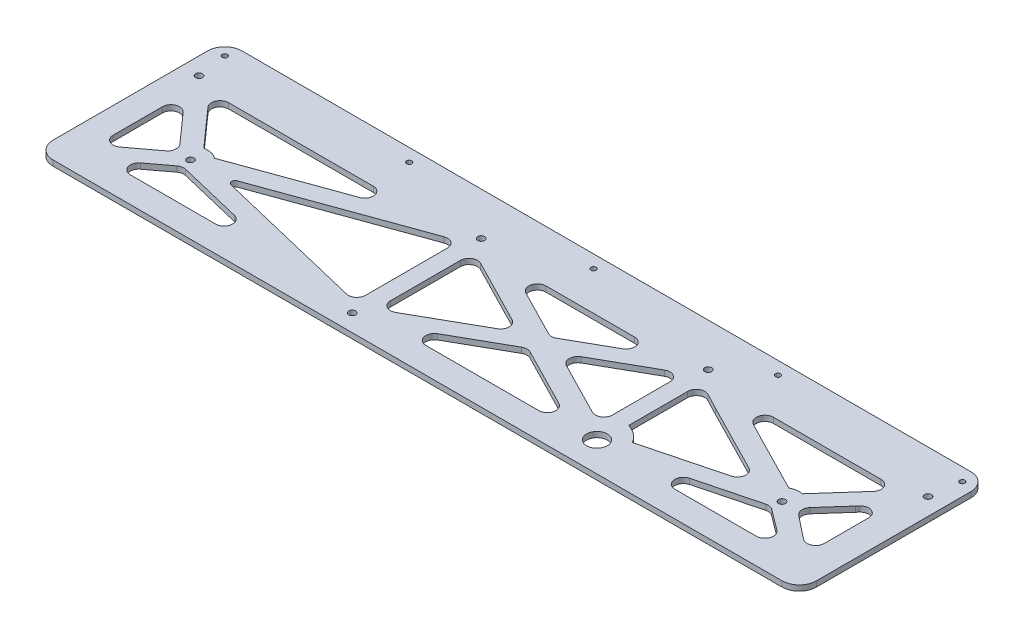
ISO-10303-21;
HEADER;
FILE_DESCRIPTION(('STEP AP214'),'2;1');
FILE_NAME('part.step','',(''),(''),'','','');
FILE_SCHEMA(('AUTOMOTIVE_DESIGN { 1 0 10303 214 1 1 1 1 }'));
ENDSEC;
DATA;
#1=APPLICATION_CONTEXT('core data for automotive mechanical design processes');
#2=APPLICATION_PROTOCOL_DEFINITION('international standard','automotive_design',2000,#1);
#3=PRODUCT_CONTEXT('',#1,'mechanical');
#4=PRODUCT('Part','Part','',(#3));
#5=PRODUCT_RELATED_PRODUCT_CATEGORY('part','',(#4));
#6=PRODUCT_DEFINITION_FORMATION('','',#4);
#7=PRODUCT_DEFINITION_CONTEXT('part definition',#1,'design');
#8=PRODUCT_DEFINITION('design','',#6,#7);
#9=PRODUCT_DEFINITION_SHAPE('','',#8);
#10=(LENGTH_UNIT() NAMED_UNIT(*) SI_UNIT(.MILLI.,.METRE.));
#11=(NAMED_UNIT(*) PLANE_ANGLE_UNIT() SI_UNIT($,.RADIAN.));
#12=(NAMED_UNIT(*) SI_UNIT($,.STERADIAN.) SOLID_ANGLE_UNIT());
#13=UNCERTAINTY_MEASURE_WITH_UNIT(LENGTH_MEASURE(1.E-05),#10,'distance_accuracy_value','');
#14=(GEOMETRIC_REPRESENTATION_CONTEXT(3) GLOBAL_UNCERTAINTY_ASSIGNED_CONTEXT((#13)) GLOBAL_UNIT_ASSIGNED_CONTEXT((#10,
#11,#12)) REPRESENTATION_CONTEXT('',''));
#15=CARTESIAN_POINT('',(0.,0.,0.));
#16=DIRECTION('',(0.,0.,1.));
#17=DIRECTION('',(1.,0.,0.));
#18=AXIS2_PLACEMENT_3D('',#15,#16,#17);
#19=CARTESIAN_POINT('',(0.,3.175,0.));
#20=DIRECTION('',(0.,1.,0.));
#21=DIRECTION('',(0.,0.,1.));
#22=AXIS2_PLACEMENT_3D('',#19,#20,#21);
#23=PLANE('',#22);
#24=DIRECTION('',(-0.885862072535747,0.,-0.463948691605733));
#25=VECTOR('',#24,1.);
#26=CARTESIAN_POINT('',(92.656526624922,3.175,-176.918060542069));
#27=LINE('',#26,#25);
#28=CARTESIAN_POINT('',(301.204849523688,3.175,-67.6959541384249));
#29=VERTEX_POINT('',#28);
#30=CARTESIAN_POINT('',(292.020165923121,3.175,-72.5062085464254));
#31=VERTEX_POINT('',#30);
#32=EDGE_CURVE('E1323',#29,#31,#27,.T.);
#33=ORIENTED_EDGE('',*,*,#32,.F.);
#34=DIRECTION('',(0.89034355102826,0.,0.455289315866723));
#35=VECTOR('',#34,1.);
#36=CARTESIAN_POINT('',(89.8777560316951,3.175,-175.760945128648));
#37=LINE('',#36,#35);
#38=CARTESIAN_POINT('',(341.082359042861,3.175,-47.3040458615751));
#39=VERTEX_POINT('',#38);
#40=EDGE_CURVE('E1292',#29,#39,#37,.T.);
#41=ORIENTED_EDGE('',*,*,#40,.T.);
#42=CARTESIAN_POINT('',(338.805912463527,3.175,-42.8523281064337));
#43=DIRECTION('',(0.,1.,0.));
#44=DIRECTION('',(0.,0.,1.));
#45=AXIS2_PLACEMENT_3D('',#42,#43,#44);
#46=CIRCLE('',#45,5.00000000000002);
#47=CARTESIAN_POINT('',(340.05850818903,3.175,-38.0117698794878));
#48=VERTEX_POINT('',#47);
#49=EDGE_CURVE('E1308',#39,#48,#46,.F.);
#50=ORIENTED_EDGE('',*,*,#49,.T.);
#51=DIRECTION('',(-0.968111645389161,0.,0.250519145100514));
#52=VECTOR('',#51,1.);
#53=CARTESIAN_POINT('',(12.1230046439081,3.175,46.8484034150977));
#54=LINE('',#53,#52);
#55=CARTESIAN_POINT('',(294.408739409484,3.175,-26.1989370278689));
#56=VERTEX_POINT('',#55);
#57=EDGE_CURVE('E1311',#48,#56,#54,.T.);
#58=ORIENTED_EDGE('',*,*,#57,.T.);
#59=CARTESIAN_POINT('',(279.700422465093,3.175,-17.2281586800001));
#60=DIRECTION('',(0.,1.,0.));
#61=DIRECTION('',(0.,0.,1.));
#62=AXIS2_PLACEMENT_3D('',#59,#60,#61);
#63=CIRCLE('',#62,17.22815868);
#64=CARTESIAN_POINT('',(284.700422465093,3.175,-33.7148033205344));
#65=VERTEX_POINT('',#64);
#66=EDGE_CURVE('E1314',#56,#65,#63,.T.);
#67=ORIENTED_EDGE('',*,*,#66,.T.);
#68=DIRECTION('',(0.,0.,1.));
#69=VECTOR('',#68,1.);
#70=CARTESIAN_POINT('',(284.700422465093,3.175,0.));
#71=LINE('',#70,#69);
#72=CARTESIAN_POINT('',(284.700422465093,3.175,-68.0768981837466));
#73=VERTEX_POINT('',#72);
#74=EDGE_CURVE('E1317',#73,#65,#71,.T.);
#75=ORIENTED_EDGE('',*,*,#74,.F.);
#76=CARTESIAN_POINT('',(289.700422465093,3.175,-68.0768981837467));
#77=DIRECTION('',(0.,1.,0.));
#78=DIRECTION('',(0.,0.,1.));
#79=AXIS2_PLACEMENT_3D('',#76,#77,#78);
#80=CIRCLE('',#79,4.99999999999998);
#81=EDGE_CURVE('E1320',#31,#73,#80,.T.);
#82=ORIENTED_EDGE('',*,*,#81,.F.);
#83=EDGE_LOOP('',(#33,#41,#50,#58,#67,#75,#82));
#84=FACE_BOUND('',#83,.T.);
#85=DIRECTION('',(1.,0.,0.));
#86=VECTOR('',#85,1.);
#87=CARTESIAN_POINT('',(0.,3.175,-15.));
#88=LINE('',#87,#86);
#89=CARTESIAN_POINT('',(13.2004224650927,3.175,-15.));
#90=VERTEX_POINT('',#89);
#91=CARTESIAN_POINT('',(62.8147738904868,3.175,-15.));
#92=VERTEX_POINT('',#91);
#93=EDGE_CURVE('E1499',#90,#92,#88,.T.);
#94=ORIENTED_EDGE('',*,*,#93,.F.);
#95=CARTESIAN_POINT('',(13.2004224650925,3.175,-20.));
#96=DIRECTION('',(0.,1.,0.));
#97=DIRECTION('',(0.,0.,1.));
#98=AXIS2_PLACEMENT_3D('',#95,#96,#97);
#99=CIRCLE('',#98,5.);
#100=CARTESIAN_POINT('',(10.2004224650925,3.175,-24.));
#101=VERTEX_POINT('',#100);
#102=EDGE_CURVE('E1475',#90,#101,#99,.F.);
#103=ORIENTED_EDGE('',*,*,#102,.T.);
#104=DIRECTION('',(0.799999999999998,0.,-0.600000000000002));
#105=VECTOR('',#104,1.);
#106=CARTESIAN_POINT('',(-7.84784791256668,3.175,-10.4637972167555));
#107=LINE('',#106,#105);
#108=CARTESIAN_POINT('',(22.2830651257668,3.175,-33.0619819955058));
#109=VERTEX_POINT('',#108);
#110=EDGE_CURVE('E1487',#101,#109,#107,.T.);
#111=ORIENTED_EDGE('',*,*,#110,.T.);
#112=CARTESIAN_POINT('',(25.2830651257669,3.175,-29.0619819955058));
#113=DIRECTION('',(0.,1.,0.));
#114=DIRECTION('',(0.,0.,1.));
#115=AXIS2_PLACEMENT_3D('',#112,#113,#114);
#116=CIRCLE('',#115,5.);
#117=CARTESIAN_POINT('',(26.4565864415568,3.175,-33.9223161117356));
#118=VERTEX_POINT('',#117);
#119=EDGE_CURVE('E1490',#118,#109,#116,.T.);
#120=ORIENTED_EDGE('',*,*,#119,.F.);
#121=DIRECTION('',(-0.972066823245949,0.,-0.234704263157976));
#122=VECTOR('',#121,1.);
#123=CARTESIAN_POINT('',(9.19670622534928,3.175,-38.0896916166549));
#124=LINE('',#123,#122);
#125=CARTESIAN_POINT('',(63.9882952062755,3.175,-24.86033411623));
#126=VERTEX_POINT('',#125);
#127=EDGE_CURVE('E1493',#126,#118,#124,.T.);
#128=ORIENTED_EDGE('',*,*,#127,.F.);
#129=CARTESIAN_POINT('',(62.8147738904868,3.175,-20.));
#130=DIRECTION('',(0.,1.,0.));
#131=DIRECTION('',(0.,0.,1.));
#132=AXIS2_PLACEMENT_3D('',#129,#130,#131);
#133=CIRCLE('',#132,5.);
#134=EDGE_CURVE('E1496',#92,#126,#133,.T.);
#135=ORIENTED_EDGE('',*,*,#134,.F.);
#136=EDGE_LOOP('',(#94,#103,#111,#120,#128,#135));
#137=FACE_BOUND('',#136,.T.);
#138=DIRECTION('',(-0.889950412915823,0.,-0.456057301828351));
#139=VECTOR('',#138,1.);
#140=CARTESIAN_POINT('',(62.6045073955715,3.175,-122.166462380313));
#141=LINE('',#140,#139);
#142=CARTESIAN_POINT('',(197.48624406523,3.175,-53.0459810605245));
#143=VERTEX_POINT('',#142);
#144=CARTESIAN_POINT('',(159.730708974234,3.175,-72.3938988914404));
#145=VERTEX_POINT('',#144);
#146=EDGE_CURVE('E1425',#143,#145,#141,.T.);
#147=ORIENTED_EDGE('',*,*,#146,.F.);
#148=CARTESIAN_POINT('',(195.205957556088,3.175,-48.5962289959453));
#149=DIRECTION('',(0.,1.,0.));
#150=DIRECTION('',(0.,0.,1.));
#151=AXIS2_PLACEMENT_3D('',#148,#149,#150);
#152=CIRCLE('',#151,5.);
#153=CARTESIAN_POINT('',(197.668168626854,3.175,-44.2445032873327));
#154=VERTEX_POINT('',#153);
#155=EDGE_CURVE('E1447',#154,#143,#152,.T.);
#156=ORIENTED_EDGE('',*,*,#155,.F.);
#157=DIRECTION('',(-0.870345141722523,0.,0.492442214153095));
#158=VECTOR('',#157,1.);
#159=CARTESIAN_POINT('',(28.9714401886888,3.175,51.2042864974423));
#160=LINE('',#159,#158);
#161=CARTESIAN_POINT('',(159.912633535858,3.175,-22.8823810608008));
#162=VERTEX_POINT('',#161);
#163=EDGE_CURVE('E1459',#154,#162,#160,.T.);
#164=ORIENTED_EDGE('',*,*,#163,.T.);
#165=CARTESIAN_POINT('',(157.450422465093,3.175,-27.2341067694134));
#166=DIRECTION('',(0.,1.,0.));
#167=DIRECTION('',(0.,0.,1.));
#168=AXIS2_PLACEMENT_3D('',#165,#166,#167);
#169=CIRCLE('',#168,5.);
#170=CARTESIAN_POINT('',(152.450422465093,3.175,-27.2341067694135));
#171=VERTEX_POINT('',#170);
#172=EDGE_CURVE('E1462',#162,#171,#169,.F.);
#173=ORIENTED_EDGE('',*,*,#172,.T.);
#174=DIRECTION('',(0.,0.,-1.));
#175=VECTOR('',#174,1.);
#176=CARTESIAN_POINT('',(152.450422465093,3.175,0.));
#177=LINE('',#176,#175);
#178=CARTESIAN_POINT('',(152.450422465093,3.175,-67.9441468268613));
#179=VERTEX_POINT('',#178);
#180=EDGE_CURVE('E1465',#171,#179,#177,.T.);
#181=ORIENTED_EDGE('',*,*,#180,.T.);
#182=CARTESIAN_POINT('',(157.450422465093,3.175,-67.9441468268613));
#183=DIRECTION('',(0.,1.,0.));
#184=DIRECTION('',(0.,0.,1.));
#185=AXIS2_PLACEMENT_3D('',#182,#183,#184);
#186=CIRCLE('',#185,5.);
#187=EDGE_CURVE('E1468',#145,#179,#186,.T.);
#188=ORIENTED_EDGE('',*,*,#187,.F.);
#189=EDGE_LOOP('',(#147,#156,#164,#173,#181,#188));
#190=FACE_BOUND('',#189,.T.);
#191=CARTESIAN_POINT('',(377.700422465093,3.175,-20.));
#192=DIRECTION('',(0.,1.,0.));
#193=DIRECTION('',(0.,0.,1.));
#194=AXIS2_PLACEMENT_3D('',#191,#192,#193);
#195=CIRCLE('',#194,4.99999999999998);
#196=CARTESIAN_POINT('',(377.700422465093,3.175,-15.));
#197=VERTEX_POINT('',#196);
#198=CARTESIAN_POINT('',(380.700422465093,3.175,-24.));
#199=VERTEX_POINT('',#198);
#200=EDGE_CURVE('E1199',#197,#199,#195,.T.);
#201=ORIENTED_EDGE('',*,*,#200,.F.);
#202=DIRECTION('',(1.,0.,0.));
#203=VECTOR('',#202,1.);
#204=CARTESIAN_POINT('',(0.,3.175,-14.9999999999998));
#205=LINE('',#204,#203);
#206=CARTESIAN_POINT('',(330.329095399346,3.175,-15.));
#207=VERTEX_POINT('',#206);
#208=EDGE_CURVE('E1208',#207,#197,#205,.T.);
#209=ORIENTED_EDGE('',*,*,#208,.F.);
#210=CARTESIAN_POINT('',(330.329095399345,3.175,-20.));
#211=DIRECTION('',(0.,1.,0.));
#212=DIRECTION('',(0.,0.,1.));
#213=AXIS2_PLACEMENT_3D('',#210,#211,#212);
#214=CIRCLE('',#213,5.);
#215=CARTESIAN_POINT('',(329.076499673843,3.175,-24.8405582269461));
#216=VERTEX_POINT('',#215);
#217=EDGE_CURVE('E1177',#216,#207,#214,.T.);
#218=ORIENTED_EDGE('',*,*,#217,.F.);
#219=DIRECTION('',(0.968111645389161,0.,-0.250519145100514));
#220=VECTOR('',#219,1.);
#221=CARTESIAN_POINT('',(329.076499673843,3.175,-24.8405582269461));
#222=LINE('',#221,#220);
#223=CARTESIAN_POINT('',(364.296086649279,3.175,-33.9543632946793));
#224=VERTEX_POINT('',#223);
#225=EDGE_CURVE('E1170',#216,#224,#222,.T.);
#226=ORIENTED_EDGE('',*,*,#225,.T.);
#227=CARTESIAN_POINT('',(365.548682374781,3.175,-29.1138050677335));
#228=DIRECTION('',(0.,1.,0.));
#229=DIRECTION('',(0.,0.,1.));
#230=AXIS2_PLACEMENT_3D('',#227,#228,#229);
#231=CIRCLE('',#230,4.99999999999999);
#232=CARTESIAN_POINT('',(368.548682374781,3.175,-33.1138050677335));
#233=VERTEX_POINT('',#232);
#234=EDGE_CURVE('E1181',#233,#224,#231,.T.);
#235=ORIENTED_EDGE('',*,*,#234,.F.);
#236=DIRECTION('',(-0.800000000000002,0.,-0.599999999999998));
#237=VECTOR('',#236,1.);
#238=CARTESIAN_POINT('',(380.700422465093,3.175,-24.));
#239=LINE('',#238,#237);
#240=EDGE_CURVE('E1186',#199,#233,#239,.T.);
#241=ORIENTED_EDGE('',*,*,#240,.F.);
#242=EDGE_LOOP('',(#201,#209,#218,#226,#235,#241));
#243=FACE_BOUND('',#242,.T.);
#244=CARTESIAN_POINT('',(23.2004224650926,3.175,-40.));
#245=DIRECTION('',(0.,1.,0.));
#246=DIRECTION('',(0.,0.,1.));
#247=AXIS2_PLACEMENT_3D('',#244,#245,#246);
#248=CIRCLE('',#247,2.);
#249=CARTESIAN_POINT('',(23.2004224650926,3.175,-38.));
#250=VERTEX_POINT('',#249);
#251=EDGE_CURVE('E1577',#250,#250,#248,.T.);
#252=ORIENTED_EDGE('',*,*,#251,.F.);
#253=EDGE_LOOP('',(#252));
#254=FACE_BOUND('',#253,.T.);
#255=CARTESIAN_POINT('',(147.450422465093,3.175,-85.));
#256=DIRECTION('',(0.,1.,0.));
#257=DIRECTION('',(0.,0.,1.));
#258=AXIS2_PLACEMENT_3D('',#255,#256,#257);
#259=CIRCLE('',#258,2.);
#260=CARTESIAN_POINT('',(147.450422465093,3.175,-83.));
#261=VERTEX_POINT('',#260);
#262=EDGE_CURVE('E1580',#261,#261,#259,.T.);
#263=ORIENTED_EDGE('',*,*,#262,.F.);
#264=EDGE_LOOP('',(#263));
#265=FACE_BOUND('',#264,.T.);
#266=CARTESIAN_POINT('',(279.700422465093,3.175,-85.));
#267=DIRECTION('',(0.,1.,0.));
#268=DIRECTION('',(0.,0.,1.));
#269=AXIS2_PLACEMENT_3D('',#266,#267,#268);
#270=CIRCLE('',#269,2.);
#271=CARTESIAN_POINT('',(279.700422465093,3.175,-83.));
#272=VERTEX_POINT('',#271);
#273=EDGE_CURVE('E1584',#272,#272,#270,.T.);
#274=ORIENTED_EDGE('',*,*,#273,.F.);
#275=EDGE_LOOP('',(#274));
#276=FACE_BOUND('',#275,.T.);
#277=DIRECTION('',(0.,0.,-1.));
#278=VECTOR('',#277,1.);
#279=CARTESIAN_POINT('',(417.700422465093,3.175,0.));
#280=LINE('',#279,#278);
#281=CARTESIAN_POINT('',(417.700422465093,3.175,-10.));
#282=VERTEX_POINT('',#281);
#283=CARTESIAN_POINT('',(417.700422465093,3.175,-100.));
#284=VERTEX_POINT('',#283);
#285=EDGE_CURVE('E1593',#282,#284,#280,.T.);
#286=ORIENTED_EDGE('',*,*,#285,.T.);
#287=CARTESIAN_POINT('',(407.700422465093,3.175,-100.));
#288=DIRECTION('',(0.,1.,0.));
#289=DIRECTION('',(0.,0.,1.));
#290=AXIS2_PLACEMENT_3D('',#287,#288,#289);
#291=CIRCLE('',#290,10.);
#292=CARTESIAN_POINT('',(407.700422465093,3.175,-110.));
#293=VERTEX_POINT('',#292);
#294=EDGE_CURVE('E1702',#284,#293,#291,.T.);
#295=ORIENTED_EDGE('',*,*,#294,.T.);
#296=DIRECTION('',(1.,0.,0.));
#297=VECTOR('',#296,1.);
#298=CARTESIAN_POINT('',(0.,3.175,-110.));
#299=LINE('',#298,#297);
#300=CARTESIAN_POINT('',(-16.7995775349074,3.175,-110.));
#301=VERTEX_POINT('',#300);
#302=EDGE_CURVE('E1596',#301,#293,#299,.T.);
#303=ORIENTED_EDGE('',*,*,#302,.F.);
#304=CARTESIAN_POINT('',(-16.7995775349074,3.175,-100.));
#305=DIRECTION('',(0.,1.,0.));
#306=DIRECTION('',(0.,0.,1.));
#307=AXIS2_PLACEMENT_3D('',#304,#305,#306);
#308=CIRCLE('',#307,10.);
#309=CARTESIAN_POINT('',(-26.7995775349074,3.175,-100.));
#310=VERTEX_POINT('',#309);
#311=EDGE_CURVE('E1696',#301,#310,#308,.T.);
#312=ORIENTED_EDGE('',*,*,#311,.T.);
#313=DIRECTION('',(0.,0.,-1.));
#314=VECTOR('',#313,1.);
#315=CARTESIAN_POINT('',(-26.7995775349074,3.175,0.));
#316=LINE('',#315,#314);
#317=CARTESIAN_POINT('',(-26.7995775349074,3.175,-10.));
#318=VERTEX_POINT('',#317);
#319=EDGE_CURVE('E1587',#318,#310,#316,.T.);
#320=ORIENTED_EDGE('',*,*,#319,.F.);
#321=CARTESIAN_POINT('',(-16.7995775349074,3.175,-10.));
#322=DIRECTION('',(0.,1.,0.));
#323=DIRECTION('',(0.,0.,1.));
#324=AXIS2_PLACEMENT_3D('',#321,#322,#323);
#325=CIRCLE('',#324,10.);
#326=CARTESIAN_POINT('',(-16.7995775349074,3.175,0.));
#327=VERTEX_POINT('',#326);
#328=EDGE_CURVE('E1698',#318,#327,#325,.T.);
#329=ORIENTED_EDGE('',*,*,#328,.T.);
#330=DIRECTION('',(1.,0.,0.));
#331=VECTOR('',#330,1.);
#332=CARTESIAN_POINT('',(0.,3.175,0.));
#333=LINE('',#332,#331);
#334=CARTESIAN_POINT('',(407.700422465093,3.175,0.));
#335=VERTEX_POINT('',#334);
#336=EDGE_CURVE('E1590',#327,#335,#333,.T.);
#337=ORIENTED_EDGE('',*,*,#336,.T.);
#338=CARTESIAN_POINT('',(407.700422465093,3.175,-10.));
#339=DIRECTION('',(0.,1.,0.));
#340=DIRECTION('',(0.,0.,1.));
#341=AXIS2_PLACEMENT_3D('',#338,#339,#340);
#342=CIRCLE('',#341,10.);
#343=EDGE_CURVE('E1700',#335,#282,#342,.T.);
#344=ORIENTED_EDGE('',*,*,#343,.T.);
#345=EDGE_LOOP('',(#286,#295,#303,#312,#320,#329,#337,#344));
#346=FACE_BOUND('',#345,.T.);
#347=CARTESIAN_POINT('',(-16.7995775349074,3.175,-85.));
#348=DIRECTION('',(0.,1.,0.));
#349=DIRECTION('',(0.,0.,1.));
#350=AXIS2_PLACEMENT_3D('',#347,#348,#349);
#351=CIRCLE('',#350,2.);
#352=CARTESIAN_POINT('',(-16.7995775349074,3.175,-83.));
#353=VERTEX_POINT('',#352);
#354=EDGE_CURVE('E1599',#353,#353,#351,.T.);
#355=ORIENTED_EDGE('',*,*,#354,.F.);
#356=EDGE_LOOP('',(#355));
#357=FACE_BOUND('',#356,.T.);
#358=CARTESIAN_POINT('',(407.700422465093,3.175,-85.));
#359=DIRECTION('',(0.,1.,0.));
#360=DIRECTION('',(0.,0.,1.));
#361=AXIS2_PLACEMENT_3D('',#358,#359,#360);
#362=CIRCLE('',#361,2.);
#363=CARTESIAN_POINT('',(407.700422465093,3.175,-83.));
#364=VERTEX_POINT('',#363);
#365=EDGE_CURVE('E1602',#364,#364,#362,.T.);
#366=ORIENTED_EDGE('',*,*,#365,.F.);
#367=EDGE_LOOP('',(#366));
#368=FACE_BOUND('',#367,.T.);
#369=CARTESIAN_POINT('',(195.450422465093,3.175,-102.5));
#370=DIRECTION('',(0.,1.,0.));
#371=DIRECTION('',(0.,0.,1.));
#372=AXIS2_PLACEMENT_3D('',#369,#370,#371);
#373=CIRCLE('',#372,1.5);
#374=CARTESIAN_POINT('',(195.450422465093,3.175,-101.));
#375=VERTEX_POINT('',#374);
#376=EDGE_CURVE('E1605',#375,#375,#373,.T.);
#377=ORIENTED_EDGE('',*,*,#376,.F.);
#378=EDGE_LOOP('',(#377));
#379=FACE_BOUND('',#378,.T.);
#380=CARTESIAN_POINT('',(302.825422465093,3.175,-102.5));
#381=DIRECTION('',(0.,1.,0.));
#382=DIRECTION('',(0.,0.,1.));
#383=AXIS2_PLACEMENT_3D('',#380,#381,#382);
#384=CIRCLE('',#383,1.50000000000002);
#385=CARTESIAN_POINT('',(302.825422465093,3.175,-101.));
#386=VERTEX_POINT('',#385);
#387=EDGE_CURVE('E1608',#386,#386,#384,.T.);
#388=ORIENTED_EDGE('',*,*,#387,.F.);
#389=EDGE_LOOP('',(#388));
#390=FACE_BOUND('',#389,.T.);
#391=CARTESIAN_POINT('',(410.200422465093,3.175,-102.5));
#392=DIRECTION('',(0.,1.,0.));
#393=DIRECTION('',(0.,0.,1.));
#394=AXIS2_PLACEMENT_3D('',#391,#392,#393);
#395=CIRCLE('',#394,1.50000000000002);
#396=CARTESIAN_POINT('',(410.200422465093,3.175,-101.));
#397=VERTEX_POINT('',#396);
#398=EDGE_CURVE('E1611',#397,#397,#395,.T.);
#399=ORIENTED_EDGE('',*,*,#398,.F.);
#400=EDGE_LOOP('',(#399));
#401=FACE_BOUND('',#400,.T.);
#402=CARTESIAN_POINT('',(367.700422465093,3.175,-40.));
#403=DIRECTION('',(0.,1.,0.));
#404=DIRECTION('',(0.,0.,1.));
#405=AXIS2_PLACEMENT_3D('',#402,#403,#404);
#406=CIRCLE('',#405,2.);
#407=CARTESIAN_POINT('',(367.700422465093,3.175,-38.));
#408=VERTEX_POINT('',#407);
#409=EDGE_CURVE('E1614',#408,#408,#406,.T.);
#410=ORIENTED_EDGE('',*,*,#409,.F.);
#411=EDGE_LOOP('',(#410));
#412=FACE_BOUND('',#411,.T.);
#413=CARTESIAN_POINT('',(-19.2995775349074,3.175,-102.5));
#414=DIRECTION('',(0.,1.,0.));
#415=DIRECTION('',(0.,0.,1.));
#416=AXIS2_PLACEMENT_3D('',#413,#414,#415);
#417=CIRCLE('',#416,1.5);
#418=CARTESIAN_POINT('',(-19.2995775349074,3.175,-101.));
#419=VERTEX_POINT('',#418);
#420=EDGE_CURVE('E1617',#419,#419,#417,.T.);
#421=ORIENTED_EDGE('',*,*,#420,.F.);
#422=EDGE_LOOP('',(#421));
#423=FACE_BOUND('',#422,.T.);
#424=CARTESIAN_POINT('',(88.0754224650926,3.175,-102.5));
#425=DIRECTION('',(0.,1.,0.));
#426=DIRECTION('',(0.,0.,1.));
#427=AXIS2_PLACEMENT_3D('',#424,#425,#426);
#428=CIRCLE('',#427,1.5);
#429=CARTESIAN_POINT('',(88.0754224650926,3.175,-101.));
#430=VERTEX_POINT('',#429);
#431=EDGE_CURVE('E1620',#430,#430,#428,.T.);
#432=ORIENTED_EDGE('',*,*,#431,.F.);
#433=EDGE_LOOP('',(#432));
#434=FACE_BOUND('',#433,.T.);
#435=CARTESIAN_POINT('',(282.700422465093,3.175,-17.2281586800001));
#436=DIRECTION('',(0.,1.,0.));
#437=DIRECTION('',(0.,0.,1.));
#438=AXIS2_PLACEMENT_3D('',#435,#436,#437);
#439=CIRCLE('',#438,5.99999999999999);
#440=CARTESIAN_POINT('',(282.700422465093,3.175,-11.2281586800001));
#441=VERTEX_POINT('',#440);
#442=EDGE_CURVE('E1623',#441,#441,#439,.T.);
#443=ORIENTED_EDGE('',*,*,#442,.F.);
#444=EDGE_LOOP('',(#443));
#445=FACE_BOUND('',#444,.T.);
#446=CARTESIAN_POINT('',(147.450422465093,3.175,-10.));
#447=DIRECTION('',(0.,1.,0.));
#448=DIRECTION('',(0.,0.,1.));
#449=AXIS2_PLACEMENT_3D('',#446,#447,#448);
#450=CIRCLE('',#449,2.);
#451=CARTESIAN_POINT('',(147.450422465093,3.175,-8.00000000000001));
#452=VERTEX_POINT('',#451);
#453=EDGE_CURVE('E1626',#452,#452,#450,.T.);
#454=ORIENTED_EDGE('',*,*,#453,.F.);
#455=EDGE_LOOP('',(#454));
#456=FACE_BOUND('',#455,.T.);
#457=DIRECTION('',(-0.940234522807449,0.,0.340527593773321));
#458=VECTOR('',#457,1.);
#459=CARTESIAN_POINT('',(-11.9275984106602,3.175,-32.9334245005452));
#460=LINE('',#459,#458);
#461=CARTESIAN_POINT('',(83.5145572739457,3.175,-67.5));
#462=VERTEX_POINT('',#461);
#463=CARTESIAN_POINT('',(29.3522261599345,3.175,-47.8838639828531));
#464=VERTEX_POINT('',#463);
#465=EDGE_CURVE('E1543',#462,#464,#460,.T.);
#466=ORIENTED_EDGE('',*,*,#465,.T.);
#467=CARTESIAN_POINT('',(23.2004224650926,3.175,-40.));
#468=DIRECTION('',(0.,1.,0.));
#469=DIRECTION('',(0.,0.,1.));
#470=AXIS2_PLACEMENT_3D('',#467,#468,#469);
#471=CIRCLE('',#470,10.);
#472=CARTESIAN_POINT('',(21.1839094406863,3.175,-49.7945737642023));
#473=VERTEX_POINT('',#472);
#474=EDGE_CURVE('E1540',#464,#473,#471,.T.);
#475=ORIENTED_EDGE('',*,*,#474,.T.);
#476=DIRECTION('',(-0.66436383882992,0.,-0.747409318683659));
#477=VECTOR('',#476,1.);
#478=CARTESIAN_POINT('',(36.5593515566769,3.175,-32.4972013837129));
#479=LINE('',#478,#477);
#480=CARTESIAN_POINT('',(1.73181429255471,3.175,-71.6781808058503));
#481=VERTEX_POINT('',#480);
#482=EDGE_CURVE('E1558',#473,#481,#479,.T.);
#483=ORIENTED_EDGE('',*,*,#482,.T.);
#484=CARTESIAN_POINT('',(5.46886088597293,3.175,-75.));
#485=DIRECTION('',(0.,1.,0.));
#486=DIRECTION('',(0.,0.,1.));
#487=AXIS2_PLACEMENT_3D('',#484,#485,#486);
#488=CIRCLE('',#487,5.);
#489=CARTESIAN_POINT('',(5.46886088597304,3.175,-80.));
#490=VERTEX_POINT('',#489);
#491=EDGE_CURVE('E1555',#490,#481,#488,.T.);
#492=ORIENTED_EDGE('',*,*,#491,.F.);
#493=DIRECTION('',(1.,0.,0.));
#494=VECTOR('',#493,1.);
#495=CARTESIAN_POINT('',(0.,3.175,-80.));
#496=LINE('',#495,#494);
#497=CARTESIAN_POINT('',(89.6869889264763,3.175,-80.));
#498=VERTEX_POINT('',#497);
#499=EDGE_CURVE('E1552',#490,#498,#496,.T.);
#500=ORIENTED_EDGE('',*,*,#499,.T.);
#501=CARTESIAN_POINT('',(89.6869889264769,3.175,-75.));
#502=DIRECTION('',(0.,1.,0.));
#503=DIRECTION('',(0.,0.,1.));
#504=AXIS2_PLACEMENT_3D('',#501,#502,#503);
#505=CIRCLE('',#504,5.);
#506=CARTESIAN_POINT('',(91.3613504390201,3.175,-70.2886824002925));
#507=VERTEX_POINT('',#506);
#508=EDGE_CURVE('E1549',#498,#507,#505,.F.);
#509=ORIENTED_EDGE('',*,*,#508,.T.);
#510=DIRECTION('',(0.94226351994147,0.,-0.33487230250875));
#511=VECTOR('',#510,1.);
#512=CARTESIAN_POINT('',(-11.9335346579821,3.175,-33.5785739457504));
#513=LINE('',#512,#511);
#514=EDGE_CURVE('E1546',#462,#507,#513,.T.);
#515=ORIENTED_EDGE('',*,*,#514,.F.);
#516=EDGE_LOOP('',(#466,#475,#483,#492,#500,#509,#515));
#517=FACE_BOUND('',#516,.T.);
#518=DIRECTION('',(0.,0.,-1.));
#519=VECTOR('',#518,1.);
#520=CARTESIAN_POINT('',(401.166651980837,3.175,0.));
#521=LINE('',#520,#519);
#522=CARTESIAN_POINT('',(401.166651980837,3.175,-31.1503278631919));
#523=VERTEX_POINT('',#522);
#524=CARTESIAN_POINT('',(401.166651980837,3.175,-57.0126783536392));
#525=VERTEX_POINT('',#524);
#526=EDGE_CURVE('E1246',#523,#525,#521,.T.);
#527=ORIENTED_EDGE('',*,*,#526,.F.);
#528=CARTESIAN_POINT('',(396.166651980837,3.175,-31.1503278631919));
#529=DIRECTION('',(0.,1.,0.));
#530=DIRECTION('',(0.,0.,1.));
#531=AXIS2_PLACEMENT_3D('',#528,#529,#530);
#532=CIRCLE('',#531,5.00000000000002);
#533=CARTESIAN_POINT('',(393.166651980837,3.175,-27.1503278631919));
#534=VERTEX_POINT('',#533);
#535=EDGE_CURVE('E1249',#523,#534,#532,.F.);
#536=ORIENTED_EDGE('',*,*,#535,.T.);
#537=DIRECTION('',(0.800000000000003,0.,0.599999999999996));
#538=VECTOR('',#537,1.);
#539=CARTESIAN_POINT('',(154.572152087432,3.175,-206.096202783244));
#540=LINE('',#539,#538);
#541=CARTESIAN_POINT('',(390.700422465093,3.175,-29.));
#542=VERTEX_POINT('',#541);
#543=EDGE_CURVE('E1215',#542,#534,#540,.T.);
#544=ORIENTED_EDGE('',*,*,#543,.F.);
#545=DIRECTION('',(-0.781718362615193,0.,-0.623631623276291));
#546=VECTOR('',#545,1.);
#547=CARTESIAN_POINT('',(166.08742684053,3.175,-208.189556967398));
#548=LINE('',#547,#546);
#549=CARTESIAN_POINT('',(379.55902724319,3.175,-37.8882732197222));
#550=VERTEX_POINT('',#549);
#551=EDGE_CURVE('E1231',#542,#550,#548,.T.);
#552=ORIENTED_EDGE('',*,*,#551,.T.);
#553=CARTESIAN_POINT('',(382.677185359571,3.175,-41.7968650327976));
#554=DIRECTION('',(0.,1.,0.));
#555=DIRECTION('',(0.,0.,1.));
#556=AXIS2_PLACEMENT_3D('',#553,#554,#555);
#557=CIRCLE('',#556,4.9999999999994);
#558=CARTESIAN_POINT('',(378.940138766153,3.175,-45.1186842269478));
#559=VERTEX_POINT('',#558);
#560=EDGE_CURVE('E1234',#550,#559,#557,.F.);
#561=ORIENTED_EDGE('',*,*,#560,.T.);
#562=DIRECTION('',(-0.664363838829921,0.,0.747409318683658));
#563=VECTOR('',#562,1.);
#564=CARTESIAN_POINT('',(189.280041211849,3.175,168.248925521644));
#565=LINE('',#564,#563);
#566=CARTESIAN_POINT('',(391.437469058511,3.175,-59.1781808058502));
#567=VERTEX_POINT('',#566);
#568=EDGE_CURVE('E1237',#567,#559,#565,.T.);
#569=ORIENTED_EDGE('',*,*,#568,.F.);
#570=DIRECTION('',(0.650766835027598,0.,-0.759277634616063));
#571=VECTOR('',#570,1.);
#572=CARTESIAN_POINT('',(196.423998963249,3.175,168.352415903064));
#573=LINE('',#572,#571);
#574=CARTESIAN_POINT('',(392.370263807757,3.175,-60.2665125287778));
#575=VERTEX_POINT('',#574);
#576=EDGE_CURVE('E1240',#567,#575,#573,.T.);
#577=ORIENTED_EDGE('',*,*,#576,.T.);
#578=CARTESIAN_POINT('',(396.166651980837,3.175,-57.0126783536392));
#579=DIRECTION('',(0.,1.,0.));
#580=DIRECTION('',(0.,0.,1.));
#581=AXIS2_PLACEMENT_3D('',#578,#579,#580);
#582=CIRCLE('',#581,5.00000000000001);
#583=EDGE_CURVE('E1243',#525,#575,#582,.T.);
#584=ORIENTED_EDGE('',*,*,#583,.F.);
#585=EDGE_LOOP('',(#527,#536,#544,#552,#561,#569,#577,#584));
#586=FACE_BOUND('',#585,.T.);
#587=DIRECTION('',(1.,0.,0.));
#588=VECTOR('',#587,1.);
#589=CARTESIAN_POINT('',(0.,3.175,-79.9999999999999));
#590=LINE('',#589,#588);
#591=CARTESIAN_POINT('',(322.713047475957,3.175,-80.));
#592=VERTEX_POINT('',#591);
#593=CARTESIAN_POINT('',(385.431984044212,3.175,-80.));
#594=VERTEX_POINT('',#593);
#595=EDGE_CURVE('E1282',#592,#594,#590,.T.);
#596=ORIENTED_EDGE('',*,*,#595,.T.);
#597=CARTESIAN_POINT('',(385.431984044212,3.175,-75.));
#598=DIRECTION('',(0.,1.,0.));
#599=DIRECTION('',(0.,0.,1.));
#600=AXIS2_PLACEMENT_3D('',#597,#598,#599);
#601=CIRCLE('',#600,5.);
#602=CARTESIAN_POINT('',(389.169030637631,3.175,-71.6781808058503));
#603=VERTEX_POINT('',#602);
#604=EDGE_CURVE('E1285',#594,#603,#601,.F.);
#605=ORIENTED_EDGE('',*,*,#604,.T.);
#606=DIRECTION('',(-0.664363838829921,0.,0.747409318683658));
#607=VECTOR('',#606,1.);
#608=CARTESIAN_POINT('',(181.805948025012,3.175,161.605287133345));
#609=LINE('',#608,#607);
#610=CARTESIAN_POINT('',(369.716935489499,3.175,-49.7945737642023));
#611=VERTEX_POINT('',#610);
#612=EDGE_CURVE('E1256',#603,#611,#609,.T.);
#613=ORIENTED_EDGE('',*,*,#612,.T.);
#614=CARTESIAN_POINT('',(367.700422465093,3.175,-40.));
#615=DIRECTION('',(0.,1.,0.));
#616=DIRECTION('',(0.,0.,1.));
#617=AXIS2_PLACEMENT_3D('',#614,#615,#616);
#618=CIRCLE('',#617,9.99999999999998);
#619=CARTESIAN_POINT('',(362.890344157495,3.175,-48.767162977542));
#620=VERTEX_POINT('',#619);
#621=EDGE_CURVE('E1270',#611,#620,#618,.T.);
#622=ORIENTED_EDGE('',*,*,#621,.T.);
#623=DIRECTION('',(0.890343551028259,0.,0.455289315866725));
#624=VECTOR('',#623,1.);
#625=CARTESIAN_POINT('',(94.9913923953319,3.175,-185.760945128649));
#626=LINE('',#625,#624);
#627=CARTESIAN_POINT('',(326.257240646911,3.175,-67.5));
#628=VERTEX_POINT('',#627);
#629=EDGE_CURVE('E1273',#628,#620,#626,.T.);
#630=ORIENTED_EDGE('',*,*,#629,.F.);
#631=DIRECTION('',(-0.885887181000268,0.,-0.463900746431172));
#632=VECTOR('',#631,1.);
#633=CARTESIAN_POINT('',(97.9518828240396,3.175,-187.053627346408));
#634=LINE('',#633,#632);
#635=CARTESIAN_POINT('',(320.393543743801,3.175,-70.5705640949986));
#636=VERTEX_POINT('',#635);
#637=EDGE_CURVE('E1276',#628,#636,#634,.T.);
#638=ORIENTED_EDGE('',*,*,#637,.T.);
#639=CARTESIAN_POINT('',(322.713047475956,3.175,-75.));
#640=DIRECTION('',(0.,1.,0.));
#641=DIRECTION('',(0.,0.,1.));
#642=AXIS2_PLACEMENT_3D('',#639,#640,#641);
#643=CIRCLE('',#642,5.);
#644=EDGE_CURVE('E1279',#592,#636,#643,.T.);
#645=ORIENTED_EDGE('',*,*,#644,.F.);
#646=EDGE_LOOP('',(#596,#605,#613,#622,#630,#638,#645));
#647=FACE_BOUND('',#646,.T.);
#648=DIRECTION('',(-0.972066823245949,0.,-0.234704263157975));
#649=VECTOR('',#648,1.);
#650=CARTESIAN_POINT('',(11.5774710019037,3.175,-47.9500257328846));
#651=LINE('',#650,#649);
#652=CARTESIAN_POINT('',(136.276901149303,3.175,-17.841511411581));
#653=VERTEX_POINT('',#652);
#654=CARTESIAN_POINT('',(47.554716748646,3.175,-39.2633668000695));
#655=VERTEX_POINT('',#654);
#656=EDGE_CURVE('E1437',#653,#655,#651,.T.);
#657=ORIENTED_EDGE('',*,*,#656,.T.);
#658=CARTESIAN_POINT('',(48.0241252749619,3.175,-41.2075004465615));
#659=DIRECTION('',(0.,1.,0.));
#660=DIRECTION('',(0.,0.,1.));
#661=AXIS2_PLACEMENT_3D('',#658,#659,#660);
#662=CIRCLE('',#661,2.);
#663=CARTESIAN_POINT('',(47.3430700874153,3.175,-43.0879694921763));
#664=VERTEX_POINT('',#663);
#665=EDGE_CURVE('E1440',#655,#664,#662,.F.);
#666=ORIENTED_EDGE('',*,*,#665,.T.);
#667=DIRECTION('',(0.940234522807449,0.,-0.340527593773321));
#668=VECTOR('',#667,1.);
#669=CARTESIAN_POINT('',(-8.30586802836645,3.175,-22.9334245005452));
#670=LINE('',#669,#668);
#671=CARTESIAN_POINT('',(135.747784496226,3.175,-75.1057735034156));
#672=VERTEX_POINT('',#671);
#673=EDGE_CURVE('E1414',#664,#672,#670,.T.);
#674=ORIENTED_EDGE('',*,*,#673,.T.);
#675=CARTESIAN_POINT('',(137.450422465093,3.175,-70.4046008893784));
#676=DIRECTION('',(0.,1.,0.));
#677=DIRECTION('',(0.,0.,1.));
#678=AXIS2_PLACEMENT_3D('',#675,#676,#677);
#679=CIRCLE('',#678,5.);
#680=CARTESIAN_POINT('',(142.450422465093,3.175,-70.4046008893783));
#681=VERTEX_POINT('',#680);
#682=EDGE_CURVE('E1428',#672,#681,#679,.F.);
#683=ORIENTED_EDGE('',*,*,#682,.T.);
#684=DIRECTION('',(0.,0.,1.));
#685=VECTOR('',#684,1.);
#686=CARTESIAN_POINT('',(142.450422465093,3.175,0.));
#687=LINE('',#686,#685);
#688=CARTESIAN_POINT('',(142.450422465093,3.175,-22.7018455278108));
#689=VERTEX_POINT('',#688);
#690=EDGE_CURVE('E1431',#681,#689,#687,.T.);
#691=ORIENTED_EDGE('',*,*,#690,.T.);
#692=CARTESIAN_POINT('',(137.450422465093,3.175,-22.7018455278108));
#693=DIRECTION('',(0.,1.,0.));
#694=DIRECTION('',(0.,0.,1.));
#695=AXIS2_PLACEMENT_3D('',#692,#693,#694);
#696=CIRCLE('',#695,5.);
#697=EDGE_CURVE('E1434',#689,#653,#696,.F.);
#698=ORIENTED_EDGE('',*,*,#697,.T.);
#699=EDGE_LOOP('',(#657,#666,#674,#683,#691,#698));
#700=FACE_BOUND('',#699,.T.);
#701=DIRECTION('',(-0.800000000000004,0.,0.599999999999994));
#702=VECTOR('',#701,1.);
#703=CARTESIAN_POINT('',(-13.8478479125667,3.175,-18.4637972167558));
#704=LINE('',#703,#702);
#705=CARTESIAN_POINT('',(11.506026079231,3.175,-37.4792027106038));
#706=VERTEX_POINT('',#705);
#707=CARTESIAN_POINT('',(-3.79957753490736,3.175,-26.0000000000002));
#708=VERTEX_POINT('',#707);
#709=EDGE_CURVE('E1534',#706,#708,#704,.T.);
#710=ORIENTED_EDGE('',*,*,#709,.T.);
#711=CARTESIAN_POINT('',(-6.7995775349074,3.175,-30.0000000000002));
#712=DIRECTION('',(0.,1.,0.));
#713=DIRECTION('',(0.,0.,1.));
#714=AXIS2_PLACEMENT_3D('',#711,#712,#713);
#715=CIRCLE('',#714,5.);
#716=CARTESIAN_POINT('',(-11.7995775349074,3.175,-30.0000000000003));
#717=VERTEX_POINT('',#716);
#718=EDGE_CURVE('E1537',#708,#717,#715,.F.);
#719=ORIENTED_EDGE('',*,*,#718,.T.);
#720=DIRECTION('',(0.,0.,-1.));
#721=VECTOR('',#720,1.);
#722=CARTESIAN_POINT('',(-11.7995775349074,3.175,0.));
#723=LINE('',#722,#721);
#724=CARTESIAN_POINT('',(-11.7995775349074,3.175,-58.6980067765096));
#725=VERTEX_POINT('',#724);
#726=EDGE_CURVE('E1505',#717,#725,#723,.T.);
#727=ORIENTED_EDGE('',*,*,#726,.T.);
#728=CARTESIAN_POINT('',(-6.7995775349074,3.175,-58.6980067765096));
#729=DIRECTION('',(0.,1.,0.));
#730=DIRECTION('',(0.,0.,1.));
#731=AXIS2_PLACEMENT_3D('',#728,#729,#730);
#732=CIRCLE('',#731,5.);
#733=CARTESIAN_POINT('',(-3.0625309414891,3.175,-62.0198259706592));
#734=VERTEX_POINT('',#733);
#735=EDGE_CURVE('E1521',#734,#725,#732,.T.);
#736=ORIENTED_EDGE('',*,*,#735,.F.);
#737=DIRECTION('',(0.66436383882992,0.,0.74740931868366));
#738=VECTOR('',#737,1.);
#739=CARTESIAN_POINT('',(29.0852583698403,3.175,-25.8535629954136));
#740=LINE('',#739,#738);
#741=CARTESIAN_POINT('',(12.2430726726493,3.175,-44.8010219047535));
#742=VERTEX_POINT('',#741);
#743=EDGE_CURVE('E1524',#734,#742,#740,.T.);
#744=ORIENTED_EDGE('',*,*,#743,.T.);
#745=CARTESIAN_POINT('',(8.50602607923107,3.175,-41.4792027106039));
#746=DIRECTION('',(0.,1.,0.));
#747=DIRECTION('',(0.,0.,1.));
#748=AXIS2_PLACEMENT_3D('',#745,#746,#747);
#749=CIRCLE('',#748,5.);
#750=CARTESIAN_POINT('',(13.4504909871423,3.175,-42.2223492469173));
#751=VERTEX_POINT('',#750);
#752=EDGE_CURVE('E1527',#751,#742,#749,.T.);
#753=ORIENTED_EDGE('',*,*,#752,.F.);
#754=CARTESIAN_POINT('',(23.2004224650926,3.175,-40.));
#755=DIRECTION('',(0.,1.,0.));
#756=DIRECTION('',(0.,0.,1.));
#757=AXIS2_PLACEMENT_3D('',#754,#755,#756);
#758=CIRCLE('',#757,10.);
#759=CARTESIAN_POINT('',(13.2031726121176,3.175,-39.7654890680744));
#760=VERTEX_POINT('',#759);
#761=EDGE_CURVE('E1528',#751,#760,#758,.T.);
#762=ORIENTED_EDGE('',*,*,#761,.T.);
#763=EDGE_CURVE('E1531',#706,#760,#749,.T.);
#764=ORIENTED_EDGE('',*,*,#763,.F.);
#765=EDGE_LOOP('',(#710,#719,#727,#736,#744,#753,#762,#764));
#766=FACE_BOUND('',#765,.T.);
#767=CARTESIAN_POINT('',(269.700422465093,3.175,-67.7658932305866));
#768=DIRECTION('',(0.,1.,0.));
#769=DIRECTION('',(0.,0.,1.));
#770=AXIS2_PLACEMENT_3D('',#767,#768,#769);
#771=CIRCLE('',#770,5.);
#772=CARTESIAN_POINT('',(274.700422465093,3.175,-67.7658932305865));
#773=VERTEX_POINT('',#772);
#774=CARTESIAN_POINT('',(267.238211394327,3.175,-72.1176189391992));
#775=VERTEX_POINT('',#774);
#776=EDGE_CURVE('E1350',#773,#775,#771,.T.);
#777=ORIENTED_EDGE('',*,*,#776,.F.);
#778=DIRECTION('',(0.,0.,1.));
#779=VECTOR('',#778,1.);
#780=CARTESIAN_POINT('',(274.700422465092,3.175,9.15752289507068E-13));
#781=LINE('',#780,#779);
#782=CARTESIAN_POINT('',(274.700422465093,3.175,-34.2840118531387));
#783=VERTEX_POINT('',#782);
#784=EDGE_CURVE('E1305',#773,#783,#781,.T.);
#785=ORIENTED_EDGE('',*,*,#784,.T.);
#786=CARTESIAN_POINT('',(269.700422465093,3.175,-34.2840118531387));
#787=DIRECTION('',(0.,1.,0.));
#788=DIRECTION('',(0.,0.,1.));
#789=AXIS2_PLACEMENT_3D('',#786,#787,#788);
#790=CIRCLE('',#789,5.);
#791=CARTESIAN_POINT('',(267.420135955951,3.175,-29.8342597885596));
#792=VERTEX_POINT('',#791);
#793=EDGE_CURVE('E1329',#783,#792,#790,.F.);
#794=ORIENTED_EDGE('',*,*,#793,.T.);
#795=DIRECTION('',(0.889950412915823,0.,0.456057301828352));
#796=VECTOR('',#795,1.);
#797=CARTESIAN_POINT('',(67.7290322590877,3.175,-132.166462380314));
#798=LINE('',#797,#796);
#799=CARTESIAN_POINT('',(236.368180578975,3.175,-45.7469115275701));
#800=VERTEX_POINT('',#799);
#801=EDGE_CURVE('E1341',#800,#792,#798,.T.);
#802=ORIENTED_EDGE('',*,*,#801,.F.);
#803=CARTESIAN_POINT('',(238.648467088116,3.175,-50.1966635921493));
#804=DIRECTION('',(0.,1.,0.));
#805=DIRECTION('',(0.,0.,1.));
#806=AXIS2_PLACEMENT_3D('',#803,#804,#805);
#807=CIRCLE('',#806,5.);
#808=CARTESIAN_POINT('',(236.186256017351,3.175,-54.5483893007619));
#809=VERTEX_POINT('',#808);
#810=EDGE_CURVE('E1344',#809,#800,#807,.T.);
#811=ORIENTED_EDGE('',*,*,#810,.F.);
#812=DIRECTION('',(0.870345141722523,0.,-0.492442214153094));
#813=VECTOR('',#812,1.);
#814=CARTESIAN_POINT('',(33.8958599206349,3.175,59.9077336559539));
#815=LINE('',#814,#813);
#816=EDGE_CURVE('E1347',#809,#775,#815,.T.);
#817=ORIENTED_EDGE('',*,*,#816,.T.);
#818=EDGE_LOOP('',(#777,#785,#794,#802,#811,#817));
#819=FACE_BOUND('',#818,.T.);
#820=CARTESIAN_POINT('',(251.008650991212,3.175,-20.));
#821=DIRECTION('',(0.,1.,0.));
#822=DIRECTION('',(0.,0.,1.));
#823=AXIS2_PLACEMENT_3D('',#820,#821,#822);
#824=CIRCLE('',#823,5.);
#825=CARTESIAN_POINT('',(251.008650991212,3.175,-15.));
#826=VERTEX_POINT('',#825);
#827=CARTESIAN_POINT('',(253.288937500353,3.175,-24.4497520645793));
#828=VERTEX_POINT('',#827);
#829=EDGE_CURVE('E1407',#826,#828,#824,.T.);
#830=ORIENTED_EDGE('',*,*,#829,.F.);
#831=DIRECTION('',(-1.,0.,0.));
#832=VECTOR('',#831,1.);
#833=CARTESIAN_POINT('',(0.,3.175,-14.9999999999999));
#834=LINE('',#833,#832);
#835=CARTESIAN_POINT('',(185.27828315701,3.175,-15.));
#836=VERTEX_POINT('',#835);
#837=EDGE_CURVE('E648',#826,#836,#834,.T.);
#838=ORIENTED_EDGE('',*,*,#837,.T.);
#839=CARTESIAN_POINT('',(185.278283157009,3.175,-20.));
#840=DIRECTION('',(0.,1.,0.));
#841=DIRECTION('',(0.,0.,1.));
#842=AXIS2_PLACEMENT_3D('',#839,#840,#841);
#843=CIRCLE('',#842,4.99999999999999);
#844=CARTESIAN_POINT('',(182.816096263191,3.175,-24.3517393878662));
#845=VERTEX_POINT('',#844);
#846=EDGE_CURVE('E1386',#845,#836,#843,.T.);
#847=ORIENTED_EDGE('',*,*,#846,.F.);
#848=DIRECTION('',(-0.870347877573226,0.,0.492437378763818));
#849=VECTOR('',#848,1.);
#850=CARTESIAN_POINT('',(33.8949545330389,3.175,59.9069100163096));
#851=LINE('',#850,#849);
#852=CARTESIAN_POINT('',(214.055427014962,3.175,-42.0267570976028));
#853=VERTEX_POINT('',#852);
#854=EDGE_CURVE('E1398',#853,#845,#851,.T.);
#855=ORIENTED_EDGE('',*,*,#854,.F.);
#856=CARTESIAN_POINT('',(216.517613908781,3.175,-37.6750177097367));
#857=DIRECTION('',(0.,1.,0.));
#858=DIRECTION('',(0.,0.,1.));
#859=AXIS2_PLACEMENT_3D('',#856,#857,#858);
#860=CIRCLE('',#859,5.);
#861=CARTESIAN_POINT('',(218.797900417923,3.175,-42.1247697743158));
#862=VERTEX_POINT('',#861);
#863=EDGE_CURVE('E1401',#862,#853,#860,.T.);
#864=ORIENTED_EDGE('',*,*,#863,.F.);
#865=DIRECTION('',(0.889950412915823,0.,0.456057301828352));
#866=VECTOR('',#865,1.);
#867=CARTESIAN_POINT('',(62.6045073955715,3.175,-122.166462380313));
#868=LINE('',#867,#866);
#869=EDGE_CURVE('E1404',#862,#828,#868,.T.);
#870=ORIENTED_EDGE('',*,*,#869,.T.);
#871=EDGE_LOOP('',(#830,#838,#847,#855,#864,#870));
#872=FACE_BOUND('',#871,.T.);
#873=CARTESIAN_POINT('',(190.247225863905,3.175,-75.));
#874=DIRECTION('',(0.,1.,0.));
#875=DIRECTION('',(0.,0.,1.));
#876=AXIS2_PLACEMENT_3D('',#873,#874,#875);
#877=CIRCLE('',#876,5.);
#878=CARTESIAN_POINT('',(190.247225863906,3.175,-80.));
#879=VERTEX_POINT('',#878);
#880=CARTESIAN_POINT('',(187.966939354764,3.175,-70.5502479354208));
#881=VERTEX_POINT('',#880);
#882=EDGE_CURVE('E1379',#879,#881,#877,.T.);
#883=ORIENTED_EDGE('',*,*,#882,.F.);
#884=DIRECTION('',(1.,0.,0.));
#885=VECTOR('',#884,1.);
#886=CARTESIAN_POINT('',(0.,3.175,-80.));
#887=LINE('',#886,#885);
#888=CARTESIAN_POINT('',(241.872561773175,3.175,-80.));
#889=VERTEX_POINT('',#888);
#890=EDGE_CURVE('E640',#879,#889,#887,.T.);
#891=ORIENTED_EDGE('',*,*,#890,.T.);
#892=CARTESIAN_POINT('',(241.872561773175,3.175,-75.));
#893=DIRECTION('',(0.,1.,0.));
#894=DIRECTION('',(0.,0.,1.));
#895=AXIS2_PLACEMENT_3D('',#892,#893,#894);
#896=CIRCLE('',#895,5.00000000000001);
#897=CARTESIAN_POINT('',(244.334748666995,3.175,-70.6482606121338));
#898=VERTEX_POINT('',#897);
#899=EDGE_CURVE('E1357',#889,#898,#896,.F.);
#900=ORIENTED_EDGE('',*,*,#899,.T.);
#901=DIRECTION('',(0.870347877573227,0.,-0.492437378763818));
#902=VECTOR('',#901,1.);
#903=CARTESIAN_POINT('',(28.9705831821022,3.175,51.2034355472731));
#904=LINE('',#903,#902);
#905=CARTESIAN_POINT('',(219.799043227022,3.175,-56.766112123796));
#906=VERTEX_POINT('',#905);
#907=EDGE_CURVE('E1370',#906,#898,#904,.T.);
#908=ORIENTED_EDGE('',*,*,#907,.F.);
#909=CARTESIAN_POINT('',(217.336856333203,3.175,-61.1178515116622));
#910=DIRECTION('',(0.,1.,0.));
#911=DIRECTION('',(0.,0.,1.));
#912=AXIS2_PLACEMENT_3D('',#909,#910,#911);
#913=CIRCLE('',#912,5.00000000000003);
#914=CARTESIAN_POINT('',(215.056569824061,3.175,-56.6680994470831));
#915=VERTEX_POINT('',#914);
#916=EDGE_CURVE('E1373',#906,#915,#913,.F.);
#917=ORIENTED_EDGE('',*,*,#916,.T.);
#918=DIRECTION('',(-0.889950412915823,0.,-0.456057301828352));
#919=VECTOR('',#918,1.);
#920=CARTESIAN_POINT('',(67.7290322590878,3.175,-132.166462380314));
#921=LINE('',#920,#919);
#922=EDGE_CURVE('E1376',#915,#881,#921,.T.);
#923=ORIENTED_EDGE('',*,*,#922,.T.);
#924=EDGE_LOOP('',(#883,#891,#900,#908,#917,#923));
#925=FACE_BOUND('',#924,.T.);
#926=ADVANCED_FACE('F625',(#84,#137,#190,#243,#254,#265,#276,#346,#357,#368,#379,#390,#401,#412,
#423,#434,#445,#456,#517,#586,#647,#700,#766,#819,#872,#925),#23,.T.);
#927=CARTESIAN_POINT('',(0.,0.,0.));
#928=DIRECTION('',(0.,1.,0.));
#929=DIRECTION('',(0.,0.,1.));
#930=AXIS2_PLACEMENT_3D('',#927,#928,#929);
#931=PLANE('',#930);
#932=DIRECTION('',(-1.,0.,0.));
#933=VECTOR('',#932,1.);
#934=CARTESIAN_POINT('',(0.,0.,-14.9999999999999));
#935=LINE('',#934,#933);
#936=CARTESIAN_POINT('',(251.008650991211,0.,-15.));
#937=VERTEX_POINT('',#936);
#938=CARTESIAN_POINT('',(185.27828315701,0.,-15.));
#939=VERTEX_POINT('',#938);
#940=EDGE_CURVE('E1893',#937,#939,#935,.T.);
#941=ORIENTED_EDGE('',*,*,#940,.F.);
#942=CARTESIAN_POINT('',(251.008650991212,0.,-20.));
#943=DIRECTION('',(0.,1.,0.));
#944=DIRECTION('',(0.,0.,1.));
#945=AXIS2_PLACEMENT_3D('',#942,#943,#944);
#946=CIRCLE('',#945,5.);
#947=CARTESIAN_POINT('',(253.288937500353,0.,-24.4497520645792));
#948=VERTEX_POINT('',#947);
#949=EDGE_CURVE('E1878',#937,#948,#946,.T.);
#950=ORIENTED_EDGE('',*,*,#949,.T.);
#951=DIRECTION('',(0.889950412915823,0.,0.456057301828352));
#952=VECTOR('',#951,1.);
#953=CARTESIAN_POINT('',(62.6045073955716,0.,-122.166462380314));
#954=LINE('',#953,#952);
#955=CARTESIAN_POINT('',(218.797900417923,0.,-42.1247697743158));
#956=VERTEX_POINT('',#955);
#957=EDGE_CURVE('E1881',#956,#948,#954,.T.);
#958=ORIENTED_EDGE('',*,*,#957,.F.);
#959=CARTESIAN_POINT('',(216.517613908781,0.,-37.6750177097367));
#960=DIRECTION('',(0.,1.,0.));
#961=DIRECTION('',(0.,0.,1.));
#962=AXIS2_PLACEMENT_3D('',#959,#960,#961);
#963=CIRCLE('',#962,5.);
#964=CARTESIAN_POINT('',(214.055427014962,0.,-42.0267570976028));
#965=VERTEX_POINT('',#964);
#966=EDGE_CURVE('E1884',#956,#965,#963,.T.);
#967=ORIENTED_EDGE('',*,*,#966,.T.);
#968=DIRECTION('',(-0.870347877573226,0.,0.492437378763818));
#969=VECTOR('',#968,1.);
#970=CARTESIAN_POINT('',(33.8949545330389,0.,59.9069100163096));
#971=LINE('',#970,#969);
#972=CARTESIAN_POINT('',(182.816096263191,0.,-24.3517393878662));
#973=VERTEX_POINT('',#972);
#974=EDGE_CURVE('E1887',#965,#973,#971,.T.);
#975=ORIENTED_EDGE('',*,*,#974,.T.);
#976=CARTESIAN_POINT('',(185.278283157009,0.,-20.));
#977=DIRECTION('',(0.,1.,0.));
#978=DIRECTION('',(0.,0.,1.));
#979=AXIS2_PLACEMENT_3D('',#976,#977,#978);
#980=CIRCLE('',#979,4.99999999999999);
#981=EDGE_CURVE('E1890',#973,#939,#980,.T.);
#982=ORIENTED_EDGE('',*,*,#981,.T.);
#983=EDGE_LOOP('',(#941,#950,#958,#967,#975,#982));
#984=FACE_BOUND('',#983,.T.);
#985=DIRECTION('',(0.89034355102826,0.,0.455289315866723));
#986=VECTOR('',#985,1.);
#987=CARTESIAN_POINT('',(89.8777560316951,0.,-175.760945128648));
#988=LINE('',#987,#986);
#989=CARTESIAN_POINT('',(301.204849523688,0.,-67.6959541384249));
#990=VERTEX_POINT('',#989);
#991=CARTESIAN_POINT('',(341.082359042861,0.,-47.3040458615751));
#992=VERTEX_POINT('',#991);
#993=EDGE_CURVE('E1873',#990,#992,#988,.T.);
#994=ORIENTED_EDGE('',*,*,#993,.F.);
#995=DIRECTION('',(-0.885862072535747,0.,-0.463948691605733));
#996=VECTOR('',#995,1.);
#997=CARTESIAN_POINT('',(92.656526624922,0.,-176.918060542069));
#998=LINE('',#997,#996);
#999=CARTESIAN_POINT('',(292.020165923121,0.,-72.5062085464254));
#1000=VERTEX_POINT('',#999);
#1001=EDGE_CURVE('E1875',#990,#1000,#998,.T.);
#1002=ORIENTED_EDGE('',*,*,#1001,.T.);
#1003=CARTESIAN_POINT('',(289.700422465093,0.,-68.0768981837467));
#1004=DIRECTION('',(0.,1.,0.));
#1005=DIRECTION('',(0.,0.,1.));
#1006=AXIS2_PLACEMENT_3D('',#1003,#1004,#1005);
#1007=CIRCLE('',#1006,4.99999999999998);
#1008=CARTESIAN_POINT('',(284.700422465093,0.,-68.0768981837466));
#1009=VERTEX_POINT('',#1008);
#1010=EDGE_CURVE('E1861',#1000,#1009,#1007,.T.);
#1011=ORIENTED_EDGE('',*,*,#1010,.T.);
#1012=DIRECTION('',(0.,0.,1.));
#1013=VECTOR('',#1012,1.);
#1014=CARTESIAN_POINT('',(284.700422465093,0.,0.));
#1015=LINE('',#1014,#1013);
#1016=CARTESIAN_POINT('',(284.700422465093,0.,-33.7148033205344));
#1017=VERTEX_POINT('',#1016);
#1018=EDGE_CURVE('E1864',#1009,#1017,#1015,.T.);
#1019=ORIENTED_EDGE('',*,*,#1018,.T.);
#1020=CARTESIAN_POINT('',(279.700422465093,0.,-17.2281586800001));
#1021=DIRECTION('',(0.,1.,0.));
#1022=DIRECTION('',(0.,0.,1.));
#1023=AXIS2_PLACEMENT_3D('',#1020,#1021,#1022);
#1024=CIRCLE('',#1023,17.22815868);
#1025=CARTESIAN_POINT('',(294.408739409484,0.,-26.1989370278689));
#1026=VERTEX_POINT('',#1025);
#1027=EDGE_CURVE('E1867',#1026,#1017,#1024,.T.);
#1028=ORIENTED_EDGE('',*,*,#1027,.F.);
#1029=DIRECTION('',(-0.968111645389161,0.,0.250519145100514));
#1030=VECTOR('',#1029,1.);
#1031=CARTESIAN_POINT('',(12.1230046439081,0.,46.8484034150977));
#1032=LINE('',#1031,#1030);
#1033=CARTESIAN_POINT('',(340.05850818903,0.,-38.0117698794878));
#1034=VERTEX_POINT('',#1033);
#1035=EDGE_CURVE('E1869',#1034,#1026,#1032,.T.);
#1036=ORIENTED_EDGE('',*,*,#1035,.F.);
#1037=CARTESIAN_POINT('',(338.805912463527,0.,-42.8523281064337));
#1038=DIRECTION('',(0.,1.,0.));
#1039=DIRECTION('',(0.,0.,1.));
#1040=AXIS2_PLACEMENT_3D('',#1037,#1038,#1039);
#1041=CIRCLE('',#1040,5.00000000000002);
#1042=EDGE_CURVE('E1871',#992,#1034,#1041,.F.);
#1043=ORIENTED_EDGE('',*,*,#1042,.F.);
#1044=EDGE_LOOP('',(#994,#1002,#1011,#1019,#1028,#1036,#1043));
#1045=FACE_BOUND('',#1044,.T.);
#1046=CARTESIAN_POINT('',(-6.7995775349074,0.,-30.0000000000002));
#1047=DIRECTION('',(0.,1.,0.));
#1048=DIRECTION('',(0.,0.,1.));
#1049=AXIS2_PLACEMENT_3D('',#1046,#1047,#1048);
#1050=CIRCLE('',#1049,5.);
#1051=CARTESIAN_POINT('',(-3.79957753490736,0.,-26.0000000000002));
#1052=VERTEX_POINT('',#1051);
#1053=CARTESIAN_POINT('',(-11.7995775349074,0.,-30.0000000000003));
#1054=VERTEX_POINT('',#1053);
#1055=EDGE_CURVE('E1827',#1052,#1054,#1050,.F.);
#1056=ORIENTED_EDGE('',*,*,#1055,.F.);
#1057=DIRECTION('',(-0.800000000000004,0.,0.599999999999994));
#1058=VECTOR('',#1057,1.);
#1059=CARTESIAN_POINT('',(-13.8478479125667,0.,-18.4637972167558));
#1060=LINE('',#1059,#1058);
#1061=CARTESIAN_POINT('',(11.5060260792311,0.,-37.4792027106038));
#1062=VERTEX_POINT('',#1061);
#1063=EDGE_CURVE('E1810',#1062,#1052,#1060,.T.);
#1064=ORIENTED_EDGE('',*,*,#1063,.F.);
#1065=CARTESIAN_POINT('',(8.50602607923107,0.,-41.4792027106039));
#1066=DIRECTION('',(0.,1.,0.));
#1067=DIRECTION('',(0.,0.,1.));
#1068=AXIS2_PLACEMENT_3D('',#1065,#1066,#1067);
#1069=CIRCLE('',#1068,5.);
#1070=CARTESIAN_POINT('',(13.2031726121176,0.,-39.7654890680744));
#1071=VERTEX_POINT('',#1070);
#1072=EDGE_CURVE('E1812',#1062,#1071,#1069,.T.);
#1073=ORIENTED_EDGE('',*,*,#1072,.T.);
#1074=CARTESIAN_POINT('',(23.2004224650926,0.,-40.));
#1075=DIRECTION('',(0.,1.,0.));
#1076=DIRECTION('',(0.,0.,1.));
#1077=AXIS2_PLACEMENT_3D('',#1074,#1075,#1076);
#1078=CIRCLE('',#1077,10.);
#1079=CARTESIAN_POINT('',(13.4504909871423,0.,-42.2223492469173));
#1080=VERTEX_POINT('',#1079);
#1081=EDGE_CURVE('E1815',#1080,#1071,#1078,.T.);
#1082=ORIENTED_EDGE('',*,*,#1081,.F.);
#1083=CARTESIAN_POINT('',(8.50602607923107,0.,-41.4792027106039));
#1084=DIRECTION('',(0.,1.,0.));
#1085=DIRECTION('',(0.,0.,1.));
#1086=AXIS2_PLACEMENT_3D('',#1083,#1084,#1085);
#1087=CIRCLE('',#1086,5.);
#1088=CARTESIAN_POINT('',(12.2430726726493,0.,-44.8010219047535));
#1089=VERTEX_POINT('',#1088);
#1090=EDGE_CURVE('E1817',#1080,#1089,#1087,.T.);
#1091=ORIENTED_EDGE('',*,*,#1090,.T.);
#1092=DIRECTION('',(0.66436383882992,0.,0.74740931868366));
#1093=VECTOR('',#1092,1.);
#1094=CARTESIAN_POINT('',(29.0852583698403,0.,-25.8535629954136));
#1095=LINE('',#1094,#1093);
#1096=CARTESIAN_POINT('',(-3.0625309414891,0.,-62.0198259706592));
#1097=VERTEX_POINT('',#1096);
#1098=EDGE_CURVE('E1820',#1097,#1089,#1095,.T.);
#1099=ORIENTED_EDGE('',*,*,#1098,.F.);
#1100=CARTESIAN_POINT('',(-6.7995775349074,0.,-58.6980067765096));
#1101=DIRECTION('',(0.,1.,0.));
#1102=DIRECTION('',(0.,0.,1.));
#1103=AXIS2_PLACEMENT_3D('',#1100,#1101,#1102);
#1104=CIRCLE('',#1103,5.);
#1105=CARTESIAN_POINT('',(-11.7995775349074,0.,-58.6980067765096));
#1106=VERTEX_POINT('',#1105);
#1107=EDGE_CURVE('E1822',#1097,#1106,#1104,.T.);
#1108=ORIENTED_EDGE('',*,*,#1107,.T.);
#1109=DIRECTION('',(0.,0.,-1.));
#1110=VECTOR('',#1109,1.);
#1111=CARTESIAN_POINT('',(-11.7995775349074,0.,0.));
#1112=LINE('',#1111,#1110);
#1113=EDGE_CURVE('E1825',#1054,#1106,#1112,.T.);
#1114=ORIENTED_EDGE('',*,*,#1113,.F.);
#1115=EDGE_LOOP('',(#1056,#1064,#1073,#1082,#1091,#1099,#1108,#1114));
#1116=FACE_BOUND('',#1115,.T.);
#1117=CARTESIAN_POINT('',(385.431984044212,0.,-75.));
#1118=DIRECTION('',(0.,1.,0.));
#1119=DIRECTION('',(0.,0.,1.));
#1120=AXIS2_PLACEMENT_3D('',#1117,#1118,#1119);
#1121=CIRCLE('',#1120,5.);
#1122=CARTESIAN_POINT('',(385.431984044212,0.,-80.));
#1123=VERTEX_POINT('',#1122);
#1124=CARTESIAN_POINT('',(389.169030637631,0.,-71.6781808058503));
#1125=VERTEX_POINT('',#1124);
#1126=EDGE_CURVE('E1764',#1123,#1125,#1121,.F.);
#1127=ORIENTED_EDGE('',*,*,#1126,.F.);
#1128=DIRECTION('',(1.,0.,0.));
#1129=VECTOR('',#1128,1.);
#1130=CARTESIAN_POINT('',(0.,0.,-79.9999999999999));
#1131=LINE('',#1130,#1129);
#1132=CARTESIAN_POINT('',(322.713047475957,0.,-80.));
#1133=VERTEX_POINT('',#1132);
#1134=EDGE_CURVE('E1750',#1133,#1123,#1131,.T.);
#1135=ORIENTED_EDGE('',*,*,#1134,.F.);
#1136=CARTESIAN_POINT('',(322.713047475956,0.,-75.));
#1137=DIRECTION('',(0.,1.,0.));
#1138=DIRECTION('',(0.,0.,1.));
#1139=AXIS2_PLACEMENT_3D('',#1136,#1137,#1138);
#1140=CIRCLE('',#1139,5.);
#1141=CARTESIAN_POINT('',(320.393543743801,0.,-70.5705640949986));
#1142=VERTEX_POINT('',#1141);
#1143=EDGE_CURVE('E1752',#1133,#1142,#1140,.T.);
#1144=ORIENTED_EDGE('',*,*,#1143,.T.);
#1145=DIRECTION('',(-0.885887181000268,0.,-0.463900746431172));
#1146=VECTOR('',#1145,1.);
#1147=CARTESIAN_POINT('',(97.9518828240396,0.,-187.053627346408));
#1148=LINE('',#1147,#1146);
#1149=CARTESIAN_POINT('',(326.257240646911,0.,-67.5));
#1150=VERTEX_POINT('',#1149);
#1151=EDGE_CURVE('E1755',#1150,#1142,#1148,.T.);
#1152=ORIENTED_EDGE('',*,*,#1151,.F.);
#1153=DIRECTION('',(0.890343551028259,0.,0.455289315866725));
#1154=VECTOR('',#1153,1.);
#1155=CARTESIAN_POINT('',(94.9913923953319,0.,-185.760945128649));
#1156=LINE('',#1155,#1154);
#1157=CARTESIAN_POINT('',(362.890344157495,0.,-48.767162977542));
#1158=VERTEX_POINT('',#1157);
#1159=EDGE_CURVE('E1757',#1150,#1158,#1156,.T.);
#1160=ORIENTED_EDGE('',*,*,#1159,.T.);
#1161=CARTESIAN_POINT('',(367.700422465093,0.,-40.));
#1162=DIRECTION('',(0.,1.,0.));
#1163=DIRECTION('',(0.,0.,1.));
#1164=AXIS2_PLACEMENT_3D('',#1161,#1162,#1163);
#1165=CIRCLE('',#1164,9.99999999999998);
#1166=CARTESIAN_POINT('',(369.716935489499,0.,-49.7945737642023));
#1167=VERTEX_POINT('',#1166);
#1168=EDGE_CURVE('E1760',#1167,#1158,#1165,.T.);
#1169=ORIENTED_EDGE('',*,*,#1168,.F.);
#1170=DIRECTION('',(-0.664363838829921,0.,0.747409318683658));
#1171=VECTOR('',#1170,1.);
#1172=CARTESIAN_POINT('',(181.805948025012,0.,161.605287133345));
#1173=LINE('',#1172,#1171);
#1174=EDGE_CURVE('E1762',#1125,#1167,#1173,.T.);
#1175=ORIENTED_EDGE('',*,*,#1174,.F.);
#1176=EDGE_LOOP('',(#1127,#1135,#1144,#1152,#1160,#1169,#1175));
#1177=FACE_BOUND('',#1176,.T.);
#1178=CARTESIAN_POINT('',(23.2004224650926,0.,-40.));
#1179=DIRECTION('',(0.,1.,0.));
#1180=DIRECTION('',(0.,0.,1.));
#1181=AXIS2_PLACEMENT_3D('',#1178,#1179,#1180);
#1182=CIRCLE('',#1181,10.);
#1183=CARTESIAN_POINT('',(29.3522261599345,0.,-47.8838639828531));
#1184=VERTEX_POINT('',#1183);
#1185=CARTESIAN_POINT('',(21.1839094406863,0.,-49.7945737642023));
#1186=VERTEX_POINT('',#1185);
#1187=EDGE_CURVE('E1728',#1184,#1186,#1182,.T.);
#1188=ORIENTED_EDGE('',*,*,#1187,.F.);
#1189=DIRECTION('',(-0.940234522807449,0.,0.340527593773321));
#1190=VECTOR('',#1189,1.);
#1191=CARTESIAN_POINT('',(-11.9275984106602,0.,-32.9334245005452));
#1192=LINE('',#1191,#1190);
#1193=CARTESIAN_POINT('',(83.5145572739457,0.,-67.5));
#1194=VERTEX_POINT('',#1193);
#1195=EDGE_CURVE('E1714',#1194,#1184,#1192,.T.);
#1196=ORIENTED_EDGE('',*,*,#1195,.F.);
#1197=DIRECTION('',(0.94226351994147,0.,-0.33487230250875));
#1198=VECTOR('',#1197,1.);
#1199=CARTESIAN_POINT('',(-11.9335346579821,0.,-33.5785739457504));
#1200=LINE('',#1199,#1198);
#1201=CARTESIAN_POINT('',(91.3613504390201,0.,-70.2886824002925));
#1202=VERTEX_POINT('',#1201);
#1203=EDGE_CURVE('E1716',#1194,#1202,#1200,.T.);
#1204=ORIENTED_EDGE('',*,*,#1203,.T.);
#1205=CARTESIAN_POINT('',(89.6869889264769,0.,-75.));
#1206=DIRECTION('',(0.,1.,0.));
#1207=DIRECTION('',(0.,0.,1.));
#1208=AXIS2_PLACEMENT_3D('',#1205,#1206,#1207);
#1209=CIRCLE('',#1208,5.);
#1210=CARTESIAN_POINT('',(89.6869889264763,0.,-80.));
#1211=VERTEX_POINT('',#1210);
#1212=EDGE_CURVE('E1719',#1211,#1202,#1209,.F.);
#1213=ORIENTED_EDGE('',*,*,#1212,.F.);
#1214=DIRECTION('',(1.,0.,0.));
#1215=VECTOR('',#1214,1.);
#1216=CARTESIAN_POINT('',(0.,0.,-80.));
#1217=LINE('',#1216,#1215);
#1218=CARTESIAN_POINT('',(5.46886088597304,0.,-80.));
#1219=VERTEX_POINT('',#1218);
#1220=EDGE_CURVE('E1721',#1219,#1211,#1217,.T.);
#1221=ORIENTED_EDGE('',*,*,#1220,.F.);
#1222=CARTESIAN_POINT('',(5.46886088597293,0.,-75.));
#1223=DIRECTION('',(0.,1.,0.));
#1224=DIRECTION('',(0.,0.,1.));
#1225=AXIS2_PLACEMENT_3D('',#1222,#1223,#1224);
#1226=CIRCLE('',#1225,5.);
#1227=CARTESIAN_POINT('',(1.73181429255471,0.,-71.6781808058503));
#1228=VERTEX_POINT('',#1227);
#1229=EDGE_CURVE('E1723',#1219,#1228,#1226,.T.);
#1230=ORIENTED_EDGE('',*,*,#1229,.T.);
#1231=DIRECTION('',(-0.66436383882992,0.,-0.747409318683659));
#1232=VECTOR('',#1231,1.);
#1233=CARTESIAN_POINT('',(36.5593515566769,0.,-32.4972013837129));
#1234=LINE('',#1233,#1232);
#1235=EDGE_CURVE('E1726',#1186,#1228,#1234,.T.);
#1236=ORIENTED_EDGE('',*,*,#1235,.F.);
#1237=EDGE_LOOP('',(#1188,#1196,#1204,#1213,#1221,#1230,#1236));
#1238=FACE_BOUND('',#1237,.T.);
#1239=CARTESIAN_POINT('',(23.2004224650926,0.,-40.));
#1240=DIRECTION('',(0.,1.,0.));
#1241=DIRECTION('',(0.,0.,1.));
#1242=AXIS2_PLACEMENT_3D('',#1239,#1240,#1241);
#1243=CIRCLE('',#1242,2.);
#1244=CARTESIAN_POINT('',(23.2004224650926,0.,-38.));
#1245=VERTEX_POINT('',#1244);
#1246=EDGE_CURVE('E1564',#1245,#1245,#1243,.T.);
#1247=ORIENTED_EDGE('',*,*,#1246,.T.);
#1248=EDGE_LOOP('',(#1247));
#1249=FACE_BOUND('',#1248,.T.);
#1250=CARTESIAN_POINT('',(147.450422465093,0.,-85.));
#1251=DIRECTION('',(0.,1.,0.));
#1252=DIRECTION('',(0.,0.,1.));
#1253=AXIS2_PLACEMENT_3D('',#1250,#1251,#1252);
#1254=CIRCLE('',#1253,2.);
#1255=CARTESIAN_POINT('',(147.450422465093,0.,-83.));
#1256=VERTEX_POINT('',#1255);
#1257=EDGE_CURVE('E1632',#1256,#1256,#1254,.T.);
#1258=ORIENTED_EDGE('',*,*,#1257,.T.);
#1259=EDGE_LOOP('',(#1258));
#1260=FACE_BOUND('',#1259,.T.);
#1261=CARTESIAN_POINT('',(279.700422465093,0.,-85.));
#1262=DIRECTION('',(0.,1.,0.));
#1263=DIRECTION('',(0.,0.,1.));
#1264=AXIS2_PLACEMENT_3D('',#1261,#1262,#1263);
#1265=CIRCLE('',#1264,2.);
#1266=CARTESIAN_POINT('',(279.700422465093,0.,-83.));
#1267=VERTEX_POINT('',#1266);
#1268=EDGE_CURVE('E1635',#1267,#1267,#1265,.T.);
#1269=ORIENTED_EDGE('',*,*,#1268,.T.);
#1270=EDGE_LOOP('',(#1269));
#1271=FACE_BOUND('',#1270,.T.);
#1272=DIRECTION('',(1.,0.,0.));
#1273=VECTOR('',#1272,1.);
#1274=CARTESIAN_POINT('',(0.,0.,-110.));
#1275=LINE('',#1274,#1273);
#1276=CARTESIAN_POINT('',(-16.7995775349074,0.,-110.));
#1277=VERTEX_POINT('',#1276);
#1278=CARTESIAN_POINT('',(407.700422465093,0.,-110.));
#1279=VERTEX_POINT('',#1278);
#1280=EDGE_CURVE('E1647',#1277,#1279,#1275,.T.);
#1281=ORIENTED_EDGE('',*,*,#1280,.T.);
#1282=CARTESIAN_POINT('',(407.700422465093,0.,-100.));
#1283=DIRECTION('',(0.,1.,0.));
#1284=DIRECTION('',(0.,0.,1.));
#1285=AXIS2_PLACEMENT_3D('',#1282,#1283,#1284);
#1286=CIRCLE('',#1285,10.);
#1287=CARTESIAN_POINT('',(417.700422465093,0.,-100.));
#1288=VERTEX_POINT('',#1287);
#1289=EDGE_CURVE('E1689',#1279,#1288,#1286,.F.);
#1290=ORIENTED_EDGE('',*,*,#1289,.T.);
#1291=DIRECTION('',(0.,0.,-1.));
#1292=VECTOR('',#1291,1.);
#1293=CARTESIAN_POINT('',(417.700422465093,0.,0.));
#1294=LINE('',#1293,#1292);
#1295=CARTESIAN_POINT('',(417.700422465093,0.,-10.));
#1296=VERTEX_POINT('',#1295);
#1297=EDGE_CURVE('E1644',#1296,#1288,#1294,.T.);
#1298=ORIENTED_EDGE('',*,*,#1297,.F.);
#1299=CARTESIAN_POINT('',(407.700422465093,0.,-10.));
#1300=DIRECTION('',(0.,1.,0.));
#1301=DIRECTION('',(0.,0.,1.));
#1302=AXIS2_PLACEMENT_3D('',#1299,#1300,#1301);
#1303=CIRCLE('',#1302,10.);
#1304=CARTESIAN_POINT('',(407.700422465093,0.,0.));
#1305=VERTEX_POINT('',#1304);
#1306=EDGE_CURVE('E1687',#1296,#1305,#1303,.F.);
#1307=ORIENTED_EDGE('',*,*,#1306,.T.);
#1308=DIRECTION('',(1.,0.,0.));
#1309=VECTOR('',#1308,1.);
#1310=CARTESIAN_POINT('',(0.,0.,0.));
#1311=LINE('',#1310,#1309);
#1312=CARTESIAN_POINT('',(-16.7995775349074,0.,0.));
#1313=VERTEX_POINT('',#1312);
#1314=EDGE_CURVE('E1641',#1313,#1305,#1311,.T.);
#1315=ORIENTED_EDGE('',*,*,#1314,.F.);
#1316=CARTESIAN_POINT('',(-16.7995775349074,0.,-10.));
#1317=DIRECTION('',(0.,1.,0.));
#1318=DIRECTION('',(0.,0.,1.));
#1319=AXIS2_PLACEMENT_3D('',#1316,#1317,#1318);
#1320=CIRCLE('',#1319,10.);
#1321=CARTESIAN_POINT('',(-26.7995775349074,0.,-10.));
#1322=VERTEX_POINT('',#1321);
#1323=EDGE_CURVE('E1685',#1313,#1322,#1320,.F.);
#1324=ORIENTED_EDGE('',*,*,#1323,.T.);
#1325=DIRECTION('',(0.,0.,-1.));
#1326=VECTOR('',#1325,1.);
#1327=CARTESIAN_POINT('',(-26.7995775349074,0.,0.));
#1328=LINE('',#1327,#1326);
#1329=CARTESIAN_POINT('',(-26.7995775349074,0.,-100.));
#1330=VERTEX_POINT('',#1329);
#1331=EDGE_CURVE('E1638',#1322,#1330,#1328,.T.);
#1332=ORIENTED_EDGE('',*,*,#1331,.T.);
#1333=CARTESIAN_POINT('',(-16.7995775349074,0.,-100.));
#1334=DIRECTION('',(0.,1.,0.));
#1335=DIRECTION('',(0.,0.,1.));
#1336=AXIS2_PLACEMENT_3D('',#1333,#1334,#1335);
#1337=CIRCLE('',#1336,10.);
#1338=EDGE_CURVE('E1683',#1330,#1277,#1337,.F.);
#1339=ORIENTED_EDGE('',*,*,#1338,.T.);
#1340=EDGE_LOOP('',(#1281,#1290,#1298,#1307,#1315,#1324,#1332,#1339));
#1341=FACE_BOUND('',#1340,.T.);
#1342=CARTESIAN_POINT('',(-16.7995775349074,0.,-85.));
#1343=DIRECTION('',(0.,1.,0.));
#1344=DIRECTION('',(0.,0.,1.));
#1345=AXIS2_PLACEMENT_3D('',#1342,#1343,#1344);
#1346=CIRCLE('',#1345,2.);
#1347=CARTESIAN_POINT('',(-16.7995775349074,0.,-83.));
#1348=VERTEX_POINT('',#1347);
#1349=EDGE_CURVE('E1650',#1348,#1348,#1346,.T.);
#1350=ORIENTED_EDGE('',*,*,#1349,.T.);
#1351=EDGE_LOOP('',(#1350));
#1352=FACE_BOUND('',#1351,.T.);
#1353=CARTESIAN_POINT('',(407.700422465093,0.,-85.));
#1354=DIRECTION('',(0.,1.,0.));
#1355=DIRECTION('',(0.,0.,1.));
#1356=AXIS2_PLACEMENT_3D('',#1353,#1354,#1355);
#1357=CIRCLE('',#1356,2.);
#1358=CARTESIAN_POINT('',(407.700422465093,0.,-83.));
#1359=VERTEX_POINT('',#1358);
#1360=EDGE_CURVE('E1653',#1359,#1359,#1357,.T.);
#1361=ORIENTED_EDGE('',*,*,#1360,.T.);
#1362=EDGE_LOOP('',(#1361));
#1363=FACE_BOUND('',#1362,.T.);
#1364=CARTESIAN_POINT('',(195.450422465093,0.,-102.5));
#1365=DIRECTION('',(0.,1.,0.));
#1366=DIRECTION('',(0.,0.,1.));
#1367=AXIS2_PLACEMENT_3D('',#1364,#1365,#1366);
#1368=CIRCLE('',#1367,1.5);
#1369=CARTESIAN_POINT('',(195.450422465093,0.,-101.));
#1370=VERTEX_POINT('',#1369);
#1371=EDGE_CURVE('E1656',#1370,#1370,#1368,.T.);
#1372=ORIENTED_EDGE('',*,*,#1371,.T.);
#1373=EDGE_LOOP('',(#1372));
#1374=FACE_BOUND('',#1373,.T.);
#1375=CARTESIAN_POINT('',(302.825422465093,0.,-102.5));
#1376=DIRECTION('',(0.,1.,0.));
#1377=DIRECTION('',(0.,0.,1.));
#1378=AXIS2_PLACEMENT_3D('',#1375,#1376,#1377);
#1379=CIRCLE('',#1378,1.50000000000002);
#1380=CARTESIAN_POINT('',(302.825422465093,0.,-101.));
#1381=VERTEX_POINT('',#1380);
#1382=EDGE_CURVE('E1659',#1381,#1381,#1379,.T.);
#1383=ORIENTED_EDGE('',*,*,#1382,.T.);
#1384=EDGE_LOOP('',(#1383));
#1385=FACE_BOUND('',#1384,.T.);
#1386=CARTESIAN_POINT('',(410.200422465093,0.,-102.5));
#1387=DIRECTION('',(0.,1.,0.));
#1388=DIRECTION('',(0.,0.,1.));
#1389=AXIS2_PLACEMENT_3D('',#1386,#1387,#1388);
#1390=CIRCLE('',#1389,1.50000000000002);
#1391=CARTESIAN_POINT('',(410.200422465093,0.,-101.));
#1392=VERTEX_POINT('',#1391);
#1393=EDGE_CURVE('E1662',#1392,#1392,#1390,.T.);
#1394=ORIENTED_EDGE('',*,*,#1393,.T.);
#1395=EDGE_LOOP('',(#1394));
#1396=FACE_BOUND('',#1395,.T.);
#1397=CARTESIAN_POINT('',(367.700422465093,0.,-40.));
#1398=DIRECTION('',(0.,1.,0.));
#1399=DIRECTION('',(0.,0.,1.));
#1400=AXIS2_PLACEMENT_3D('',#1397,#1398,#1399);
#1401=CIRCLE('',#1400,2.);
#1402=CARTESIAN_POINT('',(367.700422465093,0.,-38.));
#1403=VERTEX_POINT('',#1402);
#1404=EDGE_CURVE('E1665',#1403,#1403,#1401,.T.);
#1405=ORIENTED_EDGE('',*,*,#1404,.T.);
#1406=EDGE_LOOP('',(#1405));
#1407=FACE_BOUND('',#1406,.T.);
#1408=CARTESIAN_POINT('',(-19.2995775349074,0.,-102.5));
#1409=DIRECTION('',(0.,1.,0.));
#1410=DIRECTION('',(0.,0.,1.));
#1411=AXIS2_PLACEMENT_3D('',#1408,#1409,#1410);
#1412=CIRCLE('',#1411,1.5);
#1413=CARTESIAN_POINT('',(-19.2995775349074,0.,-101.));
#1414=VERTEX_POINT('',#1413);
#1415=EDGE_CURVE('E1668',#1414,#1414,#1412,.T.);
#1416=ORIENTED_EDGE('',*,*,#1415,.T.);
#1417=EDGE_LOOP('',(#1416));
#1418=FACE_BOUND('',#1417,.T.);
#1419=CARTESIAN_POINT('',(88.0754224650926,0.,-102.5));
#1420=DIRECTION('',(0.,1.,0.));
#1421=DIRECTION('',(0.,0.,1.));
#1422=AXIS2_PLACEMENT_3D('',#1419,#1420,#1421);
#1423=CIRCLE('',#1422,1.5);
#1424=CARTESIAN_POINT('',(88.0754224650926,0.,-101.));
#1425=VERTEX_POINT('',#1424);
#1426=EDGE_CURVE('E1671',#1425,#1425,#1423,.T.);
#1427=ORIENTED_EDGE('',*,*,#1426,.T.);
#1428=EDGE_LOOP('',(#1427));
#1429=FACE_BOUND('',#1428,.T.);
#1430=CARTESIAN_POINT('',(282.700422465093,0.,-17.2281586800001));
#1431=DIRECTION('',(0.,1.,0.));
#1432=DIRECTION('',(0.,0.,1.));
#1433=AXIS2_PLACEMENT_3D('',#1430,#1431,#1432);
#1434=CIRCLE('',#1433,5.99999999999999);
#1435=CARTESIAN_POINT('',(282.700422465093,0.,-11.2281586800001));
#1436=VERTEX_POINT('',#1435);
#1437=EDGE_CURVE('E1674',#1436,#1436,#1434,.T.);
#1438=ORIENTED_EDGE('',*,*,#1437,.T.);
#1439=EDGE_LOOP('',(#1438));
#1440=FACE_BOUND('',#1439,.T.);
#1441=CARTESIAN_POINT('',(147.450422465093,0.,-10.));
#1442=DIRECTION('',(0.,1.,0.));
#1443=DIRECTION('',(0.,0.,1.));
#1444=AXIS2_PLACEMENT_3D('',#1441,#1442,#1443);
#1445=CIRCLE('',#1444,2.);
#1446=CARTESIAN_POINT('',(147.450422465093,0.,-8.00000000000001));
#1447=VERTEX_POINT('',#1446);
#1448=EDGE_CURVE('E1581',#1447,#1447,#1445,.T.);
#1449=ORIENTED_EDGE('',*,*,#1448,.T.);
#1450=EDGE_LOOP('',(#1449));
#1451=FACE_BOUND('',#1450,.T.);
#1452=CARTESIAN_POINT('',(396.166651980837,0.,-31.1503278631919));
#1453=DIRECTION('',(0.,1.,0.));
#1454=DIRECTION('',(0.,0.,1.));
#1455=AXIS2_PLACEMENT_3D('',#1452,#1453,#1454);
#1456=CIRCLE('',#1455,5.00000000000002);
#1457=CARTESIAN_POINT('',(401.166651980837,0.,-31.1503278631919));
#1458=VERTEX_POINT('',#1457);
#1459=CARTESIAN_POINT('',(393.166651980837,0.,-27.1503278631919));
#1460=VERTEX_POINT('',#1459);
#1461=EDGE_CURVE('E1748',#1458,#1460,#1456,.F.);
#1462=ORIENTED_EDGE('',*,*,#1461,.F.);
#1463=DIRECTION('',(0.,0.,-1.));
#1464=VECTOR('',#1463,1.);
#1465=CARTESIAN_POINT('',(401.166651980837,0.,0.));
#1466=LINE('',#1465,#1464);
#1467=CARTESIAN_POINT('',(401.166651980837,0.,-57.0126783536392));
#1468=VERTEX_POINT('',#1467);
#1469=EDGE_CURVE('E1730',#1458,#1468,#1466,.T.);
#1470=ORIENTED_EDGE('',*,*,#1469,.T.);
#1471=CARTESIAN_POINT('',(396.166651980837,0.,-57.0126783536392));
#1472=DIRECTION('',(0.,1.,0.));
#1473=DIRECTION('',(0.,0.,1.));
#1474=AXIS2_PLACEMENT_3D('',#1471,#1472,#1473);
#1475=CIRCLE('',#1474,5.00000000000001);
#1476=CARTESIAN_POINT('',(392.370263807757,0.,-60.2665125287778));
#1477=VERTEX_POINT('',#1476);
#1478=EDGE_CURVE('E1733',#1468,#1477,#1475,.T.);
#1479=ORIENTED_EDGE('',*,*,#1478,.T.);
#1480=DIRECTION('',(0.650766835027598,0.,-0.759277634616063));
#1481=VECTOR('',#1480,1.);
#1482=CARTESIAN_POINT('',(196.423998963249,0.,168.352415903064));
#1483=LINE('',#1482,#1481);
#1484=CARTESIAN_POINT('',(391.437469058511,0.,-59.1781808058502));
#1485=VERTEX_POINT('',#1484);
#1486=EDGE_CURVE('E1736',#1485,#1477,#1483,.T.);
#1487=ORIENTED_EDGE('',*,*,#1486,.F.);
#1488=DIRECTION('',(-0.664363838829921,0.,0.747409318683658));
#1489=VECTOR('',#1488,1.);
#1490=CARTESIAN_POINT('',(189.280041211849,0.,168.248925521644));
#1491=LINE('',#1490,#1489);
#1492=CARTESIAN_POINT('',(378.940138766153,0.,-45.1186842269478));
#1493=VERTEX_POINT('',#1492);
#1494=EDGE_CURVE('E1738',#1485,#1493,#1491,.T.);
#1495=ORIENTED_EDGE('',*,*,#1494,.T.);
#1496=CARTESIAN_POINT('',(382.677185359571,0.,-41.7968650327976));
#1497=DIRECTION('',(0.,1.,0.));
#1498=DIRECTION('',(0.,0.,1.));
#1499=AXIS2_PLACEMENT_3D('',#1496,#1497,#1498);
#1500=CIRCLE('',#1499,4.9999999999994);
#1501=CARTESIAN_POINT('',(379.55902724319,0.,-37.8882732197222));
#1502=VERTEX_POINT('',#1501);
#1503=EDGE_CURVE('E1741',#1502,#1493,#1500,.F.);
#1504=ORIENTED_EDGE('',*,*,#1503,.F.);
#1505=DIRECTION('',(-0.781718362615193,0.,-0.623631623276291));
#1506=VECTOR('',#1505,1.);
#1507=CARTESIAN_POINT('',(166.08742684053,0.,-208.189556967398));
#1508=LINE('',#1507,#1506);
#1509=CARTESIAN_POINT('',(390.700422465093,0.,-29.));
#1510=VERTEX_POINT('',#1509);
#1511=EDGE_CURVE('E1743',#1510,#1502,#1508,.T.);
#1512=ORIENTED_EDGE('',*,*,#1511,.F.);
#1513=DIRECTION('',(0.800000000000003,0.,0.599999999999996));
#1514=VECTOR('',#1513,1.);
#1515=CARTESIAN_POINT('',(154.572152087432,0.,-206.096202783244));
#1516=LINE('',#1515,#1514);
#1517=EDGE_CURVE('E1745',#1510,#1460,#1516,.T.);
#1518=ORIENTED_EDGE('',*,*,#1517,.T.);
#1519=EDGE_LOOP('',(#1462,#1470,#1479,#1487,#1495,#1504,#1512,#1518));
#1520=FACE_BOUND('',#1519,.T.);
#1521=DIRECTION('',(1.,0.,0.));
#1522=VECTOR('',#1521,1.);
#1523=CARTESIAN_POINT('',(0.,0.,-14.9999999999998));
#1524=LINE('',#1523,#1522);
#1525=CARTESIAN_POINT('',(330.329095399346,0.,-15.));
#1526=VERTEX_POINT('',#1525);
#1527=CARTESIAN_POINT('',(377.700422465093,0.,-15.));
#1528=VERTEX_POINT('',#1527);
#1529=EDGE_CURVE('E1775',#1526,#1528,#1524,.T.);
#1530=ORIENTED_EDGE('',*,*,#1529,.T.);
#1531=CARTESIAN_POINT('',(377.700422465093,0.,-20.));
#1532=DIRECTION('',(0.,1.,0.));
#1533=DIRECTION('',(0.,0.,1.));
#1534=AXIS2_PLACEMENT_3D('',#1531,#1532,#1533);
#1535=CIRCLE('',#1534,4.99999999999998);
#1536=CARTESIAN_POINT('',(380.700422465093,0.,-24.));
#1537=VERTEX_POINT('',#1536);
#1538=EDGE_CURVE('E1778',#1528,#1537,#1535,.T.);
#1539=ORIENTED_EDGE('',*,*,#1538,.T.);
#1540=DIRECTION('',(-0.800000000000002,0.,-0.599999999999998));
#1541=VECTOR('',#1540,1.);
#1542=CARTESIAN_POINT('',(148.572152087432,0.,-198.096202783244));
#1543=LINE('',#1542,#1541);
#1544=CARTESIAN_POINT('',(368.548682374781,0.,-33.1138050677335));
#1545=VERTEX_POINT('',#1544);
#1546=EDGE_CURVE('E1768',#1537,#1545,#1543,.T.);
#1547=ORIENTED_EDGE('',*,*,#1546,.T.);
#1548=CARTESIAN_POINT('',(365.548682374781,0.,-29.1138050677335));
#1549=DIRECTION('',(0.,1.,0.));
#1550=DIRECTION('',(0.,0.,1.));
#1551=AXIS2_PLACEMENT_3D('',#1548,#1549,#1550);
#1552=CIRCLE('',#1551,4.99999999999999);
#1553=CARTESIAN_POINT('',(364.296086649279,0.,-33.9543632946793));
#1554=VERTEX_POINT('',#1553);
#1555=EDGE_CURVE('E1766',#1545,#1554,#1552,.T.);
#1556=ORIENTED_EDGE('',*,*,#1555,.T.);
#1557=DIRECTION('',(0.968111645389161,0.,-0.250519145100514));
#1558=VECTOR('',#1557,1.);
#1559=CARTESIAN_POINT('',(14.6281960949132,0.,56.5295198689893));
#1560=LINE('',#1559,#1558);
#1561=CARTESIAN_POINT('',(329.076499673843,0.,-24.8405582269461));
#1562=VERTEX_POINT('',#1561);
#1563=EDGE_CURVE('E1173',#1562,#1554,#1560,.T.);
#1564=ORIENTED_EDGE('',*,*,#1563,.F.);
#1565=CARTESIAN_POINT('',(330.329095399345,0.,-20.));
#1566=DIRECTION('',(0.,1.,0.));
#1567=DIRECTION('',(0.,0.,1.));
#1568=AXIS2_PLACEMENT_3D('',#1565,#1566,#1567);
#1569=CIRCLE('',#1568,5.);
#1570=EDGE_CURVE('E1772',#1562,#1526,#1569,.T.);
#1571=ORIENTED_EDGE('',*,*,#1570,.T.);
#1572=EDGE_LOOP('',(#1530,#1539,#1547,#1556,#1564,#1571));
#1573=FACE_BOUND('',#1572,.T.);
#1574=CARTESIAN_POINT('',(195.205957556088,0.,-48.5962289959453));
#1575=DIRECTION('',(0.,1.,0.));
#1576=DIRECTION('',(0.,0.,1.));
#1577=AXIS2_PLACEMENT_3D('',#1574,#1575,#1576);
#1578=CIRCLE('',#1577,5.);
#1579=CARTESIAN_POINT('',(197.668168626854,0.,-44.2445032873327));
#1580=VERTEX_POINT('',#1579);
#1581=CARTESIAN_POINT('',(197.48624406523,0.,-53.0459810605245));
#1582=VERTEX_POINT('',#1581);
#1583=EDGE_CURVE('E1791',#1580,#1582,#1578,.T.);
#1584=ORIENTED_EDGE('',*,*,#1583,.T.);
#1585=DIRECTION('',(-0.889950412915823,0.,-0.456057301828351));
#1586=VECTOR('',#1585,1.);
#1587=CARTESIAN_POINT('',(62.6045073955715,0.,-122.166462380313));
#1588=LINE('',#1587,#1586);
#1589=CARTESIAN_POINT('',(159.730708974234,0.,-72.3938988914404));
#1590=VERTEX_POINT('',#1589);
#1591=EDGE_CURVE('E1794',#1582,#1590,#1588,.T.);
#1592=ORIENTED_EDGE('',*,*,#1591,.T.);
#1593=CARTESIAN_POINT('',(157.450422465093,0.,-67.9441468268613));
#1594=DIRECTION('',(0.,1.,0.));
#1595=DIRECTION('',(0.,0.,1.));
#1596=AXIS2_PLACEMENT_3D('',#1593,#1594,#1595);
#1597=CIRCLE('',#1596,5.);
#1598=CARTESIAN_POINT('',(152.450422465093,0.,-67.9441468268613));
#1599=VERTEX_POINT('',#1598);
#1600=EDGE_CURVE('E1781',#1590,#1599,#1597,.T.);
#1601=ORIENTED_EDGE('',*,*,#1600,.T.);
#1602=DIRECTION('',(0.,0.,-1.));
#1603=VECTOR('',#1602,1.);
#1604=CARTESIAN_POINT('',(152.450422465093,0.,0.));
#1605=LINE('',#1604,#1603);
#1606=CARTESIAN_POINT('',(152.450422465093,0.,-27.2341067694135));
#1607=VERTEX_POINT('',#1606);
#1608=EDGE_CURVE('E1784',#1607,#1599,#1605,.T.);
#1609=ORIENTED_EDGE('',*,*,#1608,.F.);
#1610=CARTESIAN_POINT('',(157.450422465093,0.,-27.2341067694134));
#1611=DIRECTION('',(0.,1.,0.));
#1612=DIRECTION('',(0.,0.,1.));
#1613=AXIS2_PLACEMENT_3D('',#1610,#1611,#1612);
#1614=CIRCLE('',#1613,5.);
#1615=CARTESIAN_POINT('',(159.912633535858,0.,-22.8823810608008));
#1616=VERTEX_POINT('',#1615);
#1617=EDGE_CURVE('E1787',#1616,#1607,#1614,.F.);
#1618=ORIENTED_EDGE('',*,*,#1617,.F.);
#1619=DIRECTION('',(-0.870345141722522,0.,0.492442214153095));
#1620=VECTOR('',#1619,1.);
#1621=CARTESIAN_POINT('',(28.9714401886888,0.,51.2042864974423));
#1622=LINE('',#1621,#1620);
#1623=EDGE_CURVE('E1789',#1580,#1616,#1622,.T.);
#1624=ORIENTED_EDGE('',*,*,#1623,.F.);
#1625=EDGE_LOOP('',(#1584,#1592,#1601,#1609,#1618,#1624));
#1626=FACE_BOUND('',#1625,.T.);
#1627=CARTESIAN_POINT('',(48.0241252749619,0.,-41.2075004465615));
#1628=DIRECTION('',(0.,1.,0.));
#1629=DIRECTION('',(0.,0.,1.));
#1630=AXIS2_PLACEMENT_3D('',#1627,#1628,#1629);
#1631=CIRCLE('',#1630,2.);
#1632=CARTESIAN_POINT('',(47.554716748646,0.,-39.2633668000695));
#1633=VERTEX_POINT('',#1632);
#1634=CARTESIAN_POINT('',(47.3430700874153,0.,-43.0879694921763));
#1635=VERTEX_POINT('',#1634);
#1636=EDGE_CURVE('E1808',#1633,#1635,#1631,.F.);
#1637=ORIENTED_EDGE('',*,*,#1636,.F.);
#1638=DIRECTION('',(-0.97206682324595,0.,-0.234704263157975));
#1639=VECTOR('',#1638,1.);
#1640=CARTESIAN_POINT('',(11.5774710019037,0.,-47.9500257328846));
#1641=LINE('',#1640,#1639);
#1642=CARTESIAN_POINT('',(136.276901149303,0.,-17.841511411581));
#1643=VERTEX_POINT('',#1642);
#1644=EDGE_CURVE('E1797',#1643,#1633,#1641,.T.);
#1645=ORIENTED_EDGE('',*,*,#1644,.F.);
#1646=CARTESIAN_POINT('',(137.450422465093,0.,-22.7018455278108));
#1647=DIRECTION('',(0.,1.,0.));
#1648=DIRECTION('',(0.,0.,1.));
#1649=AXIS2_PLACEMENT_3D('',#1646,#1647,#1648);
#1650=CIRCLE('',#1649,5.);
#1651=CARTESIAN_POINT('',(142.450422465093,0.,-22.7018455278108));
#1652=VERTEX_POINT('',#1651);
#1653=EDGE_CURVE('E1799',#1652,#1643,#1650,.F.);
#1654=ORIENTED_EDGE('',*,*,#1653,.F.);
#1655=DIRECTION('',(0.,0.,1.));
#1656=VECTOR('',#1655,1.);
#1657=CARTESIAN_POINT('',(142.450422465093,0.,0.));
#1658=LINE('',#1657,#1656);
#1659=CARTESIAN_POINT('',(142.450422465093,0.,-70.4046008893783));
#1660=VERTEX_POINT('',#1659);
#1661=EDGE_CURVE('E1802',#1660,#1652,#1658,.T.);
#1662=ORIENTED_EDGE('',*,*,#1661,.F.);
#1663=CARTESIAN_POINT('',(137.450422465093,0.,-70.4046008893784));
#1664=DIRECTION('',(0.,1.,0.));
#1665=DIRECTION('',(0.,0.,1.));
#1666=AXIS2_PLACEMENT_3D('',#1663,#1664,#1665);
#1667=CIRCLE('',#1666,5.);
#1668=CARTESIAN_POINT('',(135.747784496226,0.,-75.1057735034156));
#1669=VERTEX_POINT('',#1668);
#1670=EDGE_CURVE('E1804',#1669,#1660,#1667,.F.);
#1671=ORIENTED_EDGE('',*,*,#1670,.F.);
#1672=DIRECTION('',(0.940234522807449,0.,-0.340527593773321));
#1673=VECTOR('',#1672,1.);
#1674=CARTESIAN_POINT('',(-8.30586802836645,0.,-22.9334245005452));
#1675=LINE('',#1674,#1673);
#1676=EDGE_CURVE('E1806',#1635,#1669,#1675,.T.);
#1677=ORIENTED_EDGE('',*,*,#1676,.F.);
#1678=EDGE_LOOP('',(#1637,#1645,#1654,#1662,#1671,#1677));
#1679=FACE_BOUND('',#1678,.T.);
#1680=CARTESIAN_POINT('',(13.2004224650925,0.,-20.));
#1681=DIRECTION('',(0.,1.,0.));
#1682=DIRECTION('',(0.,0.,1.));
#1683=AXIS2_PLACEMENT_3D('',#1680,#1681,#1682);
#1684=CIRCLE('',#1683,5.);
#1685=CARTESIAN_POINT('',(13.2004224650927,0.,-15.));
#1686=VERTEX_POINT('',#1685);
#1687=CARTESIAN_POINT('',(10.2004224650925,0.,-24.));
#1688=VERTEX_POINT('',#1687);
#1689=EDGE_CURVE('E1840',#1686,#1688,#1684,.F.);
#1690=ORIENTED_EDGE('',*,*,#1689,.F.);
#1691=DIRECTION('',(1.,0.,0.));
#1692=VECTOR('',#1691,1.);
#1693=CARTESIAN_POINT('',(0.,0.,-15.));
#1694=LINE('',#1693,#1692);
#1695=CARTESIAN_POINT('',(62.8147738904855,0.,-15.));
#1696=VERTEX_POINT('',#1695);
#1697=EDGE_CURVE('E1842',#1686,#1696,#1694,.T.);
#1698=ORIENTED_EDGE('',*,*,#1697,.T.);
#1699=CARTESIAN_POINT('',(62.8147738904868,0.,-20.));
#1700=DIRECTION('',(0.,1.,0.));
#1701=DIRECTION('',(0.,0.,1.));
#1702=AXIS2_PLACEMENT_3D('',#1699,#1700,#1701);
#1703=CIRCLE('',#1702,5.);
#1704=CARTESIAN_POINT('',(63.9882952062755,0.,-24.86033411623));
#1705=VERTEX_POINT('',#1704);
#1706=EDGE_CURVE('E1829',#1696,#1705,#1703,.T.);
#1707=ORIENTED_EDGE('',*,*,#1706,.T.);
#1708=DIRECTION('',(-0.972066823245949,0.,-0.234704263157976));
#1709=VECTOR('',#1708,1.);
#1710=CARTESIAN_POINT('',(9.19670622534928,0.,-38.0896916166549));
#1711=LINE('',#1710,#1709);
#1712=CARTESIAN_POINT('',(26.4565864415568,0.,-33.9223161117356));
#1713=VERTEX_POINT('',#1712);
#1714=EDGE_CURVE('E1832',#1705,#1713,#1711,.T.);
#1715=ORIENTED_EDGE('',*,*,#1714,.T.);
#1716=CARTESIAN_POINT('',(25.2830651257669,0.,-29.0619819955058));
#1717=DIRECTION('',(0.,1.,0.));
#1718=DIRECTION('',(0.,0.,1.));
#1719=AXIS2_PLACEMENT_3D('',#1716,#1717,#1718);
#1720=CIRCLE('',#1719,5.);
#1721=CARTESIAN_POINT('',(22.2830651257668,0.,-33.0619819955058));
#1722=VERTEX_POINT('',#1721);
#1723=EDGE_CURVE('E1835',#1713,#1722,#1720,.T.);
#1724=ORIENTED_EDGE('',*,*,#1723,.T.);
#1725=DIRECTION('',(0.799999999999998,0.,-0.600000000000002));
#1726=VECTOR('',#1725,1.);
#1727=CARTESIAN_POINT('',(-7.84784791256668,0.,-10.4637972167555));
#1728=LINE('',#1727,#1726);
#1729=EDGE_CURVE('E1838',#1688,#1722,#1728,.T.);
#1730=ORIENTED_EDGE('',*,*,#1729,.F.);
#1731=EDGE_LOOP('',(#1690,#1698,#1707,#1715,#1724,#1730));
#1732=FACE_BOUND('',#1731,.T.);
#1733=DIRECTION('',(0.,0.,1.));
#1734=VECTOR('',#1733,1.);
#1735=CARTESIAN_POINT('',(274.700422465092,0.,9.15752289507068E-13));
#1736=LINE('',#1735,#1734);
#1737=CARTESIAN_POINT('',(274.700422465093,0.,-67.7658932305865));
#1738=VERTEX_POINT('',#1737);
#1739=CARTESIAN_POINT('',(274.700422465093,0.,-34.2840118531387));
#1740=VERTEX_POINT('',#1739);
#1741=EDGE_CURVE('E1859',#1738,#1740,#1736,.T.);
#1742=ORIENTED_EDGE('',*,*,#1741,.F.);
#1743=CARTESIAN_POINT('',(269.700422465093,0.,-67.7658932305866));
#1744=DIRECTION('',(0.,1.,0.));
#1745=DIRECTION('',(0.,0.,1.));
#1746=AXIS2_PLACEMENT_3D('',#1743,#1744,#1745);
#1747=CIRCLE('',#1746,5.);
#1748=CARTESIAN_POINT('',(267.238211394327,0.,-72.1176189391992));
#1749=VERTEX_POINT('',#1748);
#1750=EDGE_CURVE('E1845',#1738,#1749,#1747,.T.);
#1751=ORIENTED_EDGE('',*,*,#1750,.T.);
#1752=DIRECTION('',(0.870345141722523,0.,-0.492442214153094));
#1753=VECTOR('',#1752,1.);
#1754=CARTESIAN_POINT('',(33.8958599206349,0.,59.9077336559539));
#1755=LINE('',#1754,#1753);
#1756=CARTESIAN_POINT('',(236.186256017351,0.,-54.5483893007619));
#1757=VERTEX_POINT('',#1756);
#1758=EDGE_CURVE('E1848',#1757,#1749,#1755,.T.);
#1759=ORIENTED_EDGE('',*,*,#1758,.F.);
#1760=CARTESIAN_POINT('',(238.648467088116,0.,-50.1966635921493));
#1761=DIRECTION('',(0.,1.,0.));
#1762=DIRECTION('',(0.,0.,1.));
#1763=AXIS2_PLACEMENT_3D('',#1760,#1761,#1762);
#1764=CIRCLE('',#1763,5.);
#1765=CARTESIAN_POINT('',(236.368180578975,0.,-45.7469115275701));
#1766=VERTEX_POINT('',#1765);
#1767=EDGE_CURVE('E1851',#1757,#1766,#1764,.T.);
#1768=ORIENTED_EDGE('',*,*,#1767,.T.);
#1769=DIRECTION('',(0.889950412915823,0.,0.456057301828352));
#1770=VECTOR('',#1769,1.);
#1771=CARTESIAN_POINT('',(67.7290322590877,0.,-132.166462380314));
#1772=LINE('',#1771,#1770);
#1773=CARTESIAN_POINT('',(267.420135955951,0.,-29.8342597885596));
#1774=VERTEX_POINT('',#1773);
#1775=EDGE_CURVE('E1854',#1766,#1774,#1772,.T.);
#1776=ORIENTED_EDGE('',*,*,#1775,.T.);
#1777=CARTESIAN_POINT('',(269.700422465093,0.,-34.2840118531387));
#1778=DIRECTION('',(0.,1.,0.));
#1779=DIRECTION('',(0.,0.,1.));
#1780=AXIS2_PLACEMENT_3D('',#1777,#1778,#1779);
#1781=CIRCLE('',#1780,5.);
#1782=EDGE_CURVE('E1857',#1740,#1774,#1781,.F.);
#1783=ORIENTED_EDGE('',*,*,#1782,.F.);
#1784=EDGE_LOOP('',(#1742,#1751,#1759,#1768,#1776,#1783));
#1785=FACE_BOUND('',#1784,.T.);
#1786=DIRECTION('',(1.,0.,0.));
#1787=VECTOR('',#1786,1.);
#1788=CARTESIAN_POINT('',(0.,0.,-80.));
#1789=LINE('',#1788,#1787);
#1790=CARTESIAN_POINT('',(190.247225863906,0.,-80.));
#1791=VERTEX_POINT('',#1790);
#1792=CARTESIAN_POINT('',(241.872561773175,0.,-80.));
#1793=VERTEX_POINT('',#1792);
#1794=EDGE_CURVE('E12',#1791,#1793,#1789,.T.);
#1795=ORIENTED_EDGE('',*,*,#1794,.F.);
#1796=CARTESIAN_POINT('',(190.247225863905,0.,-75.));
#1797=DIRECTION('',(0.,1.,0.));
#1798=DIRECTION('',(0.,0.,1.));
#1799=AXIS2_PLACEMENT_3D('',#1796,#1797,#1798);
#1800=CIRCLE('',#1799,5.);
#1801=CARTESIAN_POINT('',(187.966939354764,0.,-70.5502479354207));
#1802=VERTEX_POINT('',#1801);
#1803=EDGE_CURVE('E1895',#1791,#1802,#1800,.T.);
#1804=ORIENTED_EDGE('',*,*,#1803,.T.);
#1805=DIRECTION('',(-0.889950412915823,0.,-0.456057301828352));
#1806=VECTOR('',#1805,1.);
#1807=CARTESIAN_POINT('',(67.7290322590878,0.,-132.166462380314));
#1808=LINE('',#1807,#1806);
#1809=CARTESIAN_POINT('',(215.056569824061,0.,-56.6680994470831));
#1810=VERTEX_POINT('',#1809);
#1811=EDGE_CURVE('E1898',#1810,#1802,#1808,.T.);
#1812=ORIENTED_EDGE('',*,*,#1811,.F.);
#1813=CARTESIAN_POINT('',(217.336856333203,0.,-61.1178515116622));
#1814=DIRECTION('',(0.,1.,0.));
#1815=DIRECTION('',(0.,0.,1.));
#1816=AXIS2_PLACEMENT_3D('',#1813,#1814,#1815);
#1817=CIRCLE('',#1816,5.00000000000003);
#1818=CARTESIAN_POINT('',(219.799043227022,0.,-56.766112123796));
#1819=VERTEX_POINT('',#1818);
#1820=EDGE_CURVE('E1901',#1819,#1810,#1817,.F.);
#1821=ORIENTED_EDGE('',*,*,#1820,.F.);
#1822=DIRECTION('',(0.870347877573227,0.,-0.492437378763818));
#1823=VECTOR('',#1822,1.);
#1824=CARTESIAN_POINT('',(28.9705831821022,0.,51.2034355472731));
#1825=LINE('',#1824,#1823);
#1826=CARTESIAN_POINT('',(244.334748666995,0.,-70.6482606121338));
#1827=VERTEX_POINT('',#1826);
#1828=EDGE_CURVE('E1903',#1819,#1827,#1825,.T.);
#1829=ORIENTED_EDGE('',*,*,#1828,.T.);
#1830=CARTESIAN_POINT('',(241.872561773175,0.,-75.));
#1831=DIRECTION('',(0.,1.,0.));
#1832=DIRECTION('',(0.,0.,1.));
#1833=AXIS2_PLACEMENT_3D('',#1830,#1831,#1832);
#1834=CIRCLE('',#1833,5.00000000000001);
#1835=EDGE_CURVE('E633',#1793,#1827,#1834,.F.);
#1836=ORIENTED_EDGE('',*,*,#1835,.F.);
#1837=EDGE_LOOP('',(#1795,#1804,#1812,#1821,#1829,#1836));
#1838=FACE_BOUND('',#1837,.T.);
#1839=ADVANCED_FACE('F1918',(#984,#1045,#1116,#1177,#1238,#1249,#1260,#1271,#1341,#1352,#1363,
#1374,#1385,#1396,#1407,#1418,#1429,#1440,#1451,#1520,#1573,#1626,#1679,#1732,#1785,#1838),#931,.F.);
#1840=CARTESIAN_POINT('',(-26.7995775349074,3.175,0.));
#1841=DIRECTION('',(-1.,0.,0.));
#1842=DIRECTION('',(0.,0.,1.));
#1843=AXIS2_PLACEMENT_3D('',#1840,#1841,#1842);
#1844=PLANE('',#1843);
#1845=ORIENTED_EDGE('',*,*,#1331,.F.);
#1846=DIRECTION('',(0.,-1.,0.));
#1847=VECTOR('',#1846,1.);
#1848=CARTESIAN_POINT('',(-26.7995775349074,3.175,-10.));
#1849=LINE('',#1848,#1847);
#1850=EDGE_CURVE('E1712',#1322,#318,#1849,.F.);
#1851=ORIENTED_EDGE('',*,*,#1850,.T.);
#1852=ORIENTED_EDGE('',*,*,#319,.T.);
#1853=DIRECTION('',(0.,-1.,0.));
#1854=VECTOR('',#1853,1.);
#1855=CARTESIAN_POINT('',(-26.7995775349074,3.175,-100.));
#1856=LINE('',#1855,#1854);
#1857=EDGE_CURVE('E1709',#310,#1330,#1856,.T.);
#1858=ORIENTED_EDGE('',*,*,#1857,.T.);
#1859=EDGE_LOOP('',(#1845,#1851,#1852,#1858));
#1860=FACE_BOUND('',#1859,.T.);
#1861=ADVANCED_FACE('F1951',(#1860),#1844,.T.);
#1862=CARTESIAN_POINT('',(0.,3.175,0.));
#1863=DIRECTION('',(0.,0.,-1.));
#1864=DIRECTION('',(-1.,0.,0.));
#1865=AXIS2_PLACEMENT_3D('',#1862,#1863,#1864);
#1866=PLANE('',#1865);
#1867=ORIENTED_EDGE('',*,*,#1314,.T.);
#1868=DIRECTION('',(0.,-1.,0.));
#1869=VECTOR('',#1868,1.);
#1870=CARTESIAN_POINT('',(407.700422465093,3.175,0.));
#1871=LINE('',#1870,#1869);
#1872=EDGE_CURVE('E1707',#1305,#335,#1871,.F.);
#1873=ORIENTED_EDGE('',*,*,#1872,.T.);
#1874=ORIENTED_EDGE('',*,*,#336,.F.);
#1875=DIRECTION('',(0.,-1.,0.));
#1876=VECTOR('',#1875,1.);
#1877=CARTESIAN_POINT('',(-16.7995775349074,0.,0.));
#1878=LINE('',#1877,#1876);
#1879=EDGE_CURVE('E1704',#327,#1313,#1878,.T.);
#1880=ORIENTED_EDGE('',*,*,#1879,.T.);
#1881=EDGE_LOOP('',(#1867,#1873,#1874,#1880));
#1882=FACE_BOUND('',#1881,.T.);
#1883=ADVANCED_FACE('F2010',(#1882),#1866,.F.);
#1884=CARTESIAN_POINT('',(417.700422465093,3.175,0.));
#1885=DIRECTION('',(-1.,0.,0.));
#1886=DIRECTION('',(0.,0.,1.));
#1887=AXIS2_PLACEMENT_3D('',#1884,#1885,#1886);
#1888=PLANE('',#1887);
#1889=ORIENTED_EDGE('',*,*,#1297,.T.);
#1890=DIRECTION('',(0.,-1.,0.));
#1891=VECTOR('',#1890,1.);
#1892=CARTESIAN_POINT('',(417.700422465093,3.175,-100.));
#1893=LINE('',#1892,#1891);
#1894=EDGE_CURVE('E1694',#1288,#284,#1893,.F.);
#1895=ORIENTED_EDGE('',*,*,#1894,.T.);
#1896=ORIENTED_EDGE('',*,*,#285,.F.);
#1897=DIRECTION('',(0.,-1.,0.));
#1898=VECTOR('',#1897,1.);
#1899=CARTESIAN_POINT('',(417.700422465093,3.175,-10.));
#1900=LINE('',#1899,#1898);
#1901=EDGE_CURVE('E1691',#282,#1296,#1900,.T.);
#1902=ORIENTED_EDGE('',*,*,#1901,.T.);
#1903=EDGE_LOOP('',(#1889,#1895,#1896,#1902));
#1904=FACE_BOUND('',#1903,.T.);
#1905=ADVANCED_FACE('F1970',(#1904),#1888,.F.);
#1906=CARTESIAN_POINT('',(282.700422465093,3.175,-17.2281586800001));
#1907=DIRECTION('',(0.,-1.,0.));
#1908=DIRECTION('',(0.,0.,-1.));
#1909=AXIS2_PLACEMENT_3D('',#1906,#1907,#1908);
#1910=CYLINDRICAL_SURFACE('',#1909,5.99999999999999);
#1911=ORIENTED_EDGE('',*,*,#442,.T.);
#1912=EDGE_LOOP('',(#1911));
#1913=FACE_BOUND('',#1912,.T.);
#1914=ORIENTED_EDGE('',*,*,#1437,.F.);
#1915=EDGE_LOOP('',(#1914));
#1916=FACE_BOUND('',#1915,.T.);
#1917=ADVANCED_FACE('F1966',(#1913,#1916),#1910,.F.);
#1918=CARTESIAN_POINT('',(88.0754224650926,3.175,-102.5));
#1919=DIRECTION('',(0.,-1.,0.));
#1920=DIRECTION('',(0.,0.,-1.));
#1921=AXIS2_PLACEMENT_3D('',#1918,#1919,#1920);
#1922=CYLINDRICAL_SURFACE('',#1921,1.5);
#1923=ORIENTED_EDGE('',*,*,#431,.T.);
#1924=EDGE_LOOP('',(#1923));
#1925=FACE_BOUND('',#1924,.T.);
#1926=ORIENTED_EDGE('',*,*,#1426,.F.);
#1927=EDGE_LOOP('',(#1926));
#1928=FACE_BOUND('',#1927,.T.);
#1929=ADVANCED_FACE('F1969',(#1925,#1928),#1922,.F.);
#1930=CARTESIAN_POINT('',(-19.2995775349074,3.175,-102.5));
#1931=DIRECTION('',(0.,-1.,0.));
#1932=DIRECTION('',(0.,0.,-1.));
#1933=AXIS2_PLACEMENT_3D('',#1930,#1931,#1932);
#1934=CYLINDRICAL_SURFACE('',#1933,1.5);
#1935=ORIENTED_EDGE('',*,*,#420,.T.);
#1936=EDGE_LOOP('',(#1935));
#1937=FACE_BOUND('',#1936,.T.);
#1938=ORIENTED_EDGE('',*,*,#1415,.F.);
#1939=EDGE_LOOP('',(#1938));
#1940=FACE_BOUND('',#1939,.T.);
#1941=ADVANCED_FACE('F1974',(#1937,#1940),#1934,.F.);
#1942=CARTESIAN_POINT('',(367.700422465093,3.175,-40.));
#1943=DIRECTION('',(0.,-1.,0.));
#1944=DIRECTION('',(0.,0.,-1.));
#1945=AXIS2_PLACEMENT_3D('',#1942,#1943,#1944);
#1946=CYLINDRICAL_SURFACE('',#1945,2.);
#1947=ORIENTED_EDGE('',*,*,#409,.T.);
#1948=EDGE_LOOP('',(#1947));
#1949=FACE_BOUND('',#1948,.T.);
#1950=ORIENTED_EDGE('',*,*,#1404,.F.);
#1951=EDGE_LOOP('',(#1950));
#1952=FACE_BOUND('',#1951,.T.);
#1953=ADVANCED_FACE('F1978',(#1949,#1952),#1946,.F.);
#1954=CARTESIAN_POINT('',(410.200422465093,3.175,-102.5));
#1955=DIRECTION('',(0.,-1.,0.));
#1956=DIRECTION('',(0.,0.,-1.));
#1957=AXIS2_PLACEMENT_3D('',#1954,#1955,#1956);
#1958=CYLINDRICAL_SURFACE('',#1957,1.50000000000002);
#1959=ORIENTED_EDGE('',*,*,#398,.T.);
#1960=EDGE_LOOP('',(#1959));
#1961=FACE_BOUND('',#1960,.T.);
#1962=ORIENTED_EDGE('',*,*,#1393,.F.);
#1963=EDGE_LOOP('',(#1962));
#1964=FACE_BOUND('',#1963,.T.);
#1965=ADVANCED_FACE('F1982',(#1961,#1964),#1958,.F.);
#1966=CARTESIAN_POINT('',(302.825422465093,3.175,-102.5));
#1967=DIRECTION('',(0.,-1.,0.));
#1968=DIRECTION('',(0.,0.,-1.));
#1969=AXIS2_PLACEMENT_3D('',#1966,#1967,#1968);
#1970=CYLINDRICAL_SURFACE('',#1969,1.50000000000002);
#1971=ORIENTED_EDGE('',*,*,#387,.T.);
#1972=EDGE_LOOP('',(#1971));
#1973=FACE_BOUND('',#1972,.T.);
#1974=ORIENTED_EDGE('',*,*,#1382,.F.);
#1975=EDGE_LOOP('',(#1974));
#1976=FACE_BOUND('',#1975,.T.);
#1977=ADVANCED_FACE('F1986',(#1973,#1976),#1970,.F.);
#1978=CARTESIAN_POINT('',(195.450422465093,3.175,-102.5));
#1979=DIRECTION('',(0.,-1.,0.));
#1980=DIRECTION('',(0.,0.,-1.));
#1981=AXIS2_PLACEMENT_3D('',#1978,#1979,#1980);
#1982=CYLINDRICAL_SURFACE('',#1981,1.5);
#1983=ORIENTED_EDGE('',*,*,#376,.T.);
#1984=EDGE_LOOP('',(#1983));
#1985=FACE_BOUND('',#1984,.T.);
#1986=ORIENTED_EDGE('',*,*,#1371,.F.);
#1987=EDGE_LOOP('',(#1986));
#1988=FACE_BOUND('',#1987,.T.);
#1989=ADVANCED_FACE('F1990',(#1985,#1988),#1982,.F.);
#1990=CARTESIAN_POINT('',(407.700422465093,3.175,-85.));
#1991=DIRECTION('',(0.,-1.,0.));
#1992=DIRECTION('',(0.,0.,-1.));
#1993=AXIS2_PLACEMENT_3D('',#1990,#1991,#1992);
#1994=CYLINDRICAL_SURFACE('',#1993,2.);
#1995=ORIENTED_EDGE('',*,*,#365,.T.);
#1996=EDGE_LOOP('',(#1995));
#1997=FACE_BOUND('',#1996,.T.);
#1998=ORIENTED_EDGE('',*,*,#1360,.F.);
#1999=EDGE_LOOP('',(#1998));
#2000=FACE_BOUND('',#1999,.T.);
#2001=ADVANCED_FACE('F1994',(#1997,#2000),#1994,.F.);
#2002=CARTESIAN_POINT('',(-16.7995775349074,3.175,-85.));
#2003=DIRECTION('',(0.,-1.,0.));
#2004=DIRECTION('',(0.,0.,-1.));
#2005=AXIS2_PLACEMENT_3D('',#2002,#2003,#2004);
#2006=CYLINDRICAL_SURFACE('',#2005,2.);
#2007=ORIENTED_EDGE('',*,*,#354,.T.);
#2008=EDGE_LOOP('',(#2007));
#2009=FACE_BOUND('',#2008,.T.);
#2010=ORIENTED_EDGE('',*,*,#1349,.F.);
#2011=EDGE_LOOP('',(#2010));
#2012=FACE_BOUND('',#2011,.T.);
#2013=ADVANCED_FACE('F1998',(#2009,#2012),#2006,.F.);
#2014=CARTESIAN_POINT('',(0.,3.175,-110.));
#2015=DIRECTION('',(0.,0.,-1.));
#2016=DIRECTION('',(-1.,0.,0.));
#2017=AXIS2_PLACEMENT_3D('',#2014,#2015,#2016);
#2018=PLANE('',#2017);
#2019=ORIENTED_EDGE('',*,*,#302,.T.);
#2020=DIRECTION('',(0.,-1.,0.));
#2021=VECTOR('',#2020,1.);
#2022=CARTESIAN_POINT('',(407.700422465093,0.,-110.));
#2023=LINE('',#2022,#2021);
#2024=EDGE_CURVE('E1680',#293,#1279,#2023,.T.);
#2025=ORIENTED_EDGE('',*,*,#2024,.T.);
#2026=ORIENTED_EDGE('',*,*,#1280,.F.);
#2027=DIRECTION('',(0.,-1.,0.));
#2028=VECTOR('',#2027,1.);
#2029=CARTESIAN_POINT('',(-16.7995775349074,3.175,-110.));
#2030=LINE('',#2029,#2028);
#2031=EDGE_CURVE('E1629',#1277,#301,#2030,.F.);
#2032=ORIENTED_EDGE('',*,*,#2031,.T.);
#2033=EDGE_LOOP('',(#2019,#2025,#2026,#2032));
#2034=FACE_BOUND('',#2033,.T.);
#2035=ADVANCED_FACE('F2002',(#2034),#2018,.T.);
#2036=CARTESIAN_POINT('',(279.700422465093,3.175,-85.));
#2037=DIRECTION('',(0.,-1.,0.));
#2038=DIRECTION('',(0.,0.,-1.));
#2039=AXIS2_PLACEMENT_3D('',#2036,#2037,#2038);
#2040=CYLINDRICAL_SURFACE('',#2039,2.);
#2041=ORIENTED_EDGE('',*,*,#273,.T.);
#2042=EDGE_LOOP('',(#2041));
#2043=FACE_BOUND('',#2042,.T.);
#2044=ORIENTED_EDGE('',*,*,#1268,.F.);
#2045=EDGE_LOOP('',(#2044));
#2046=FACE_BOUND('',#2045,.T.);
#2047=ADVANCED_FACE('F2006',(#2043,#2046),#2040,.F.);
#2048=CARTESIAN_POINT('',(147.450422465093,3.175,-85.));
#2049=DIRECTION('',(0.,-1.,0.));
#2050=DIRECTION('',(0.,0.,-1.));
#2051=AXIS2_PLACEMENT_3D('',#2048,#2049,#2050);
#2052=CYLINDRICAL_SURFACE('',#2051,2.);
#2053=ORIENTED_EDGE('',*,*,#262,.T.);
#2054=EDGE_LOOP('',(#2053));
#2055=FACE_BOUND('',#2054,.T.);
#2056=ORIENTED_EDGE('',*,*,#1257,.F.);
#2057=EDGE_LOOP('',(#2056));
#2058=FACE_BOUND('',#2057,.T.);
#2059=ADVANCED_FACE('F2020',(#2055,#2058),#2052,.F.);
#2060=CARTESIAN_POINT('',(23.2004224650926,3.175,-40.));
#2061=DIRECTION('',(0.,-1.,0.));
#2062=DIRECTION('',(0.,0.,-1.));
#2063=AXIS2_PLACEMENT_3D('',#2060,#2061,#2062);
#2064=CYLINDRICAL_SURFACE('',#2063,2.);
#2065=ORIENTED_EDGE('',*,*,#251,.T.);
#2066=EDGE_LOOP('',(#2065));
#2067=FACE_BOUND('',#2066,.T.);
#2068=ORIENTED_EDGE('',*,*,#1246,.F.);
#2069=EDGE_LOOP('',(#2068));
#2070=FACE_BOUND('',#2069,.T.);
#2071=ADVANCED_FACE('F1964',(#2067,#2070),#2064,.F.);
#2072=CARTESIAN_POINT('',(147.450422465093,3.175,-10.));
#2073=DIRECTION('',(0.,-1.,0.));
#2074=DIRECTION('',(0.,0.,-1.));
#2075=AXIS2_PLACEMENT_3D('',#2072,#2073,#2074);
#2076=CYLINDRICAL_SURFACE('',#2075,2.);
#2077=ORIENTED_EDGE('',*,*,#453,.T.);
#2078=EDGE_LOOP('',(#2077));
#2079=FACE_BOUND('',#2078,.T.);
#2080=ORIENTED_EDGE('',*,*,#1448,.F.);
#2081=EDGE_LOOP('',(#2080));
#2082=FACE_BOUND('',#2081,.T.);
#2083=ADVANCED_FACE('F1960',(#2079,#2082),#2076,.F.);
#2084=CARTESIAN_POINT('',(407.700422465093,3.175,-100.));
#2085=DIRECTION('',(0.,1.,0.));
#2086=DIRECTION('',(0.,0.,1.));
#2087=AXIS2_PLACEMENT_3D('',#2084,#2085,#2086);
#2088=CYLINDRICAL_SURFACE('',#2087,10.);
#2089=ORIENTED_EDGE('',*,*,#294,.F.);
#2090=ORIENTED_EDGE('',*,*,#1894,.F.);
#2091=ORIENTED_EDGE('',*,*,#1289,.F.);
#2092=ORIENTED_EDGE('',*,*,#2024,.F.);
#2093=EDGE_LOOP('',(#2089,#2090,#2091,#2092));
#2094=FACE_BOUND('',#2093,.T.);
#2095=ADVANCED_FACE('F1963',(#2094),#2088,.T.);
#2096=CARTESIAN_POINT('',(407.700422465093,3.175,-10.));
#2097=DIRECTION('',(0.,-1.,0.));
#2098=DIRECTION('',(0.,0.,-1.));
#2099=AXIS2_PLACEMENT_3D('',#2096,#2097,#2098);
#2100=CYLINDRICAL_SURFACE('',#2099,10.);
#2101=ORIENTED_EDGE('',*,*,#343,.F.);
#2102=ORIENTED_EDGE('',*,*,#1872,.F.);
#2103=ORIENTED_EDGE('',*,*,#1306,.F.);
#2104=ORIENTED_EDGE('',*,*,#1901,.F.);
#2105=EDGE_LOOP('',(#2101,#2102,#2103,#2104));
#2106=FACE_BOUND('',#2105,.T.);
#2107=ADVANCED_FACE('F2030',(#2106),#2100,.T.);
#2108=CARTESIAN_POINT('',(-16.7995775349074,3.175,-10.));
#2109=DIRECTION('',(0.,1.,0.));
#2110=DIRECTION('',(0.,0.,1.));
#2111=AXIS2_PLACEMENT_3D('',#2108,#2109,#2110);
#2112=CYLINDRICAL_SURFACE('',#2111,10.);
#2113=ORIENTED_EDGE('',*,*,#328,.F.);
#2114=ORIENTED_EDGE('',*,*,#1850,.F.);
#2115=ORIENTED_EDGE('',*,*,#1323,.F.);
#2116=ORIENTED_EDGE('',*,*,#1879,.F.);
#2117=EDGE_LOOP('',(#2113,#2114,#2115,#2116));
#2118=FACE_BOUND('',#2117,.T.);
#2119=ADVANCED_FACE('F2033',(#2118),#2112,.T.);
#2120=CARTESIAN_POINT('',(-16.7995775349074,3.175,-100.));
#2121=DIRECTION('',(0.,-1.,0.));
#2122=DIRECTION('',(0.,0.,-1.));
#2123=AXIS2_PLACEMENT_3D('',#2120,#2121,#2122);
#2124=CYLINDRICAL_SURFACE('',#2123,10.);
#2125=ORIENTED_EDGE('',*,*,#311,.F.);
#2126=ORIENTED_EDGE('',*,*,#2031,.F.);
#2127=ORIENTED_EDGE('',*,*,#1338,.F.);
#2128=ORIENTED_EDGE('',*,*,#1857,.F.);
#2129=EDGE_LOOP('',(#2125,#2126,#2127,#2128));
#2130=FACE_BOUND('',#2129,.T.);
#2131=ADVANCED_FACE('F627',(#2130),#2124,.T.);
#2132=CARTESIAN_POINT('',(23.2004224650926,-6.825,-40.));
#2133=DIRECTION('',(0.,1.,0.));
#2134=DIRECTION('',(0.,0.,1.));
#2135=AXIS2_PLACEMENT_3D('',#2132,#2133,#2134);
#2136=CYLINDRICAL_SURFACE('',#2135,10.);
#2137=ORIENTED_EDGE('',*,*,#1187,.T.);
#2138=DIRECTION('',(0.,1.,0.));
#2139=VECTOR('',#2138,1.);
#2140=CARTESIAN_POINT('',(21.1839094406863,-6.825,-49.7945737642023));
#2141=LINE('',#2140,#2139);
#2142=EDGE_CURVE('E1562',#1186,#473,#2141,.T.);
#2143=ORIENTED_EDGE('',*,*,#2142,.T.);
#2144=ORIENTED_EDGE('',*,*,#474,.F.);
#2145=DIRECTION('',(0.,1.,0.));
#2146=VECTOR('',#2145,1.);
#2147=CARTESIAN_POINT('',(29.3522261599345,-6.825,-47.8838639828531));
#2148=LINE('',#2147,#2146);
#2149=EDGE_CURVE('E1561',#1184,#464,#2148,.T.);
#2150=ORIENTED_EDGE('',*,*,#2149,.F.);
#2151=EDGE_LOOP('',(#2137,#2143,#2144,#2150));
#2152=FACE_BOUND('',#2151,.T.);
#2153=ADVANCED_FACE('F1957',(#2152),#2136,.T.);
#2154=CARTESIAN_POINT('',(36.5593515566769,-6.825,-32.4972013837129));
#2155=DIRECTION('',(0.747409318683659,0.,-0.66436383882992));
#2156=DIRECTION('',(-0.66436383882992,0.,-0.747409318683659));
#2157=AXIS2_PLACEMENT_3D('',#2154,#2155,#2156);
#2158=PLANE('',#2157);
#2159=ORIENTED_EDGE('',*,*,#1235,.T.);
#2160=DIRECTION('',(0.,1.,0.));
#2161=VECTOR('',#2160,1.);
#2162=CARTESIAN_POINT('',(1.73181429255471,-6.825,-71.6781808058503));
#2163=LINE('',#2162,#2161);
#2164=EDGE_CURVE('E1565',#1228,#481,#2163,.T.);
#2165=ORIENTED_EDGE('',*,*,#2164,.T.);
#2166=ORIENTED_EDGE('',*,*,#482,.F.);
#2167=ORIENTED_EDGE('',*,*,#2142,.F.);
#2168=EDGE_LOOP('',(#2159,#2165,#2166,#2167));
#2169=FACE_BOUND('',#2168,.T.);
#2170=ADVANCED_FACE('F2334',(#2169),#2158,.T.);
#2171=CARTESIAN_POINT('',(5.46886088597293,-6.825,-75.));
#2172=DIRECTION('',(0.,1.,0.));
#2173=DIRECTION('',(0.,0.,1.));
#2174=AXIS2_PLACEMENT_3D('',#2171,#2172,#2173);
#2175=CYLINDRICAL_SURFACE('',#2174,5.);
#2176=DIRECTION('',(0.,1.,0.));
#2177=VECTOR('',#2176,1.);
#2178=CARTESIAN_POINT('',(5.46886088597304,-6.825,-80.));
#2179=LINE('',#2178,#2177);
#2180=EDGE_CURVE('E1567',#1219,#490,#2179,.T.);
#2181=ORIENTED_EDGE('',*,*,#2180,.T.);
#2182=ORIENTED_EDGE('',*,*,#491,.T.);
#2183=ORIENTED_EDGE('',*,*,#2164,.F.);
#2184=ORIENTED_EDGE('',*,*,#1229,.F.);
#2185=EDGE_LOOP('',(#2181,#2182,#2183,#2184));
#2186=FACE_BOUND('',#2185,.T.);
#2187=ADVANCED_FACE('F2337',(#2186),#2175,.F.);
#2188=CARTESIAN_POINT('',(0.,-6.825,-80.));
#2189=DIRECTION('',(0.,0.,1.));
#2190=DIRECTION('',(1.,0.,0.));
#2191=AXIS2_PLACEMENT_3D('',#2188,#2189,#2190);
#2192=PLANE('',#2191);
#2193=ORIENTED_EDGE('',*,*,#1220,.T.);
#2194=DIRECTION('',(0.,1.,0.));
#2195=VECTOR('',#2194,1.);
#2196=CARTESIAN_POINT('',(89.6869889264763,-6.825,-80.));
#2197=LINE('',#2196,#2195);
#2198=EDGE_CURVE('E1569',#1211,#498,#2197,.T.);
#2199=ORIENTED_EDGE('',*,*,#2198,.T.);
#2200=ORIENTED_EDGE('',*,*,#499,.F.);
#2201=ORIENTED_EDGE('',*,*,#2180,.F.);
#2202=EDGE_LOOP('',(#2193,#2199,#2200,#2201));
#2203=FACE_BOUND('',#2202,.T.);
#2204=ADVANCED_FACE('F2341',(#2203),#2192,.T.);
#2205=CARTESIAN_POINT('',(89.6869889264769,-6.825,-75.));
#2206=DIRECTION('',(0.,1.,0.));
#2207=DIRECTION('',(0.,0.,1.));
#2208=AXIS2_PLACEMENT_3D('',#2205,#2206,#2207);
#2209=CYLINDRICAL_SURFACE('',#2208,5.);
#2210=ORIENTED_EDGE('',*,*,#1212,.T.);
#2211=DIRECTION('',(0.,1.,0.));
#2212=VECTOR('',#2211,1.);
#2213=CARTESIAN_POINT('',(91.3613504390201,-6.825,-70.2886824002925));
#2214=LINE('',#2213,#2212);
#2215=EDGE_CURVE('E1571',#1202,#507,#2214,.T.);
#2216=ORIENTED_EDGE('',*,*,#2215,.T.);
#2217=ORIENTED_EDGE('',*,*,#508,.F.);
#2218=ORIENTED_EDGE('',*,*,#2198,.F.);
#2219=EDGE_LOOP('',(#2210,#2216,#2217,#2218));
#2220=FACE_BOUND('',#2219,.T.);
#2221=ADVANCED_FACE('F2345',(#2220),#2209,.F.);
#2222=CARTESIAN_POINT('',(-11.9335346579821,-6.825,-33.5785739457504));
#2223=DIRECTION('',(0.33487230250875,0.,0.94226351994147));
#2224=DIRECTION('',(0.94226351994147,0.,-0.33487230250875));
#2225=AXIS2_PLACEMENT_3D('',#2222,#2223,#2224);
#2226=PLANE('',#2225);
#2227=DIRECTION('',(0.,1.,0.));
#2228=VECTOR('',#2227,1.);
#2229=CARTESIAN_POINT('',(83.5145572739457,-6.825,-67.5));
#2230=LINE('',#2229,#2228);
#2231=EDGE_CURVE('E1573',#1194,#462,#2230,.T.);
#2232=ORIENTED_EDGE('',*,*,#2231,.T.);
#2233=ORIENTED_EDGE('',*,*,#514,.T.);
#2234=ORIENTED_EDGE('',*,*,#2215,.F.);
#2235=ORIENTED_EDGE('',*,*,#1203,.F.);
#2236=EDGE_LOOP('',(#2232,#2233,#2234,#2235));
#2237=FACE_BOUND('',#2236,.T.);
#2238=ADVANCED_FACE('F2349',(#2237),#2226,.F.);
#2239=CARTESIAN_POINT('',(-11.9275984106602,-6.825,-32.9334245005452));
#2240=DIRECTION('',(-0.340527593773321,0.,-0.940234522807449));
#2241=DIRECTION('',(-0.940234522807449,0.,0.340527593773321));
#2242=AXIS2_PLACEMENT_3D('',#2239,#2240,#2241);
#2243=PLANE('',#2242);
#2244=ORIENTED_EDGE('',*,*,#1195,.T.);
#2245=ORIENTED_EDGE('',*,*,#2149,.T.);
#2246=ORIENTED_EDGE('',*,*,#465,.F.);
#2247=ORIENTED_EDGE('',*,*,#2231,.F.);
#2248=EDGE_LOOP('',(#2244,#2245,#2246,#2247));
#2249=FACE_BOUND('',#2248,.T.);
#2250=ADVANCED_FACE('F2227',(#2249),#2243,.T.);
#2251=CARTESIAN_POINT('',(396.166651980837,-6.825,-31.1503278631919));
#2252=DIRECTION('',(0.,1.,0.));
#2253=DIRECTION('',(0.,0.,1.));
#2254=AXIS2_PLACEMENT_3D('',#2251,#2252,#2253);
#2255=CYLINDRICAL_SURFACE('',#2254,5.00000000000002);
#2256=ORIENTED_EDGE('',*,*,#1461,.T.);
#2257=DIRECTION('',(0.,1.,0.));
#2258=VECTOR('',#2257,1.);
#2259=CARTESIAN_POINT('',(393.166651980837,-6.825,-27.1503278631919));
#2260=LINE('',#2259,#2258);
#2261=EDGE_CURVE('E1196',#1460,#534,#2260,.T.);
#2262=ORIENTED_EDGE('',*,*,#2261,.T.);
#2263=ORIENTED_EDGE('',*,*,#535,.F.);
#2264=DIRECTION('',(0.,1.,0.));
#2265=VECTOR('',#2264,1.);
#2266=CARTESIAN_POINT('',(401.166651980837,-6.825,-31.1503278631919));
#2267=LINE('',#2266,#2265);
#2268=EDGE_CURVE('E1212',#1458,#523,#2267,.T.);
#2269=ORIENTED_EDGE('',*,*,#2268,.F.);
#2270=EDGE_LOOP('',(#2256,#2262,#2263,#2269));
#2271=FACE_BOUND('',#2270,.T.);
#2272=ADVANCED_FACE('F2201',(#2271),#2255,.F.);
#2273=CARTESIAN_POINT('',(154.572152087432,-6.825,-206.096202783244));
#2274=DIRECTION('',(-0.599999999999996,0.,0.800000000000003));
#2275=DIRECTION('',(0.800000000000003,0.,0.599999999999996));
#2276=AXIS2_PLACEMENT_3D('',#2273,#2274,#2275);
#2277=PLANE('',#2276);
#2278=DIRECTION('',(0.,1.,0.));
#2279=VECTOR('',#2278,1.);
#2280=CARTESIAN_POINT('',(390.700422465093,-6.825,-29.));
#2281=LINE('',#2280,#2279);
#2282=EDGE_CURVE('E1226',#1510,#542,#2281,.T.);
#2283=ORIENTED_EDGE('',*,*,#2282,.T.);
#2284=ORIENTED_EDGE('',*,*,#543,.T.);
#2285=ORIENTED_EDGE('',*,*,#2261,.F.);
#2286=ORIENTED_EDGE('',*,*,#1517,.F.);
#2287=EDGE_LOOP('',(#2283,#2284,#2285,#2286));
#2288=FACE_BOUND('',#2287,.T.);
#2289=ADVANCED_FACE('F2197',(#2288),#2277,.F.);
#2290=CARTESIAN_POINT('',(166.08742684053,-6.825,-208.189556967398));
#2291=DIRECTION('',(0.623631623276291,0.,-0.781718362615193));
#2292=DIRECTION('',(-0.781718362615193,0.,-0.623631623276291));
#2293=AXIS2_PLACEMENT_3D('',#2290,#2291,#2292);
#2294=PLANE('',#2293);
#2295=ORIENTED_EDGE('',*,*,#1511,.T.);
#2296=DIRECTION('',(0.,1.,0.));
#2297=VECTOR('',#2296,1.);
#2298=CARTESIAN_POINT('',(379.55902724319,-6.825,-37.8882732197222));
#2299=LINE('',#2298,#2297);
#2300=EDGE_CURVE('E1224',#1502,#550,#2299,.T.);
#2301=ORIENTED_EDGE('',*,*,#2300,.T.);
#2302=ORIENTED_EDGE('',*,*,#551,.F.);
#2303=ORIENTED_EDGE('',*,*,#2282,.F.);
#2304=EDGE_LOOP('',(#2295,#2301,#2302,#2303));
#2305=FACE_BOUND('',#2304,.T.);
#2306=ADVANCED_FACE('F2200',(#2305),#2294,.T.);
#2307=CARTESIAN_POINT('',(382.677185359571,-6.825,-41.7968650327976));
#2308=DIRECTION('',(0.,1.,0.));
#2309=DIRECTION('',(0.,0.,1.));
#2310=AXIS2_PLACEMENT_3D('',#2307,#2308,#2309);
#2311=CYLINDRICAL_SURFACE('',#2310,4.9999999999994);
#2312=ORIENTED_EDGE('',*,*,#1503,.T.);
#2313=DIRECTION('',(0.,1.,0.));
#2314=VECTOR('',#2313,1.);
#2315=CARTESIAN_POINT('',(378.940138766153,-6.825,-45.1186842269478));
#2316=LINE('',#2315,#2314);
#2317=EDGE_CURVE('E1222',#1493,#559,#2316,.T.);
#2318=ORIENTED_EDGE('',*,*,#2317,.T.);
#2319=ORIENTED_EDGE('',*,*,#560,.F.);
#2320=ORIENTED_EDGE('',*,*,#2300,.F.);
#2321=EDGE_LOOP('',(#2312,#2318,#2319,#2320));
#2322=FACE_BOUND('',#2321,.T.);
#2323=ADVANCED_FACE('F2205',(#2322),#2311,.F.);
#2324=CARTESIAN_POINT('',(189.280041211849,-6.825,168.248925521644));
#2325=DIRECTION('',(-0.747409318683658,0.,-0.664363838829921));
#2326=DIRECTION('',(-0.664363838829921,0.,0.747409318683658));
#2327=AXIS2_PLACEMENT_3D('',#2324,#2325,#2326);
#2328=PLANE('',#2327);
#2329=DIRECTION('',(0.,1.,0.));
#2330=VECTOR('',#2329,1.);
#2331=CARTESIAN_POINT('',(391.437469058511,-6.825,-59.1781808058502));
#2332=LINE('',#2331,#2330);
#2333=EDGE_CURVE('E1220',#1485,#567,#2332,.T.);
#2334=ORIENTED_EDGE('',*,*,#2333,.T.);
#2335=ORIENTED_EDGE('',*,*,#568,.T.);
#2336=ORIENTED_EDGE('',*,*,#2317,.F.);
#2337=ORIENTED_EDGE('',*,*,#1494,.F.);
#2338=EDGE_LOOP('',(#2334,#2335,#2336,#2337));
#2339=FACE_BOUND('',#2338,.T.);
#2340=ADVANCED_FACE('F2209',(#2339),#2328,.F.);
#2341=CARTESIAN_POINT('',(196.423998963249,-6.825,168.352415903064));
#2342=DIRECTION('',(0.759277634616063,0.,0.650766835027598));
#2343=DIRECTION('',(0.650766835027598,0.,-0.759277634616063));
#2344=AXIS2_PLACEMENT_3D('',#2341,#2342,#2343);
#2345=PLANE('',#2344);
#2346=ORIENTED_EDGE('',*,*,#1486,.T.);
#2347=DIRECTION('',(0.,1.,0.));
#2348=VECTOR('',#2347,1.);
#2349=CARTESIAN_POINT('',(392.370263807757,-6.825,-60.2665125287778));
#2350=LINE('',#2349,#2348);
#2351=EDGE_CURVE('E1218',#1477,#575,#2350,.T.);
#2352=ORIENTED_EDGE('',*,*,#2351,.T.);
#2353=ORIENTED_EDGE('',*,*,#576,.F.);
#2354=ORIENTED_EDGE('',*,*,#2333,.F.);
#2355=EDGE_LOOP('',(#2346,#2352,#2353,#2354));
#2356=FACE_BOUND('',#2355,.T.);
#2357=ADVANCED_FACE('F2213',(#2356),#2345,.T.);
#2358=CARTESIAN_POINT('',(396.166651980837,-6.825,-57.0126783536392));
#2359=DIRECTION('',(0.,1.,0.));
#2360=DIRECTION('',(0.,0.,1.));
#2361=AXIS2_PLACEMENT_3D('',#2358,#2359,#2360);
#2362=CYLINDRICAL_SURFACE('',#2361,5.00000000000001);
#2363=DIRECTION('',(0.,1.,0.));
#2364=VECTOR('',#2363,1.);
#2365=CARTESIAN_POINT('',(401.166651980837,-6.825,-57.0126783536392));
#2366=LINE('',#2365,#2364);
#2367=EDGE_CURVE('E1216',#1468,#525,#2366,.T.);
#2368=ORIENTED_EDGE('',*,*,#2367,.T.);
#2369=ORIENTED_EDGE('',*,*,#583,.T.);
#2370=ORIENTED_EDGE('',*,*,#2351,.F.);
#2371=ORIENTED_EDGE('',*,*,#1478,.F.);
#2372=EDGE_LOOP('',(#2368,#2369,#2370,#2371));
#2373=FACE_BOUND('',#2372,.T.);
#2374=ADVANCED_FACE('F2217',(#2373),#2362,.F.);
#2375=CARTESIAN_POINT('',(401.166651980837,-6.825,0.));
#2376=DIRECTION('',(1.,0.,0.));
#2377=DIRECTION('',(0.,0.,-1.));
#2378=AXIS2_PLACEMENT_3D('',#2375,#2376,#2377);
#2379=PLANE('',#2378);
#2380=ORIENTED_EDGE('',*,*,#2268,.T.);
#2381=ORIENTED_EDGE('',*,*,#526,.T.);
#2382=ORIENTED_EDGE('',*,*,#2367,.F.);
#2383=ORIENTED_EDGE('',*,*,#1469,.F.);
#2384=EDGE_LOOP('',(#2380,#2381,#2382,#2383));
#2385=FACE_BOUND('',#2384,.T.);
#2386=ADVANCED_FACE('F2195',(#2385),#2379,.F.);
#2387=CARTESIAN_POINT('',(385.431984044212,-6.825,-75.));
#2388=DIRECTION('',(0.,1.,0.));
#2389=DIRECTION('',(0.,0.,1.));
#2390=AXIS2_PLACEMENT_3D('',#2387,#2388,#2389);
#2391=CYLINDRICAL_SURFACE('',#2390,5.);
#2392=ORIENTED_EDGE('',*,*,#1126,.T.);
#2393=DIRECTION('',(0.,1.,0.));
#2394=VECTOR('',#2393,1.);
#2395=CARTESIAN_POINT('',(389.169030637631,-6.825,-71.6781808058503));
#2396=LINE('',#2395,#2394);
#2397=EDGE_CURVE('E1252',#1125,#603,#2396,.T.);
#2398=ORIENTED_EDGE('',*,*,#2397,.T.);
#2399=ORIENTED_EDGE('',*,*,#604,.F.);
#2400=DIRECTION('',(0.,1.,0.));
#2401=VECTOR('',#2400,1.);
#2402=CARTESIAN_POINT('',(385.431984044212,-6.825,-80.));
#2403=LINE('',#2402,#2401);
#2404=EDGE_CURVE('E1253',#1123,#594,#2403,.T.);
#2405=ORIENTED_EDGE('',*,*,#2404,.F.);
#2406=EDGE_LOOP('',(#2392,#2398,#2399,#2405));
#2407=FACE_BOUND('',#2406,.T.);
#2408=ADVANCED_FACE('F2172',(#2407),#2391,.F.);
#2409=CARTESIAN_POINT('',(181.805948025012,-6.825,161.605287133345));
#2410=DIRECTION('',(-0.747409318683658,0.,-0.664363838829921));
#2411=DIRECTION('',(-0.664363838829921,0.,0.747409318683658));
#2412=AXIS2_PLACEMENT_3D('',#2409,#2410,#2411);
#2413=PLANE('',#2412);
#2414=ORIENTED_EDGE('',*,*,#1174,.T.);
#2415=DIRECTION('',(0.,1.,0.));
#2416=VECTOR('',#2415,1.);
#2417=CARTESIAN_POINT('',(369.716935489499,-6.825,-49.7945737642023));
#2418=LINE('',#2417,#2416);
#2419=EDGE_CURVE('E1265',#1167,#611,#2418,.T.);
#2420=ORIENTED_EDGE('',*,*,#2419,.T.);
#2421=ORIENTED_EDGE('',*,*,#612,.F.);
#2422=ORIENTED_EDGE('',*,*,#2397,.F.);
#2423=EDGE_LOOP('',(#2414,#2420,#2421,#2422));
#2424=FACE_BOUND('',#2423,.T.);
#2425=ADVANCED_FACE('F2168',(#2424),#2413,.T.);
#2426=CARTESIAN_POINT('',(367.700422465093,-6.825,-40.));
#2427=DIRECTION('',(0.,1.,0.));
#2428=DIRECTION('',(0.,0.,1.));
#2429=AXIS2_PLACEMENT_3D('',#2426,#2427,#2428);
#2430=CYLINDRICAL_SURFACE('',#2429,9.99999999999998);
#2431=ORIENTED_EDGE('',*,*,#1168,.T.);
#2432=DIRECTION('',(0.,1.,0.));
#2433=VECTOR('',#2432,1.);
#2434=CARTESIAN_POINT('',(362.890344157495,-6.825,-48.767162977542));
#2435=LINE('',#2434,#2433);
#2436=EDGE_CURVE('E1263',#1158,#620,#2435,.T.);
#2437=ORIENTED_EDGE('',*,*,#2436,.T.);
#2438=ORIENTED_EDGE('',*,*,#621,.F.);
#2439=ORIENTED_EDGE('',*,*,#2419,.F.);
#2440=EDGE_LOOP('',(#2431,#2437,#2438,#2439));
#2441=FACE_BOUND('',#2440,.T.);
#2442=ADVANCED_FACE('F2171',(#2441),#2430,.T.);
#2443=CARTESIAN_POINT('',(94.9913923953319,-6.825,-185.760945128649));
#2444=DIRECTION('',(-0.455289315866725,0.,0.890343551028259));
#2445=DIRECTION('',(0.890343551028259,0.,0.455289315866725));
#2446=AXIS2_PLACEMENT_3D('',#2443,#2444,#2445);
#2447=PLANE('',#2446);
#2448=DIRECTION('',(0.,1.,0.));
#2449=VECTOR('',#2448,1.);
#2450=CARTESIAN_POINT('',(326.257240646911,-6.825,-67.5));
#2451=LINE('',#2450,#2449);
#2452=EDGE_CURVE('E1261',#1150,#628,#2451,.T.);
#2453=ORIENTED_EDGE('',*,*,#2452,.T.);
#2454=ORIENTED_EDGE('',*,*,#629,.T.);
#2455=ORIENTED_EDGE('',*,*,#2436,.F.);
#2456=ORIENTED_EDGE('',*,*,#1159,.F.);
#2457=EDGE_LOOP('',(#2453,#2454,#2455,#2456));
#2458=FACE_BOUND('',#2457,.T.);
#2459=ADVANCED_FACE('F2176',(#2458),#2447,.F.);
#2460=CARTESIAN_POINT('',(97.9518828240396,-6.825,-187.053627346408));
#2461=DIRECTION('',(0.463900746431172,0.,-0.885887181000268));
#2462=DIRECTION('',(-0.885887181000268,0.,-0.463900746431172));
#2463=AXIS2_PLACEMENT_3D('',#2460,#2461,#2462);
#2464=PLANE('',#2463);
#2465=ORIENTED_EDGE('',*,*,#1151,.T.);
#2466=DIRECTION('',(0.,1.,0.));
#2467=VECTOR('',#2466,1.);
#2468=CARTESIAN_POINT('',(320.393543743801,-6.825,-70.5705640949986));
#2469=LINE('',#2468,#2467);
#2470=EDGE_CURVE('E1259',#1142,#636,#2469,.T.);
#2471=ORIENTED_EDGE('',*,*,#2470,.T.);
#2472=ORIENTED_EDGE('',*,*,#637,.F.);
#2473=ORIENTED_EDGE('',*,*,#2452,.F.);
#2474=EDGE_LOOP('',(#2465,#2471,#2472,#2473));
#2475=FACE_BOUND('',#2474,.T.);
#2476=ADVANCED_FACE('F2180',(#2475),#2464,.T.);
#2477=CARTESIAN_POINT('',(322.713047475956,-6.825,-75.));
#2478=DIRECTION('',(0.,1.,0.));
#2479=DIRECTION('',(0.,0.,1.));
#2480=AXIS2_PLACEMENT_3D('',#2477,#2478,#2479);
#2481=CYLINDRICAL_SURFACE('',#2480,5.);
#2482=DIRECTION('',(0.,1.,0.));
#2483=VECTOR('',#2482,1.);
#2484=CARTESIAN_POINT('',(322.713047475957,-6.825,-80.));
#2485=LINE('',#2484,#2483);
#2486=EDGE_CURVE('E1257',#1133,#592,#2485,.T.);
#2487=ORIENTED_EDGE('',*,*,#2486,.T.);
#2488=ORIENTED_EDGE('',*,*,#644,.T.);
#2489=ORIENTED_EDGE('',*,*,#2470,.F.);
#2490=ORIENTED_EDGE('',*,*,#1143,.F.);
#2491=EDGE_LOOP('',(#2487,#2488,#2489,#2490));
#2492=FACE_BOUND('',#2491,.T.);
#2493=ADVANCED_FACE('F2184',(#2492),#2481,.F.);
#2494=CARTESIAN_POINT('',(0.,-6.825,-79.9999999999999));
#2495=DIRECTION('',(0.,0.,1.));
#2496=DIRECTION('',(1.,0.,0.));
#2497=AXIS2_PLACEMENT_3D('',#2494,#2495,#2496);
#2498=PLANE('',#2497);
#2499=ORIENTED_EDGE('',*,*,#1134,.T.);
#2500=ORIENTED_EDGE('',*,*,#2404,.T.);
#2501=ORIENTED_EDGE('',*,*,#595,.F.);
#2502=ORIENTED_EDGE('',*,*,#2486,.F.);
#2503=EDGE_LOOP('',(#2499,#2500,#2501,#2502));
#2504=FACE_BOUND('',#2503,.T.);
#2505=ADVANCED_FACE('F2188',(#2504),#2498,.T.);
#2506=CARTESIAN_POINT('',(14.6281960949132,-6.825,56.5295198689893));
#2507=DIRECTION('',(0.250519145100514,0.,0.968111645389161));
#2508=DIRECTION('',(0.968111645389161,0.,-0.250519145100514));
#2509=AXIS2_PLACEMENT_3D('',#2506,#2507,#2508);
#2510=PLANE('',#2509);
#2511=ORIENTED_EDGE('',*,*,#1563,.T.);
#2512=DIRECTION('',(0.,1.,0.));
#2513=VECTOR('',#2512,1.);
#2514=CARTESIAN_POINT('',(364.296086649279,-6.825,-33.9543632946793));
#2515=LINE('',#2514,#2513);
#2516=EDGE_CURVE('E1165',#1554,#224,#2515,.T.);
#2517=ORIENTED_EDGE('',*,*,#2516,.T.);
#2518=ORIENTED_EDGE('',*,*,#225,.F.);
#2519=DIRECTION('',(0.,1.,0.));
#2520=VECTOR('',#2519,1.);
#2521=CARTESIAN_POINT('',(329.076499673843,-6.825,-24.8405582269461));
#2522=LINE('',#2521,#2520);
#2523=EDGE_CURVE('E1197',#1562,#216,#2522,.T.);
#2524=ORIENTED_EDGE('',*,*,#2523,.F.);
#2525=EDGE_LOOP('',(#2511,#2517,#2518,#2524));
#2526=FACE_BOUND('',#2525,.T.);
#2527=ADVANCED_FACE('F1167',(#2526),#2510,.T.);
#2528=CARTESIAN_POINT('',(148.572152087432,-6.825,-198.096202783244));
#2529=DIRECTION('',(0.599999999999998,0.,-0.800000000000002));
#2530=DIRECTION('',(-0.800000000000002,0.,-0.599999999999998));
#2531=AXIS2_PLACEMENT_3D('',#2528,#2529,#2530);
#2532=PLANE('',#2531);
#2533=DIRECTION('',(0.,1.,0.));
#2534=VECTOR('',#2533,1.);
#2535=CARTESIAN_POINT('',(380.700422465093,-6.825,-24.));
#2536=LINE('',#2535,#2534);
#2537=EDGE_CURVE('E1204',#1537,#199,#2536,.T.);
#2538=ORIENTED_EDGE('',*,*,#2537,.T.);
#2539=ORIENTED_EDGE('',*,*,#240,.T.);
#2540=DIRECTION('',(0.,1.,0.));
#2541=VECTOR('',#2540,1.);
#2542=CARTESIAN_POINT('',(368.548682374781,-6.825,-33.1138050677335));
#2543=LINE('',#2542,#2541);
#2544=EDGE_CURVE('E1176',#1545,#233,#2543,.T.);
#2545=ORIENTED_EDGE('',*,*,#2544,.F.);
#2546=ORIENTED_EDGE('',*,*,#1546,.F.);
#2547=EDGE_LOOP('',(#2538,#2539,#2545,#2546));
#2548=FACE_BOUND('',#2547,.T.);
#2549=ADVANCED_FACE('F2229',(#2548),#2532,.F.);
#2550=CARTESIAN_POINT('',(377.700422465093,-6.825,-20.));
#2551=DIRECTION('',(0.,1.,0.));
#2552=DIRECTION('',(0.,0.,1.));
#2553=AXIS2_PLACEMENT_3D('',#2550,#2551,#2552);
#2554=CYLINDRICAL_SURFACE('',#2553,4.99999999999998);
#2555=DIRECTION('',(0.,1.,0.));
#2556=VECTOR('',#2555,1.);
#2557=CARTESIAN_POINT('',(377.700422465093,-6.825,-15.));
#2558=LINE('',#2557,#2556);
#2559=EDGE_CURVE('E1202',#1528,#197,#2558,.T.);
#2560=ORIENTED_EDGE('',*,*,#2559,.T.);
#2561=ORIENTED_EDGE('',*,*,#200,.T.);
#2562=ORIENTED_EDGE('',*,*,#2537,.F.);
#2563=ORIENTED_EDGE('',*,*,#1538,.F.);
#2564=EDGE_LOOP('',(#2560,#2561,#2562,#2563));
#2565=FACE_BOUND('',#2564,.T.);
#2566=ADVANCED_FACE('F2232',(#2565),#2554,.F.);
#2567=CARTESIAN_POINT('',(0.,-6.825,-14.9999999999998));
#2568=DIRECTION('',(0.,0.,1.));
#2569=DIRECTION('',(1.,0.,0.));
#2570=AXIS2_PLACEMENT_3D('',#2567,#2568,#2569);
#2571=PLANE('',#2570);
#2572=DIRECTION('',(0.,1.,0.));
#2573=VECTOR('',#2572,1.);
#2574=CARTESIAN_POINT('',(330.329095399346,-6.825,-15.));
#2575=LINE('',#2574,#2573);
#2576=EDGE_CURVE('E1200',#1526,#207,#2575,.T.);
#2577=ORIENTED_EDGE('',*,*,#2576,.T.);
#2578=ORIENTED_EDGE('',*,*,#208,.T.);
#2579=ORIENTED_EDGE('',*,*,#2559,.F.);
#2580=ORIENTED_EDGE('',*,*,#1529,.F.);
#2581=EDGE_LOOP('',(#2577,#2578,#2579,#2580));
#2582=FACE_BOUND('',#2581,.T.);
#2583=ADVANCED_FACE('F2236',(#2582),#2571,.F.);
#2584=CARTESIAN_POINT('',(330.329095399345,-6.825,-20.));
#2585=DIRECTION('',(0.,1.,0.));
#2586=DIRECTION('',(0.,0.,1.));
#2587=AXIS2_PLACEMENT_3D('',#2584,#2585,#2586);
#2588=CYLINDRICAL_SURFACE('',#2587,5.);
#2589=ORIENTED_EDGE('',*,*,#2523,.T.);
#2590=ORIENTED_EDGE('',*,*,#217,.T.);
#2591=ORIENTED_EDGE('',*,*,#2576,.F.);
#2592=ORIENTED_EDGE('',*,*,#1570,.F.);
#2593=EDGE_LOOP('',(#2589,#2590,#2591,#2592));
#2594=FACE_BOUND('',#2593,.T.);
#2595=ADVANCED_FACE('F2240',(#2594),#2588,.F.);
#2596=CARTESIAN_POINT('',(365.548682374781,-6.825,-29.1138050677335));
#2597=DIRECTION('',(0.,1.,0.));
#2598=DIRECTION('',(0.,0.,1.));
#2599=AXIS2_PLACEMENT_3D('',#2596,#2597,#2598);
#2600=CYLINDRICAL_SURFACE('',#2599,4.99999999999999);
#2601=ORIENTED_EDGE('',*,*,#2544,.T.);
#2602=ORIENTED_EDGE('',*,*,#234,.T.);
#2603=ORIENTED_EDGE('',*,*,#2516,.F.);
#2604=ORIENTED_EDGE('',*,*,#1555,.F.);
#2605=EDGE_LOOP('',(#2601,#2602,#2603,#2604));
#2606=FACE_BOUND('',#2605,.T.);
#2607=ADVANCED_FACE('F1182',(#2606),#2600,.F.);
#2608=CARTESIAN_POINT('',(62.6045073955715,-6.825,-122.166462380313));
#2609=DIRECTION('',(0.456057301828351,0.,-0.889950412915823));
#2610=DIRECTION('',(-0.889950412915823,0.,-0.456057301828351));
#2611=AXIS2_PLACEMENT_3D('',#2608,#2609,#2610);
#2612=PLANE('',#2611);
#2613=DIRECTION('',(0.,1.,0.));
#2614=VECTOR('',#2613,1.);
#2615=CARTESIAN_POINT('',(197.48624406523,-6.825,-53.0459810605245));
#2616=LINE('',#2615,#2614);
#2617=EDGE_CURVE('E1383',#1582,#143,#2616,.T.);
#2618=ORIENTED_EDGE('',*,*,#2617,.T.);
#2619=ORIENTED_EDGE('',*,*,#146,.T.);
#2620=DIRECTION('',(0.,1.,0.));
#2621=VECTOR('',#2620,1.);
#2622=CARTESIAN_POINT('',(159.730708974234,-6.825,-72.3938988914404));
#2623=LINE('',#2622,#2621);
#2624=EDGE_CURVE('E1444',#1590,#145,#2623,.T.);
#2625=ORIENTED_EDGE('',*,*,#2624,.F.);
#2626=ORIENTED_EDGE('',*,*,#1591,.F.);
#2627=EDGE_LOOP('',(#2618,#2619,#2625,#2626));
#2628=FACE_BOUND('',#2627,.T.);
#2629=ADVANCED_FACE('F2248',(#2628),#2612,.F.);
#2630=CARTESIAN_POINT('',(195.205957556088,-6.825,-48.5962289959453));
#2631=DIRECTION('',(0.,1.,0.));
#2632=DIRECTION('',(0.,0.,1.));
#2633=AXIS2_PLACEMENT_3D('',#2630,#2631,#2632);
#2634=CYLINDRICAL_SURFACE('',#2633,5.);
#2635=DIRECTION('',(0.,1.,0.));
#2636=VECTOR('',#2635,1.);
#2637=CARTESIAN_POINT('',(197.668168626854,-6.825,-44.2445032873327));
#2638=LINE('',#2637,#2636);
#2639=EDGE_CURVE('E1454',#1580,#154,#2638,.T.);
#2640=ORIENTED_EDGE('',*,*,#2639,.T.);
#2641=ORIENTED_EDGE('',*,*,#155,.T.);
#2642=ORIENTED_EDGE('',*,*,#2617,.F.);
#2643=ORIENTED_EDGE('',*,*,#1583,.F.);
#2644=EDGE_LOOP('',(#2640,#2641,#2642,#2643));
#2645=FACE_BOUND('',#2644,.T.);
#2646=ADVANCED_FACE('F2252',(#2645),#2634,.F.);
#2647=CARTESIAN_POINT('',(28.9714401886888,-6.825,51.2042864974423));
#2648=DIRECTION('',(-0.492442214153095,0.,-0.870345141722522));
#2649=DIRECTION('',(-0.870345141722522,0.,0.492442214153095));
#2650=AXIS2_PLACEMENT_3D('',#2647,#2648,#2649);
#2651=PLANE('',#2650);
#2652=ORIENTED_EDGE('',*,*,#1623,.T.);
#2653=DIRECTION('',(0.,1.,0.));
#2654=VECTOR('',#2653,1.);
#2655=CARTESIAN_POINT('',(159.912633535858,-6.825,-22.8823810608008));
#2656=LINE('',#2655,#2654);
#2657=EDGE_CURVE('E1452',#1616,#162,#2656,.T.);
#2658=ORIENTED_EDGE('',*,*,#2657,.T.);
#2659=ORIENTED_EDGE('',*,*,#163,.F.);
#2660=ORIENTED_EDGE('',*,*,#2639,.F.);
#2661=EDGE_LOOP('',(#2652,#2658,#2659,#2660));
#2662=FACE_BOUND('',#2661,.T.);
#2663=ADVANCED_FACE('F2258',(#2662),#2651,.T.);
#2664=CARTESIAN_POINT('',(157.450422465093,-6.825,-27.2341067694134));
#2665=DIRECTION('',(0.,1.,0.));
#2666=DIRECTION('',(0.,0.,1.));
#2667=AXIS2_PLACEMENT_3D('',#2664,#2665,#2666);
#2668=CYLINDRICAL_SURFACE('',#2667,5.);
#2669=ORIENTED_EDGE('',*,*,#1617,.T.);
#2670=DIRECTION('',(0.,1.,0.));
#2671=VECTOR('',#2670,1.);
#2672=CARTESIAN_POINT('',(152.450422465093,-6.825,-27.2341067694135));
#2673=LINE('',#2672,#2671);
#2674=EDGE_CURVE('E1450',#1607,#171,#2673,.T.);
#2675=ORIENTED_EDGE('',*,*,#2674,.T.);
#2676=ORIENTED_EDGE('',*,*,#172,.F.);
#2677=ORIENTED_EDGE('',*,*,#2657,.F.);
#2678=EDGE_LOOP('',(#2669,#2675,#2676,#2677));
#2679=FACE_BOUND('',#2678,.T.);
#2680=ADVANCED_FACE('F2273',(#2679),#2668,.F.);
#2681=CARTESIAN_POINT('',(152.450422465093,-6.825,0.));
#2682=DIRECTION('',(1.,0.,0.));
#2683=DIRECTION('',(0.,0.,-1.));
#2684=AXIS2_PLACEMENT_3D('',#2681,#2682,#2683);
#2685=PLANE('',#2684);
#2686=ORIENTED_EDGE('',*,*,#1608,.T.);
#2687=DIRECTION('',(0.,1.,0.));
#2688=VECTOR('',#2687,1.);
#2689=CARTESIAN_POINT('',(152.450422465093,-6.825,-67.9441468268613));
#2690=LINE('',#2689,#2688);
#2691=EDGE_CURVE('E1448',#1599,#179,#2690,.T.);
#2692=ORIENTED_EDGE('',*,*,#2691,.T.);
#2693=ORIENTED_EDGE('',*,*,#180,.F.);
#2694=ORIENTED_EDGE('',*,*,#2674,.F.);
#2695=EDGE_LOOP('',(#2686,#2692,#2693,#2694));
#2696=FACE_BOUND('',#2695,.T.);
#2697=ADVANCED_FACE('F2269',(#2696),#2685,.T.);
#2698=CARTESIAN_POINT('',(157.450422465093,-6.825,-67.9441468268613));
#2699=DIRECTION('',(0.,1.,0.));
#2700=DIRECTION('',(0.,0.,1.));
#2701=AXIS2_PLACEMENT_3D('',#2698,#2699,#2700);
#2702=CYLINDRICAL_SURFACE('',#2701,5.);
#2703=ORIENTED_EDGE('',*,*,#2624,.T.);
#2704=ORIENTED_EDGE('',*,*,#187,.T.);
#2705=ORIENTED_EDGE('',*,*,#2691,.F.);
#2706=ORIENTED_EDGE('',*,*,#1600,.F.);
#2707=EDGE_LOOP('',(#2703,#2704,#2705,#2706));
#2708=FACE_BOUND('',#2707,.T.);
#2709=ADVANCED_FACE('F2265',(#2708),#2702,.F.);
#2710=CARTESIAN_POINT('',(48.0241252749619,-6.825,-41.2075004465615));
#2711=DIRECTION('',(0.,1.,0.));
#2712=DIRECTION('',(0.,0.,1.));
#2713=AXIS2_PLACEMENT_3D('',#2710,#2711,#2712);
#2714=CYLINDRICAL_SURFACE('',#2713,2.);
#2715=ORIENTED_EDGE('',*,*,#1636,.T.);
#2716=DIRECTION('',(0.,1.,0.));
#2717=VECTOR('',#2716,1.);
#2718=CARTESIAN_POINT('',(47.3430700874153,-6.825,-43.0879694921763));
#2719=LINE('',#2718,#2717);
#2720=EDGE_CURVE('E1423',#1635,#664,#2719,.T.);
#2721=ORIENTED_EDGE('',*,*,#2720,.T.);
#2722=ORIENTED_EDGE('',*,*,#665,.F.);
#2723=DIRECTION('',(0.,1.,0.));
#2724=VECTOR('',#2723,1.);
#2725=CARTESIAN_POINT('',(47.554716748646,-6.825,-39.2633668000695));
#2726=LINE('',#2725,#2724);
#2727=EDGE_CURVE('E1411',#1633,#655,#2726,.T.);
#2728=ORIENTED_EDGE('',*,*,#2727,.F.);
#2729=EDGE_LOOP('',(#2715,#2721,#2722,#2728));
#2730=FACE_BOUND('',#2729,.T.);
#2731=ADVANCED_FACE('F2268',(#2730),#2714,.F.);
#2732=CARTESIAN_POINT('',(-8.30586802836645,-6.825,-22.9334245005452));
#2733=DIRECTION('',(0.340527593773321,0.,0.940234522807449));
#2734=DIRECTION('',(0.940234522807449,0.,-0.340527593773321));
#2735=AXIS2_PLACEMENT_3D('',#2732,#2733,#2734);
#2736=PLANE('',#2735);
#2737=ORIENTED_EDGE('',*,*,#1676,.T.);
#2738=DIRECTION('',(0.,1.,0.));
#2739=VECTOR('',#2738,1.);
#2740=CARTESIAN_POINT('',(135.747784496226,-6.825,-75.1057735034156));
#2741=LINE('',#2740,#2739);
#2742=EDGE_CURVE('E1421',#1669,#672,#2741,.T.);
#2743=ORIENTED_EDGE('',*,*,#2742,.T.);
#2744=ORIENTED_EDGE('',*,*,#673,.F.);
#2745=ORIENTED_EDGE('',*,*,#2720,.F.);
#2746=EDGE_LOOP('',(#2737,#2743,#2744,#2745));
#2747=FACE_BOUND('',#2746,.T.);
#2748=ADVANCED_FACE('F2263',(#2747),#2736,.T.);
#2749=CARTESIAN_POINT('',(137.450422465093,-6.825,-70.4046008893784));
#2750=DIRECTION('',(0.,1.,0.));
#2751=DIRECTION('',(0.,0.,1.));
#2752=AXIS2_PLACEMENT_3D('',#2749,#2750,#2751);
#2753=CYLINDRICAL_SURFACE('',#2752,5.);
#2754=ORIENTED_EDGE('',*,*,#1670,.T.);
#2755=DIRECTION('',(0.,1.,0.));
#2756=VECTOR('',#2755,1.);
#2757=CARTESIAN_POINT('',(142.450422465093,-6.825,-70.4046008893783));
#2758=LINE('',#2757,#2756);
#2759=EDGE_CURVE('E1419',#1660,#681,#2758,.T.);
#2760=ORIENTED_EDGE('',*,*,#2759,.T.);
#2761=ORIENTED_EDGE('',*,*,#682,.F.);
#2762=ORIENTED_EDGE('',*,*,#2742,.F.);
#2763=EDGE_LOOP('',(#2754,#2760,#2761,#2762));
#2764=FACE_BOUND('',#2763,.T.);
#2765=ADVANCED_FACE('F2630',(#2764),#2753,.F.);
#2766=CARTESIAN_POINT('',(142.450422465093,-6.825,0.));
#2767=DIRECTION('',(-1.,0.,0.));
#2768=DIRECTION('',(0.,0.,1.));
#2769=AXIS2_PLACEMENT_3D('',#2766,#2767,#2768);
#2770=PLANE('',#2769);
#2771=ORIENTED_EDGE('',*,*,#1661,.T.);
#2772=DIRECTION('',(0.,1.,0.));
#2773=VECTOR('',#2772,1.);
#2774=CARTESIAN_POINT('',(142.450422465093,-6.825,-22.7018455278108));
#2775=LINE('',#2774,#2773);
#2776=EDGE_CURVE('E1417',#1652,#689,#2775,.T.);
#2777=ORIENTED_EDGE('',*,*,#2776,.T.);
#2778=ORIENTED_EDGE('',*,*,#690,.F.);
#2779=ORIENTED_EDGE('',*,*,#2759,.F.);
#2780=EDGE_LOOP('',(#2771,#2777,#2778,#2779));
#2781=FACE_BOUND('',#2780,.T.);
#2782=ADVANCED_FACE('F2627',(#2781),#2770,.T.);
#2783=CARTESIAN_POINT('',(137.450422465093,-6.825,-22.7018455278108));
#2784=DIRECTION('',(0.,1.,0.));
#2785=DIRECTION('',(0.,0.,1.));
#2786=AXIS2_PLACEMENT_3D('',#2783,#2784,#2785);
#2787=CYLINDRICAL_SURFACE('',#2786,5.);
#2788=ORIENTED_EDGE('',*,*,#1653,.T.);
#2789=DIRECTION('',(0.,1.,0.));
#2790=VECTOR('',#2789,1.);
#2791=CARTESIAN_POINT('',(136.276901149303,-6.825,-17.841511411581));
#2792=LINE('',#2791,#2790);
#2793=EDGE_CURVE('E1415',#1643,#653,#2792,.T.);
#2794=ORIENTED_EDGE('',*,*,#2793,.T.);
#2795=ORIENTED_EDGE('',*,*,#697,.F.);
#2796=ORIENTED_EDGE('',*,*,#2776,.F.);
#2797=EDGE_LOOP('',(#2788,#2794,#2795,#2796));
#2798=FACE_BOUND('',#2797,.T.);
#2799=ADVANCED_FACE('F2623',(#2798),#2787,.F.);
#2800=CARTESIAN_POINT('',(11.5774710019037,-6.825,-47.9500257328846));
#2801=DIRECTION('',(0.234704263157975,0.,-0.972066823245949));
#2802=DIRECTION('',(-0.97206682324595,0.,-0.234704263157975));
#2803=AXIS2_PLACEMENT_3D('',#2800,#2801,#2802);
#2804=PLANE('',#2803);
#2805=ORIENTED_EDGE('',*,*,#1644,.T.);
#2806=ORIENTED_EDGE('',*,*,#2727,.T.);
#2807=ORIENTED_EDGE('',*,*,#656,.F.);
#2808=ORIENTED_EDGE('',*,*,#2793,.F.);
#2809=EDGE_LOOP('',(#2805,#2806,#2807,#2808));
#2810=FACE_BOUND('',#2809,.T.);
#2811=ADVANCED_FACE('F2309',(#2810),#2804,.T.);
#2812=CARTESIAN_POINT('',(-6.7995775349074,-6.825,-30.0000000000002));
#2813=DIRECTION('',(0.,1.,0.));
#2814=DIRECTION('',(0.,0.,1.));
#2815=AXIS2_PLACEMENT_3D('',#2812,#2813,#2814);
#2816=CYLINDRICAL_SURFACE('',#2815,5.);
#2817=ORIENTED_EDGE('',*,*,#1055,.T.);
#2818=DIRECTION('',(0.,1.,0.));
#2819=VECTOR('',#2818,1.);
#2820=CARTESIAN_POINT('',(-11.7995775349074,-6.825,-30.0000000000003));
#2821=LINE('',#2820,#2819);
#2822=EDGE_CURVE('E1501',#1054,#717,#2821,.T.);
#2823=ORIENTED_EDGE('',*,*,#2822,.T.);
#2824=ORIENTED_EDGE('',*,*,#718,.F.);
#2825=DIRECTION('',(0.,1.,0.));
#2826=VECTOR('',#2825,1.);
#2827=CARTESIAN_POINT('',(-3.79957753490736,-6.825,-26.0000000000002));
#2828=LINE('',#2827,#2826);
#2829=EDGE_CURVE('E1502',#1052,#708,#2828,.T.);
#2830=ORIENTED_EDGE('',*,*,#2829,.F.);
#2831=EDGE_LOOP('',(#2817,#2823,#2824,#2830));
#2832=FACE_BOUND('',#2831,.T.);
#2833=ADVANCED_FACE('F2305',(#2832),#2816,.F.);
#2834=CARTESIAN_POINT('',(-11.7995775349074,-6.825,0.));
#2835=DIRECTION('',(1.,0.,0.));
#2836=DIRECTION('',(0.,0.,-1.));
#2837=AXIS2_PLACEMENT_3D('',#2834,#2835,#2836);
#2838=PLANE('',#2837);
#2839=ORIENTED_EDGE('',*,*,#1113,.T.);
#2840=DIRECTION('',(0.,1.,0.));
#2841=VECTOR('',#2840,1.);
#2842=CARTESIAN_POINT('',(-11.7995775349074,-6.825,-58.6980067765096));
#2843=LINE('',#2842,#2841);
#2844=EDGE_CURVE('E1516',#1106,#725,#2843,.T.);
#2845=ORIENTED_EDGE('',*,*,#2844,.T.);
#2846=ORIENTED_EDGE('',*,*,#726,.F.);
#2847=ORIENTED_EDGE('',*,*,#2822,.F.);
#2848=EDGE_LOOP('',(#2839,#2845,#2846,#2847));
#2849=FACE_BOUND('',#2848,.T.);
#2850=ADVANCED_FACE('F2308',(#2849),#2838,.T.);
#2851=CARTESIAN_POINT('',(-6.7995775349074,-6.825,-58.6980067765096));
#2852=DIRECTION('',(0.,1.,0.));
#2853=DIRECTION('',(0.,0.,1.));
#2854=AXIS2_PLACEMENT_3D('',#2851,#2852,#2853);
#2855=CYLINDRICAL_SURFACE('',#2854,5.);
#2856=DIRECTION('',(0.,1.,0.));
#2857=VECTOR('',#2856,1.);
#2858=CARTESIAN_POINT('',(-3.0625309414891,-6.825,-62.0198259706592));
#2859=LINE('',#2858,#2857);
#2860=EDGE_CURVE('E1514',#1097,#734,#2859,.T.);
#2861=ORIENTED_EDGE('',*,*,#2860,.T.);
#2862=ORIENTED_EDGE('',*,*,#735,.T.);
#2863=ORIENTED_EDGE('',*,*,#2844,.F.);
#2864=ORIENTED_EDGE('',*,*,#1107,.F.);
#2865=EDGE_LOOP('',(#2861,#2862,#2863,#2864));
#2866=FACE_BOUND('',#2865,.T.);
#2867=ADVANCED_FACE('F2326',(#2866),#2855,.F.);
#2868=CARTESIAN_POINT('',(29.0852583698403,-6.825,-25.8535629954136));
#2869=DIRECTION('',(-0.74740931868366,0.,0.66436383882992));
#2870=DIRECTION('',(0.66436383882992,0.,0.74740931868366));
#2871=AXIS2_PLACEMENT_3D('',#2868,#2869,#2870);
#2872=PLANE('',#2871);
#2873=ORIENTED_EDGE('',*,*,#1098,.T.);
#2874=DIRECTION('',(0.,1.,0.));
#2875=VECTOR('',#2874,1.);
#2876=CARTESIAN_POINT('',(12.2430726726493,-6.825,-44.8010219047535));
#2877=LINE('',#2876,#2875);
#2878=EDGE_CURVE('E1512',#1089,#742,#2877,.T.);
#2879=ORIENTED_EDGE('',*,*,#2878,.T.);
#2880=ORIENTED_EDGE('',*,*,#743,.F.);
#2881=ORIENTED_EDGE('',*,*,#2860,.F.);
#2882=EDGE_LOOP('',(#2873,#2879,#2880,#2881));
#2883=FACE_BOUND('',#2882,.T.);
#2884=ADVANCED_FACE('F2322',(#2883),#2872,.T.);
#2885=CARTESIAN_POINT('',(8.50602607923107,-6.825,-41.4792027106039));
#2886=DIRECTION('',(0.,1.,0.));
#2887=DIRECTION('',(0.,0.,1.));
#2888=AXIS2_PLACEMENT_3D('',#2885,#2886,#2887);
#2889=CYLINDRICAL_SURFACE('',#2888,5.);
#2890=DIRECTION('',(0.,1.,0.));
#2891=VECTOR('',#2890,1.);
#2892=CARTESIAN_POINT('',(13.4504909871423,-6.825,-42.2223492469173));
#2893=LINE('',#2892,#2891);
#2894=EDGE_CURVE('E1510',#1080,#751,#2893,.T.);
#2895=ORIENTED_EDGE('',*,*,#2894,.T.);
#2896=ORIENTED_EDGE('',*,*,#752,.T.);
#2897=ORIENTED_EDGE('',*,*,#2878,.F.);
#2898=ORIENTED_EDGE('',*,*,#1090,.F.);
#2899=EDGE_LOOP('',(#2895,#2896,#2897,#2898));
#2900=FACE_BOUND('',#2899,.T.);
#2901=ADVANCED_FACE('F2318',(#2900),#2889,.F.);
#2902=CARTESIAN_POINT('',(23.2004224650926,-6.825,-40.));
#2903=DIRECTION('',(0.,1.,0.));
#2904=DIRECTION('',(0.,0.,1.));
#2905=AXIS2_PLACEMENT_3D('',#2902,#2903,#2904);
#2906=CYLINDRICAL_SURFACE('',#2905,10.);
#2907=ORIENTED_EDGE('',*,*,#1081,.T.);
#2908=DIRECTION('',(0.,1.,0.));
#2909=VECTOR('',#2908,1.);
#2910=CARTESIAN_POINT('',(13.2031726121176,-6.825,-39.7654890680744));
#2911=LINE('',#2910,#2909);
#2912=EDGE_CURVE('E1508',#1071,#760,#2911,.T.);
#2913=ORIENTED_EDGE('',*,*,#2912,.T.);
#2914=ORIENTED_EDGE('',*,*,#761,.F.);
#2915=ORIENTED_EDGE('',*,*,#2894,.F.);
#2916=EDGE_LOOP('',(#2907,#2913,#2914,#2915));
#2917=FACE_BOUND('',#2916,.T.);
#2918=ADVANCED_FACE('F2315',(#2917),#2906,.T.);
#2919=DIRECTION('',(0.,1.,0.));
#2920=VECTOR('',#2919,1.);
#2921=CARTESIAN_POINT('',(11.506026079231,-6.825,-37.4792027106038));
#2922=LINE('',#2921,#2920);
#2923=EDGE_CURVE('E1506',#1062,#706,#2922,.T.);
#2924=ORIENTED_EDGE('',*,*,#2923,.T.);
#2925=ORIENTED_EDGE('',*,*,#763,.T.);
#2926=ORIENTED_EDGE('',*,*,#2912,.F.);
#2927=ORIENTED_EDGE('',*,*,#1072,.F.);
#2928=EDGE_LOOP('',(#2924,#2925,#2926,#2927));
#2929=FACE_BOUND('',#2928,.T.);
#2930=ADVANCED_FACE('F2313',(#2929),#2889,.F.);
#2931=CARTESIAN_POINT('',(-13.8478479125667,-6.825,-18.4637972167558));
#2932=DIRECTION('',(-0.599999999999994,0.,-0.800000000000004));
#2933=DIRECTION('',(-0.800000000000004,0.,0.599999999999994));
#2934=AXIS2_PLACEMENT_3D('',#2931,#2932,#2933);
#2935=PLANE('',#2934);
#2936=ORIENTED_EDGE('',*,*,#1063,.T.);
#2937=ORIENTED_EDGE('',*,*,#2829,.T.);
#2938=ORIENTED_EDGE('',*,*,#709,.F.);
#2939=ORIENTED_EDGE('',*,*,#2923,.F.);
#2940=EDGE_LOOP('',(#2936,#2937,#2938,#2939));
#2941=FACE_BOUND('',#2940,.T.);
#2942=ADVANCED_FACE('F2285',(#2941),#2935,.T.);
#2943=CARTESIAN_POINT('',(0.,-6.825,-15.));
#2944=DIRECTION('',(0.,0.,1.));
#2945=DIRECTION('',(1.,0.,0.));
#2946=AXIS2_PLACEMENT_3D('',#2943,#2944,#2945);
#2947=PLANE('',#2946);
#2948=DIRECTION('',(0.,1.,0.));
#2949=VECTOR('',#2948,1.);
#2950=CARTESIAN_POINT('',(13.2004224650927,-6.825,-15.));
#2951=LINE('',#2950,#2949);
#2952=EDGE_CURVE('E1443',#1686,#90,#2951,.T.);
#2953=ORIENTED_EDGE('',*,*,#2952,.T.);
#2954=ORIENTED_EDGE('',*,*,#93,.T.);
#2955=DIRECTION('',(0.,1.,0.));
#2956=VECTOR('',#2955,1.);
#2957=CARTESIAN_POINT('',(62.8147738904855,-6.825,-15.));
#2958=LINE('',#2957,#2956);
#2959=EDGE_CURVE('E1472',#1696,#92,#2958,.T.);
#2960=ORIENTED_EDGE('',*,*,#2959,.F.);
#2961=ORIENTED_EDGE('',*,*,#1697,.F.);
#2962=EDGE_LOOP('',(#2953,#2954,#2960,#2961));
#2963=FACE_BOUND('',#2962,.T.);
#2964=ADVANCED_FACE('F2281',(#2963),#2947,.F.);
#2965=CARTESIAN_POINT('',(13.2004224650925,-6.825,-20.));
#2966=DIRECTION('',(0.,1.,0.));
#2967=DIRECTION('',(0.,0.,1.));
#2968=AXIS2_PLACEMENT_3D('',#2965,#2966,#2967);
#2969=CYLINDRICAL_SURFACE('',#2968,5.);
#2970=ORIENTED_EDGE('',*,*,#1689,.T.);
#2971=DIRECTION('',(0.,1.,0.));
#2972=VECTOR('',#2971,1.);
#2973=CARTESIAN_POINT('',(10.2004224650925,-6.825,-24.));
#2974=LINE('',#2973,#2972);
#2975=EDGE_CURVE('E1482',#1688,#101,#2974,.T.);
#2976=ORIENTED_EDGE('',*,*,#2975,.T.);
#2977=ORIENTED_EDGE('',*,*,#102,.F.);
#2978=ORIENTED_EDGE('',*,*,#2952,.F.);
#2979=EDGE_LOOP('',(#2970,#2976,#2977,#2978));
#2980=FACE_BOUND('',#2979,.T.);
#2981=ADVANCED_FACE('F2284',(#2980),#2969,.F.);
#2982=CARTESIAN_POINT('',(-7.84784791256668,-6.825,-10.4637972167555));
#2983=DIRECTION('',(0.600000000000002,0.,0.799999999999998));
#2984=DIRECTION('',(0.799999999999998,0.,-0.600000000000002));
#2985=AXIS2_PLACEMENT_3D('',#2982,#2983,#2984);
#2986=PLANE('',#2985);
#2987=ORIENTED_EDGE('',*,*,#1729,.T.);
#2988=DIRECTION('',(0.,1.,0.));
#2989=VECTOR('',#2988,1.);
#2990=CARTESIAN_POINT('',(22.2830651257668,-6.825,-33.0619819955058));
#2991=LINE('',#2990,#2989);
#2992=EDGE_CURVE('E1480',#1722,#109,#2991,.T.);
#2993=ORIENTED_EDGE('',*,*,#2992,.T.);
#2994=ORIENTED_EDGE('',*,*,#110,.F.);
#2995=ORIENTED_EDGE('',*,*,#2975,.F.);
#2996=EDGE_LOOP('',(#2987,#2993,#2994,#2995));
#2997=FACE_BOUND('',#2996,.T.);
#2998=ADVANCED_FACE('F2297',(#2997),#2986,.T.);
#2999=CARTESIAN_POINT('',(25.2830651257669,-6.825,-29.0619819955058));
#3000=DIRECTION('',(0.,1.,0.));
#3001=DIRECTION('',(0.,0.,1.));
#3002=AXIS2_PLACEMENT_3D('',#2999,#3000,#3001);
#3003=CYLINDRICAL_SURFACE('',#3002,5.);
#3004=DIRECTION('',(0.,1.,0.));
#3005=VECTOR('',#3004,1.);
#3006=CARTESIAN_POINT('',(26.4565864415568,-6.825,-33.9223161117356));
#3007=LINE('',#3006,#3005);
#3008=EDGE_CURVE('E1478',#1713,#118,#3007,.T.);
#3009=ORIENTED_EDGE('',*,*,#3008,.T.);
#3010=ORIENTED_EDGE('',*,*,#119,.T.);
#3011=ORIENTED_EDGE('',*,*,#2992,.F.);
#3012=ORIENTED_EDGE('',*,*,#1723,.F.);
#3013=EDGE_LOOP('',(#3009,#3010,#3011,#3012));
#3014=FACE_BOUND('',#3013,.T.);
#3015=ADVANCED_FACE('F2293',(#3014),#3003,.F.);
#3016=CARTESIAN_POINT('',(9.19670622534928,-6.825,-38.0896916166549));
#3017=DIRECTION('',(0.234704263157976,0.,-0.972066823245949));
#3018=DIRECTION('',(-0.972066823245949,0.,-0.234704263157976));
#3019=AXIS2_PLACEMENT_3D('',#3016,#3017,#3018);
#3020=PLANE('',#3019);
#3021=DIRECTION('',(0.,1.,0.));
#3022=VECTOR('',#3021,1.);
#3023=CARTESIAN_POINT('',(63.9882952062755,-6.825,-24.86033411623));
#3024=LINE('',#3023,#3022);
#3025=EDGE_CURVE('E1476',#1705,#126,#3024,.T.);
#3026=ORIENTED_EDGE('',*,*,#3025,.T.);
#3027=ORIENTED_EDGE('',*,*,#127,.T.);
#3028=ORIENTED_EDGE('',*,*,#3008,.F.);
#3029=ORIENTED_EDGE('',*,*,#1714,.F.);
#3030=EDGE_LOOP('',(#3026,#3027,#3028,#3029));
#3031=FACE_BOUND('',#3030,.T.);
#3032=ADVANCED_FACE('F2289',(#3031),#3020,.F.);
#3033=CARTESIAN_POINT('',(62.8147738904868,-6.825,-20.));
#3034=DIRECTION('',(0.,1.,0.));
#3035=DIRECTION('',(0.,0.,1.));
#3036=AXIS2_PLACEMENT_3D('',#3033,#3034,#3035);
#3037=CYLINDRICAL_SURFACE('',#3036,5.);
#3038=ORIENTED_EDGE('',*,*,#2959,.T.);
#3039=ORIENTED_EDGE('',*,*,#134,.T.);
#3040=ORIENTED_EDGE('',*,*,#3025,.F.);
#3041=ORIENTED_EDGE('',*,*,#1706,.F.);
#3042=EDGE_LOOP('',(#3038,#3039,#3040,#3041));
#3043=FACE_BOUND('',#3042,.T.);
#3044=ADVANCED_FACE('F2139',(#3043),#3037,.F.);
#3045=CARTESIAN_POINT('',(274.700422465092,-6.825,9.15752289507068E-13));
#3046=DIRECTION('',(-1.,0.,0.));
#3047=DIRECTION('',(0.,0.,1.));
#3048=AXIS2_PLACEMENT_3D('',#3045,#3046,#3047);
#3049=PLANE('',#3048);
#3050=ORIENTED_EDGE('',*,*,#1741,.T.);
#3051=DIRECTION('',(0.,1.,0.));
#3052=VECTOR('',#3051,1.);
#3053=CARTESIAN_POINT('',(274.700422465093,-6.825,-34.2840118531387));
#3054=LINE('',#3053,#3052);
#3055=EDGE_CURVE('E1288',#1740,#783,#3054,.T.);
#3056=ORIENTED_EDGE('',*,*,#3055,.T.);
#3057=ORIENTED_EDGE('',*,*,#784,.F.);
#3058=DIRECTION('',(0.,1.,0.));
#3059=VECTOR('',#3058,1.);
#3060=CARTESIAN_POINT('',(274.700422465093,-6.825,-67.7658932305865));
#3061=LINE('',#3060,#3059);
#3062=EDGE_CURVE('E1326',#1738,#773,#3061,.T.);
#3063=ORIENTED_EDGE('',*,*,#3062,.F.);
#3064=EDGE_LOOP('',(#3050,#3056,#3057,#3063));
#3065=FACE_BOUND('',#3064,.T.);
#3066=ADVANCED_FACE('F2103',(#3065),#3049,.T.);
#3067=CARTESIAN_POINT('',(269.700422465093,-6.825,-34.2840118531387));
#3068=DIRECTION('',(0.,1.,0.));
#3069=DIRECTION('',(0.,0.,1.));
#3070=AXIS2_PLACEMENT_3D('',#3067,#3068,#3069);
#3071=CYLINDRICAL_SURFACE('',#3070,5.);
#3072=ORIENTED_EDGE('',*,*,#1782,.T.);
#3073=DIRECTION('',(0.,1.,0.));
#3074=VECTOR('',#3073,1.);
#3075=CARTESIAN_POINT('',(267.420135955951,-6.825,-29.8342597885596));
#3076=LINE('',#3075,#3074);
#3077=EDGE_CURVE('E1336',#1774,#792,#3076,.T.);
#3078=ORIENTED_EDGE('',*,*,#3077,.T.);
#3079=ORIENTED_EDGE('',*,*,#793,.F.);
#3080=ORIENTED_EDGE('',*,*,#3055,.F.);
#3081=EDGE_LOOP('',(#3072,#3078,#3079,#3080));
#3082=FACE_BOUND('',#3081,.T.);
#3083=ADVANCED_FACE('F2106',(#3082),#3071,.F.);
#3084=CARTESIAN_POINT('',(67.7290322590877,-6.825,-132.166462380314));
#3085=DIRECTION('',(-0.456057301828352,0.,0.889950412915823));
#3086=DIRECTION('',(0.889950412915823,0.,0.456057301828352));
#3087=AXIS2_PLACEMENT_3D('',#3084,#3085,#3086);
#3088=PLANE('',#3087);
#3089=DIRECTION('',(0.,1.,0.));
#3090=VECTOR('',#3089,1.);
#3091=CARTESIAN_POINT('',(236.368180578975,-6.825,-45.7469115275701));
#3092=LINE('',#3091,#3090);
#3093=EDGE_CURVE('E1334',#1766,#800,#3092,.T.);
#3094=ORIENTED_EDGE('',*,*,#3093,.T.);
#3095=ORIENTED_EDGE('',*,*,#801,.T.);
#3096=ORIENTED_EDGE('',*,*,#3077,.F.);
#3097=ORIENTED_EDGE('',*,*,#1775,.F.);
#3098=EDGE_LOOP('',(#3094,#3095,#3096,#3097));
#3099=FACE_BOUND('',#3098,.T.);
#3100=ADVANCED_FACE('F2123',(#3099),#3088,.F.);
#3101=CARTESIAN_POINT('',(238.648467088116,-6.825,-50.1966635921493));
#3102=DIRECTION('',(0.,1.,0.));
#3103=DIRECTION('',(0.,0.,1.));
#3104=AXIS2_PLACEMENT_3D('',#3101,#3102,#3103);
#3105=CYLINDRICAL_SURFACE('',#3104,5.);
#3106=DIRECTION('',(0.,1.,0.));
#3107=VECTOR('',#3106,1.);
#3108=CARTESIAN_POINT('',(236.186256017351,-6.825,-54.5483893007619));
#3109=LINE('',#3108,#3107);
#3110=EDGE_CURVE('E1332',#1757,#809,#3109,.T.);
#3111=ORIENTED_EDGE('',*,*,#3110,.T.);
#3112=ORIENTED_EDGE('',*,*,#810,.T.);
#3113=ORIENTED_EDGE('',*,*,#3093,.F.);
#3114=ORIENTED_EDGE('',*,*,#1767,.F.);
#3115=EDGE_LOOP('',(#3111,#3112,#3113,#3114));
#3116=FACE_BOUND('',#3115,.T.);
#3117=ADVANCED_FACE('F2120',(#3116),#3105,.F.);
#3118=CARTESIAN_POINT('',(33.8958599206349,-6.825,59.9077336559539));
#3119=DIRECTION('',(0.492442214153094,0.,0.870345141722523));
#3120=DIRECTION('',(0.870345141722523,0.,-0.492442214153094));
#3121=AXIS2_PLACEMENT_3D('',#3118,#3119,#3120);
#3122=PLANE('',#3121);
#3123=ORIENTED_EDGE('',*,*,#1758,.T.);
#3124=DIRECTION('',(0.,1.,0.));
#3125=VECTOR('',#3124,1.);
#3126=CARTESIAN_POINT('',(267.238211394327,-6.825,-72.1176189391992));
#3127=LINE('',#3126,#3125);
#3128=EDGE_CURVE('E1330',#1749,#775,#3127,.T.);
#3129=ORIENTED_EDGE('',*,*,#3128,.T.);
#3130=ORIENTED_EDGE('',*,*,#816,.F.);
#3131=ORIENTED_EDGE('',*,*,#3110,.F.);
#3132=EDGE_LOOP('',(#3123,#3129,#3130,#3131));
#3133=FACE_BOUND('',#3132,.T.);
#3134=ADVANCED_FACE('F2117',(#3133),#3122,.T.);
#3135=CARTESIAN_POINT('',(269.700422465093,-6.825,-67.7658932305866));
#3136=DIRECTION('',(0.,1.,0.));
#3137=DIRECTION('',(0.,0.,1.));
#3138=AXIS2_PLACEMENT_3D('',#3135,#3136,#3137);
#3139=CYLINDRICAL_SURFACE('',#3138,5.);
#3140=ORIENTED_EDGE('',*,*,#3062,.T.);
#3141=ORIENTED_EDGE('',*,*,#776,.T.);
#3142=ORIENTED_EDGE('',*,*,#3128,.F.);
#3143=ORIENTED_EDGE('',*,*,#1750,.F.);
#3144=EDGE_LOOP('',(#3140,#3141,#3142,#3143));
#3145=FACE_BOUND('',#3144,.T.);
#3146=ADVANCED_FACE('F2113',(#3145),#3139,.F.);
#3147=CARTESIAN_POINT('',(92.656526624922,-6.825,-176.918060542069));
#3148=DIRECTION('',(0.463948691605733,0.,-0.885862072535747));
#3149=DIRECTION('',(-0.885862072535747,0.,-0.463948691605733));
#3150=AXIS2_PLACEMENT_3D('',#3147,#3148,#3149);
#3151=PLANE('',#3150);
#3152=DIRECTION('',(0.,1.,0.));
#3153=VECTOR('',#3152,1.);
#3154=CARTESIAN_POINT('',(301.204849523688,-6.825,-67.6959541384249));
#3155=LINE('',#3154,#3153);
#3156=EDGE_CURVE('E1303',#990,#29,#3155,.T.);
#3157=ORIENTED_EDGE('',*,*,#3156,.T.);
#3158=ORIENTED_EDGE('',*,*,#32,.T.);
#3159=DIRECTION('',(0.,1.,0.));
#3160=VECTOR('',#3159,1.);
#3161=CARTESIAN_POINT('',(292.020165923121,-6.825,-72.5062085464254));
#3162=LINE('',#3161,#3160);
#3163=EDGE_CURVE('E1289',#1000,#31,#3162,.T.);
#3164=ORIENTED_EDGE('',*,*,#3163,.F.);
#3165=ORIENTED_EDGE('',*,*,#1001,.F.);
#3166=EDGE_LOOP('',(#3157,#3158,#3164,#3165));
#3167=FACE_BOUND('',#3166,.T.);
#3168=ADVANCED_FACE('F2136',(#3167),#3151,.F.);
#3169=CARTESIAN_POINT('',(89.8777560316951,-6.825,-175.760945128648));
#3170=DIRECTION('',(-0.455289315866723,0.,0.89034355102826));
#3171=DIRECTION('',(0.89034355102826,0.,0.455289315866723));
#3172=AXIS2_PLACEMENT_3D('',#3169,#3170,#3171);
#3173=PLANE('',#3172);
#3174=ORIENTED_EDGE('',*,*,#993,.T.);
#3175=DIRECTION('',(0.,1.,0.));
#3176=VECTOR('',#3175,1.);
#3177=CARTESIAN_POINT('',(341.082359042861,-6.825,-47.3040458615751));
#3178=LINE('',#3177,#3176);
#3179=EDGE_CURVE('E1301',#992,#39,#3178,.T.);
#3180=ORIENTED_EDGE('',*,*,#3179,.T.);
#3181=ORIENTED_EDGE('',*,*,#40,.F.);
#3182=ORIENTED_EDGE('',*,*,#3156,.F.);
#3183=EDGE_LOOP('',(#3174,#3180,#3181,#3182));
#3184=FACE_BOUND('',#3183,.T.);
#3185=ADVANCED_FACE('F2140',(#3184),#3173,.T.);
#3186=CARTESIAN_POINT('',(338.805912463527,-6.825,-42.8523281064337));
#3187=DIRECTION('',(0.,1.,0.));
#3188=DIRECTION('',(0.,0.,1.));
#3189=AXIS2_PLACEMENT_3D('',#3186,#3187,#3188);
#3190=CYLINDRICAL_SURFACE('',#3189,5.00000000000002);
#3191=ORIENTED_EDGE('',*,*,#1042,.T.);
#3192=DIRECTION('',(0.,1.,0.));
#3193=VECTOR('',#3192,1.);
#3194=CARTESIAN_POINT('',(340.05850818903,-6.825,-38.0117698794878));
#3195=LINE('',#3194,#3193);
#3196=EDGE_CURVE('E1299',#1034,#48,#3195,.T.);
#3197=ORIENTED_EDGE('',*,*,#3196,.T.);
#3198=ORIENTED_EDGE('',*,*,#49,.F.);
#3199=ORIENTED_EDGE('',*,*,#3179,.F.);
#3200=EDGE_LOOP('',(#3191,#3197,#3198,#3199));
#3201=FACE_BOUND('',#3200,.T.);
#3202=ADVANCED_FACE('F2143',(#3201),#3190,.F.);
#3203=CARTESIAN_POINT('',(12.1230046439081,-6.825,46.8484034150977));
#3204=DIRECTION('',(-0.250519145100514,0.,-0.968111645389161));
#3205=DIRECTION('',(-0.968111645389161,0.,0.250519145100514));
#3206=AXIS2_PLACEMENT_3D('',#3203,#3204,#3205);
#3207=PLANE('',#3206);
#3208=ORIENTED_EDGE('',*,*,#1035,.T.);
#3209=DIRECTION('',(0.,1.,0.));
#3210=VECTOR('',#3209,1.);
#3211=CARTESIAN_POINT('',(294.408739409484,-6.825,-26.1989370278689));
#3212=LINE('',#3211,#3210);
#3213=EDGE_CURVE('E1297',#1026,#56,#3212,.T.);
#3214=ORIENTED_EDGE('',*,*,#3213,.T.);
#3215=ORIENTED_EDGE('',*,*,#57,.F.);
#3216=ORIENTED_EDGE('',*,*,#3196,.F.);
#3217=EDGE_LOOP('',(#3208,#3214,#3215,#3216));
#3218=FACE_BOUND('',#3217,.T.);
#3219=ADVANCED_FACE('F2147',(#3218),#3207,.T.);
#3220=CARTESIAN_POINT('',(279.700422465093,-6.825,-17.2281586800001));
#3221=DIRECTION('',(0.,1.,0.));
#3222=DIRECTION('',(0.,0.,1.));
#3223=AXIS2_PLACEMENT_3D('',#3220,#3221,#3222);
#3224=CYLINDRICAL_SURFACE('',#3223,17.22815868);
#3225=ORIENTED_EDGE('',*,*,#1027,.T.);
#3226=DIRECTION('',(0.,1.,0.));
#3227=VECTOR('',#3226,1.);
#3228=CARTESIAN_POINT('',(284.700422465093,-6.825,-33.7148033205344));
#3229=LINE('',#3228,#3227);
#3230=EDGE_CURVE('E1295',#1017,#65,#3229,.T.);
#3231=ORIENTED_EDGE('',*,*,#3230,.T.);
#3232=ORIENTED_EDGE('',*,*,#66,.F.);
#3233=ORIENTED_EDGE('',*,*,#3213,.F.);
#3234=EDGE_LOOP('',(#3225,#3231,#3232,#3233));
#3235=FACE_BOUND('',#3234,.T.);
#3236=ADVANCED_FACE('F2151',(#3235),#3224,.T.);
#3237=CARTESIAN_POINT('',(284.700422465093,-6.825,0.));
#3238=DIRECTION('',(-1.,0.,0.));
#3239=DIRECTION('',(0.,0.,1.));
#3240=AXIS2_PLACEMENT_3D('',#3237,#3238,#3239);
#3241=PLANE('',#3240);
#3242=DIRECTION('',(0.,1.,0.));
#3243=VECTOR('',#3242,1.);
#3244=CARTESIAN_POINT('',(284.700422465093,-6.825,-68.0768981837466));
#3245=LINE('',#3244,#3243);
#3246=EDGE_CURVE('E1293',#1009,#73,#3245,.T.);
#3247=ORIENTED_EDGE('',*,*,#3246,.T.);
#3248=ORIENTED_EDGE('',*,*,#74,.T.);
#3249=ORIENTED_EDGE('',*,*,#3230,.F.);
#3250=ORIENTED_EDGE('',*,*,#1018,.F.);
#3251=EDGE_LOOP('',(#3247,#3248,#3249,#3250));
#3252=FACE_BOUND('',#3251,.T.);
#3253=ADVANCED_FACE('F2155',(#3252),#3241,.F.);
#3254=CARTESIAN_POINT('',(289.700422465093,-6.825,-68.0768981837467));
#3255=DIRECTION('',(0.,1.,0.));
#3256=DIRECTION('',(0.,0.,1.));
#3257=AXIS2_PLACEMENT_3D('',#3254,#3255,#3256);
#3258=CYLINDRICAL_SURFACE('',#3257,4.99999999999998);
#3259=ORIENTED_EDGE('',*,*,#3163,.T.);
#3260=ORIENTED_EDGE('',*,*,#81,.T.);
#3261=ORIENTED_EDGE('',*,*,#3246,.F.);
#3262=ORIENTED_EDGE('',*,*,#1010,.F.);
#3263=EDGE_LOOP('',(#3259,#3260,#3261,#3262));
#3264=FACE_BOUND('',#3263,.T.);
#3265=ADVANCED_FACE('F2159',(#3264),#3258,.F.);
#3266=CARTESIAN_POINT('',(0.,-6.825,-14.9999999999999));
#3267=DIRECTION('',(0.,0.,-1.));
#3268=DIRECTION('',(-1.,0.,0.));
#3269=AXIS2_PLACEMENT_3D('',#3266,#3267,#3268);
#3270=PLANE('',#3269);
#3271=ORIENTED_EDGE('',*,*,#940,.T.);
#3272=DIRECTION('',(0.,1.,0.));
#3273=VECTOR('',#3272,1.);
#3274=CARTESIAN_POINT('',(185.27828315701,-6.825,-15.));
#3275=LINE('',#3274,#3273);
#3276=EDGE_CURVE('E1325',#939,#836,#3275,.T.);
#3277=ORIENTED_EDGE('',*,*,#3276,.T.);
#3278=ORIENTED_EDGE('',*,*,#837,.F.);
#3279=DIRECTION('',(0.,1.,0.));
#3280=VECTOR('',#3279,1.);
#3281=CARTESIAN_POINT('',(251.008650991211,-6.825,-15.));
#3282=LINE('',#3281,#3280);
#3283=EDGE_CURVE('E1384',#937,#826,#3282,.T.);
#3284=ORIENTED_EDGE('',*,*,#3283,.F.);
#3285=EDGE_LOOP('',(#3271,#3277,#3278,#3284));
#3286=FACE_BOUND('',#3285,.T.);
#3287=ADVANCED_FACE('F2163',(#3286),#3270,.T.);
#3288=CARTESIAN_POINT('',(185.278283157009,-6.825,-20.));
#3289=DIRECTION('',(0.,1.,0.));
#3290=DIRECTION('',(0.,0.,1.));
#3291=AXIS2_PLACEMENT_3D('',#3288,#3289,#3290);
#3292=CYLINDRICAL_SURFACE('',#3291,4.99999999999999);
#3293=DIRECTION('',(0.,1.,0.));
#3294=VECTOR('',#3293,1.);
#3295=CARTESIAN_POINT('',(182.816096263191,-6.825,-24.3517393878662));
#3296=LINE('',#3295,#3294);
#3297=EDGE_CURVE('E1393',#973,#845,#3296,.T.);
#3298=ORIENTED_EDGE('',*,*,#3297,.T.);
#3299=ORIENTED_EDGE('',*,*,#846,.T.);
#3300=ORIENTED_EDGE('',*,*,#3276,.F.);
#3301=ORIENTED_EDGE('',*,*,#981,.F.);
#3302=EDGE_LOOP('',(#3298,#3299,#3300,#3301));
#3303=FACE_BOUND('',#3302,.T.);
#3304=ADVANCED_FACE('F2528',(#3303),#3292,.F.);
#3305=CARTESIAN_POINT('',(33.8949545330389,-6.825,59.9069100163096));
#3306=DIRECTION('',(-0.492437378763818,0.,-0.870347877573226));
#3307=DIRECTION('',(-0.870347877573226,0.,0.492437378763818));
#3308=AXIS2_PLACEMENT_3D('',#3305,#3306,#3307);
#3309=PLANE('',#3308);
#3310=DIRECTION('',(0.,1.,0.));
#3311=VECTOR('',#3310,1.);
#3312=CARTESIAN_POINT('',(214.055427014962,-6.825,-42.0267570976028));
#3313=LINE('',#3312,#3311);
#3314=EDGE_CURVE('E1391',#965,#853,#3313,.T.);
#3315=ORIENTED_EDGE('',*,*,#3314,.T.);
#3316=ORIENTED_EDGE('',*,*,#854,.T.);
#3317=ORIENTED_EDGE('',*,*,#3297,.F.);
#3318=ORIENTED_EDGE('',*,*,#974,.F.);
#3319=EDGE_LOOP('',(#3315,#3316,#3317,#3318));
#3320=FACE_BOUND('',#3319,.T.);
#3321=ADVANCED_FACE('F2537',(#3320),#3309,.F.);
#3322=CARTESIAN_POINT('',(216.517613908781,-6.825,-37.6750177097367));
#3323=DIRECTION('',(0.,1.,0.));
#3324=DIRECTION('',(0.,0.,1.));
#3325=AXIS2_PLACEMENT_3D('',#3322,#3323,#3324);
#3326=CYLINDRICAL_SURFACE('',#3325,5.);
#3327=DIRECTION('',(0.,1.,0.));
#3328=VECTOR('',#3327,1.);
#3329=CARTESIAN_POINT('',(218.797900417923,-6.825,-42.1247697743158));
#3330=LINE('',#3329,#3328);
#3331=EDGE_CURVE('E1389',#956,#862,#3330,.T.);
#3332=ORIENTED_EDGE('',*,*,#3331,.T.);
#3333=ORIENTED_EDGE('',*,*,#863,.T.);
#3334=ORIENTED_EDGE('',*,*,#3314,.F.);
#3335=ORIENTED_EDGE('',*,*,#966,.F.);
#3336=EDGE_LOOP('',(#3332,#3333,#3334,#3335));
#3337=FACE_BOUND('',#3336,.T.);
#3338=ADVANCED_FACE('F2547',(#3337),#3326,.F.);
#3339=CARTESIAN_POINT('',(62.6045073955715,-6.825,-122.166462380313));
#3340=DIRECTION('',(-0.456057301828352,0.,0.889950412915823));
#3341=DIRECTION('',(0.889950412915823,0.,0.456057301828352));
#3342=AXIS2_PLACEMENT_3D('',#3339,#3340,#3341);
#3343=PLANE('',#3342);
#3344=ORIENTED_EDGE('',*,*,#957,.T.);
#3345=DIRECTION('',(0.,1.,0.));
#3346=VECTOR('',#3345,1.);
#3347=CARTESIAN_POINT('',(253.288937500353,-6.825,-24.4497520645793));
#3348=LINE('',#3347,#3346);
#3349=EDGE_CURVE('E1387',#948,#828,#3348,.T.);
#3350=ORIENTED_EDGE('',*,*,#3349,.T.);
#3351=ORIENTED_EDGE('',*,*,#869,.F.);
#3352=ORIENTED_EDGE('',*,*,#3331,.F.);
#3353=EDGE_LOOP('',(#3344,#3350,#3351,#3352));
#3354=FACE_BOUND('',#3353,.T.);
#3355=ADVANCED_FACE('F1940',(#3354),#3343,.T.);
#3356=CARTESIAN_POINT('',(251.008650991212,-6.825,-20.));
#3357=DIRECTION('',(0.,1.,0.));
#3358=DIRECTION('',(0.,0.,1.));
#3359=AXIS2_PLACEMENT_3D('',#3356,#3357,#3358);
#3360=CYLINDRICAL_SURFACE('',#3359,5.);
#3361=ORIENTED_EDGE('',*,*,#3283,.T.);
#3362=ORIENTED_EDGE('',*,*,#829,.T.);
#3363=ORIENTED_EDGE('',*,*,#3349,.F.);
#3364=ORIENTED_EDGE('',*,*,#949,.F.);
#3365=EDGE_LOOP('',(#3361,#3362,#3363,#3364));
#3366=FACE_BOUND('',#3365,.T.);
#3367=ADVANCED_FACE('F1933',(#3366),#3360,.F.);
#3368=CARTESIAN_POINT('',(0.,-6.825,-80.));
#3369=DIRECTION('',(0.,0.,1.));
#3370=DIRECTION('',(1.,0.,0.));
#3371=AXIS2_PLACEMENT_3D('',#3368,#3369,#3370);
#3372=PLANE('',#3371);
#3373=ORIENTED_EDGE('',*,*,#1794,.T.);
#3374=DIRECTION('',(0.,1.,0.));
#3375=VECTOR('',#3374,1.);
#3376=CARTESIAN_POINT('',(241.872561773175,-6.825,-80.));
#3377=LINE('',#3376,#3375);
#3378=EDGE_CURVE('E1366',#1793,#889,#3377,.T.);
#3379=ORIENTED_EDGE('',*,*,#3378,.T.);
#3380=ORIENTED_EDGE('',*,*,#890,.F.);
#3381=DIRECTION('',(0.,1.,0.));
#3382=VECTOR('',#3381,1.);
#3383=CARTESIAN_POINT('',(190.247225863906,-6.825,-80.));
#3384=LINE('',#3383,#3382);
#3385=EDGE_CURVE('E1355',#1791,#879,#3384,.T.);
#3386=ORIENTED_EDGE('',*,*,#3385,.F.);
#3387=EDGE_LOOP('',(#3373,#3379,#3380,#3386));
#3388=FACE_BOUND('',#3387,.T.);
#3389=ADVANCED_FACE('F1931',(#3388),#3372,.T.);
#3390=CARTESIAN_POINT('',(241.872561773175,-6.825,-75.));
#3391=DIRECTION('',(0.,1.,0.));
#3392=DIRECTION('',(0.,0.,1.));
#3393=AXIS2_PLACEMENT_3D('',#3390,#3391,#3392);
#3394=CYLINDRICAL_SURFACE('',#3393,5.00000000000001);
#3395=ORIENTED_EDGE('',*,*,#1835,.T.);
#3396=DIRECTION('',(0.,1.,0.));
#3397=VECTOR('',#3396,1.);
#3398=CARTESIAN_POINT('',(244.334748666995,-6.825,-70.6482606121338));
#3399=LINE('',#3398,#3397);
#3400=EDGE_CURVE('E1364',#1827,#898,#3399,.T.);
#3401=ORIENTED_EDGE('',*,*,#3400,.T.);
#3402=ORIENTED_EDGE('',*,*,#899,.F.);
#3403=ORIENTED_EDGE('',*,*,#3378,.F.);
#3404=EDGE_LOOP('',(#3395,#3401,#3402,#3403));
#3405=FACE_BOUND('',#3404,.T.);
#3406=ADVANCED_FACE('F1909',(#3405),#3394,.F.);
#3407=CARTESIAN_POINT('',(28.9705831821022,-6.825,51.2034355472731));
#3408=DIRECTION('',(0.492437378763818,0.,0.870347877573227));
#3409=DIRECTION('',(0.870347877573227,0.,-0.492437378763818));
#3410=AXIS2_PLACEMENT_3D('',#3407,#3408,#3409);
#3411=PLANE('',#3410);
#3412=DIRECTION('',(0.,1.,0.));
#3413=VECTOR('',#3412,1.);
#3414=CARTESIAN_POINT('',(219.799043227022,-6.825,-56.766112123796));
#3415=LINE('',#3414,#3413);
#3416=EDGE_CURVE('E1362',#1819,#906,#3415,.T.);
#3417=ORIENTED_EDGE('',*,*,#3416,.T.);
#3418=ORIENTED_EDGE('',*,*,#907,.T.);
#3419=ORIENTED_EDGE('',*,*,#3400,.F.);
#3420=ORIENTED_EDGE('',*,*,#1828,.F.);
#3421=EDGE_LOOP('',(#3417,#3418,#3419,#3420));
#3422=FACE_BOUND('',#3421,.T.);
#3423=ADVANCED_FACE('F1914',(#3422),#3411,.F.);
#3424=CARTESIAN_POINT('',(217.336856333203,-6.825,-61.1178515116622));
#3425=DIRECTION('',(0.,1.,0.));
#3426=DIRECTION('',(0.,0.,1.));
#3427=AXIS2_PLACEMENT_3D('',#3424,#3425,#3426);
#3428=CYLINDRICAL_SURFACE('',#3427,5.00000000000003);
#3429=ORIENTED_EDGE('',*,*,#1820,.T.);
#3430=DIRECTION('',(0.,1.,0.));
#3431=VECTOR('',#3430,1.);
#3432=CARTESIAN_POINT('',(215.056569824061,-6.825,-56.6680994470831));
#3433=LINE('',#3432,#3431);
#3434=EDGE_CURVE('E1360',#1810,#915,#3433,.T.);
#3435=ORIENTED_EDGE('',*,*,#3434,.T.);
#3436=ORIENTED_EDGE('',*,*,#916,.F.);
#3437=ORIENTED_EDGE('',*,*,#3416,.F.);
#3438=EDGE_LOOP('',(#3429,#3435,#3436,#3437));
#3439=FACE_BOUND('',#3438,.T.);
#3440=ADVANCED_FACE('F1922',(#3439),#3428,.F.);
#3441=CARTESIAN_POINT('',(67.7290322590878,-6.825,-132.166462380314));
#3442=DIRECTION('',(0.456057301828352,0.,-0.889950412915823));
#3443=DIRECTION('',(-0.889950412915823,0.,-0.456057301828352));
#3444=AXIS2_PLACEMENT_3D('',#3441,#3442,#3443);
#3445=PLANE('',#3444);
#3446=ORIENTED_EDGE('',*,*,#1811,.T.);
#3447=DIRECTION('',(0.,1.,0.));
#3448=VECTOR('',#3447,1.);
#3449=CARTESIAN_POINT('',(187.966939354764,-6.825,-70.5502479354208));
#3450=LINE('',#3449,#3448);
#3451=EDGE_CURVE('E1358',#1802,#881,#3450,.T.);
#3452=ORIENTED_EDGE('',*,*,#3451,.T.);
#3453=ORIENTED_EDGE('',*,*,#922,.F.);
#3454=ORIENTED_EDGE('',*,*,#3434,.F.);
#3455=EDGE_LOOP('',(#3446,#3452,#3453,#3454));
#3456=FACE_BOUND('',#3455,.T.);
#3457=ADVANCED_FACE('F1926',(#3456),#3445,.T.);
#3458=CARTESIAN_POINT('',(190.247225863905,-6.825,-75.));
#3459=DIRECTION('',(0.,1.,0.));
#3460=DIRECTION('',(0.,0.,1.));
#3461=AXIS2_PLACEMENT_3D('',#3458,#3459,#3460);
#3462=CYLINDRICAL_SURFACE('',#3461,5.);
#3463=ORIENTED_EDGE('',*,*,#3385,.T.);
#3464=ORIENTED_EDGE('',*,*,#882,.T.);
#3465=ORIENTED_EDGE('',*,*,#3451,.F.);
#3466=ORIENTED_EDGE('',*,*,#1803,.F.);
#3467=EDGE_LOOP('',(#3463,#3464,#3465,#3466));
#3468=FACE_BOUND('',#3467,.T.);
#3469=ADVANCED_FACE('F1930',(#3468),#3462,.F.);
#3470=CLOSED_SHELL('',(#926,#1839,#1861,#1883,#1905,#1917,#1929,#1941,#1953,#1965,#1977,#1989,
#2001,#2013,#2035,#2047,#2059,#2071,#2083,#2095,#2107,#2119,#2131,#2153,#2170,#2187,#2204,#2221,
#2238,#2250,#2272,#2289,#2306,#2323,#2340,#2357,#2374,#2386,#2408,#2425,#2442,#2459,#2476,#2493,
#2505,#2527,#2549,#2566,#2583,#2595,#2607,#2629,#2646,#2663,#2680,#2697,#2709,#2731,#2748,#2765,
#2782,#2799,#2811,#2833,#2850,#2867,#2884,#2901,#2918,#2930,#2942,#2964,#2981,#2998,#3015,#3032,
#3044,#3066,#3083,#3100,#3117,#3134,#3146,#3168,#3185,#3202,#3219,#3236,#3253,#3265,#3287,#3304,
#3321,#3338,#3355,#3367,#3389,#3406,#3423,#3440,#3457,#3469));
#3471=MANIFOLD_SOLID_BREP('B2',#3470);
#3472=ADVANCED_BREP_SHAPE_REPRESENTATION('',(#18,#3471),#14);
#3473=SHAPE_DEFINITION_REPRESENTATION(#9,#3472);
ENDSEC;
END-ISO-10303-21;
